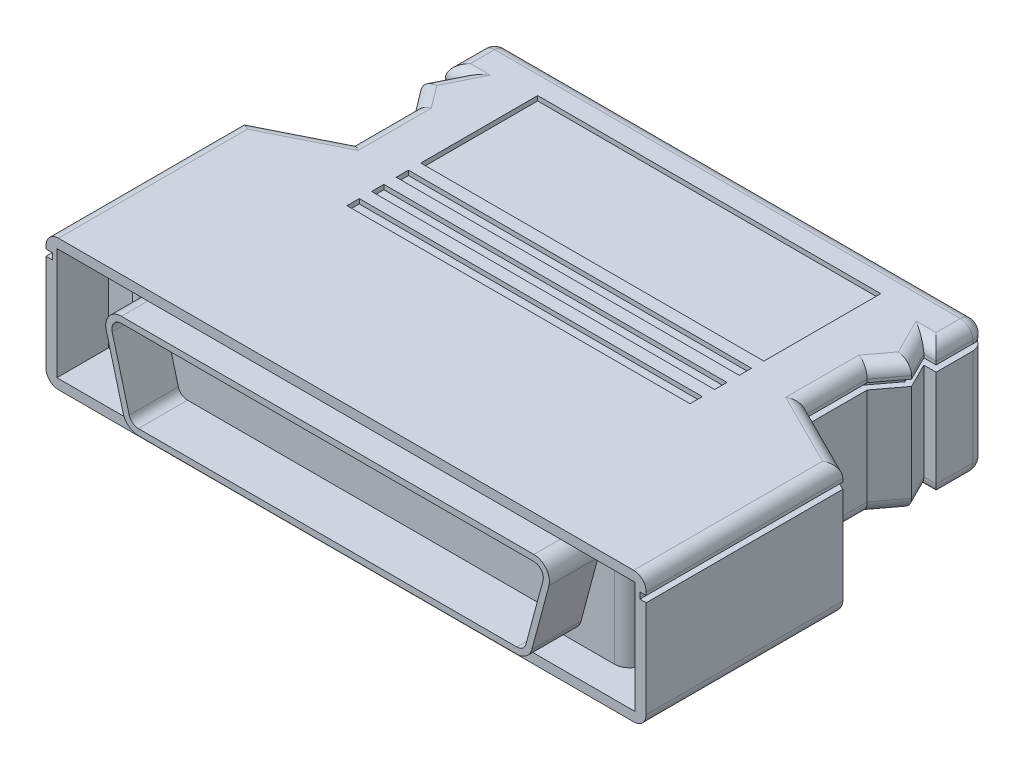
ISO-10303-21;
HEADER;
FILE_DESCRIPTION(('STEP AP214'),'2;1');
FILE_NAME('part.step','',(''),(''),'','','');
FILE_SCHEMA(('AUTOMOTIVE_DESIGN { 1 0 10303 214 1 1 1 1 }'));
ENDSEC;
DATA;
#1=APPLICATION_CONTEXT('core data for automotive mechanical design processes');
#2=APPLICATION_PROTOCOL_DEFINITION('international standard','automotive_design',2000,#1);
#3=PRODUCT_CONTEXT('',#1,'mechanical');
#4=PRODUCT('Part','Part','',(#3));
#5=PRODUCT_RELATED_PRODUCT_CATEGORY('part','',(#4));
#6=PRODUCT_DEFINITION_FORMATION('','',#4);
#7=PRODUCT_DEFINITION_CONTEXT('part definition',#1,'design');
#8=PRODUCT_DEFINITION('design','',#6,#7);
#9=PRODUCT_DEFINITION_SHAPE('','',#8);
#10=(LENGTH_UNIT() NAMED_UNIT(*) SI_UNIT(.MILLI.,.METRE.));
#11=(NAMED_UNIT(*) PLANE_ANGLE_UNIT() SI_UNIT($,.RADIAN.));
#12=(NAMED_UNIT(*) SI_UNIT($,.STERADIAN.) SOLID_ANGLE_UNIT());
#13=UNCERTAINTY_MEASURE_WITH_UNIT(LENGTH_MEASURE(1.E-05),#10,'distance_accuracy_value','');
#14=(GEOMETRIC_REPRESENTATION_CONTEXT(3) GLOBAL_UNCERTAINTY_ASSIGNED_CONTEXT((#13)) GLOBAL_UNIT_ASSIGNED_CONTEXT((#10,
#11,#12)) REPRESENTATION_CONTEXT('',''));
#15=CARTESIAN_POINT('',(0.,0.,0.));
#16=DIRECTION('',(0.,0.,1.));
#17=DIRECTION('',(1.,0.,0.));
#18=AXIS2_PLACEMENT_3D('',#15,#16,#17);
#19=CARTESIAN_POINT('',(-20.574,4.5466,-2.4892));
#20=DIRECTION('',(0.,0.,-1.));
#21=DIRECTION('',(-1.,0.,0.));
#22=AXIS2_PLACEMENT_3D('',#19,#20,#21);
#23=PLANE('',#22);
#24=DIRECTION('',(-1.,0.,0.));
#25=VECTOR('',#24,1.);
#26=CARTESIAN_POINT('',(-20.574,4.5466,-2.4892));
#27=LINE('',#26,#25);
#28=CARTESIAN_POINT('',(19.304,4.5466,-2.4892));
#29=VERTEX_POINT('',#28);
#30=CARTESIAN_POINT('',(-19.304,4.5466,-2.4892));
#31=VERTEX_POINT('',#30);
#32=EDGE_CURVE('E1050',#29,#31,#27,.T.);
#33=ORIENTED_EDGE('',*,*,#32,.T.);
#34=DIRECTION('',(0.,-1.,0.));
#35=VECTOR('',#34,1.);
#36=CARTESIAN_POINT('',(-19.304,4.5466,-2.4892));
#37=LINE('',#36,#35);
#38=CARTESIAN_POINT('',(-19.304,-4.5466,-2.4892));
#39=VERTEX_POINT('',#38);
#40=EDGE_CURVE('E1615',#31,#39,#37,.T.);
#41=ORIENTED_EDGE('',*,*,#40,.T.);
#42=DIRECTION('',(1.,0.,0.));
#43=VECTOR('',#42,1.);
#44=CARTESIAN_POINT('',(-20.574,-4.5466,-2.4892));
#45=LINE('',#44,#43);
#46=CARTESIAN_POINT('',(19.304,-4.5466,-2.4892));
#47=VERTEX_POINT('',#46);
#48=EDGE_CURVE('E1047',#39,#47,#45,.T.);
#49=ORIENTED_EDGE('',*,*,#48,.T.);
#50=DIRECTION('',(0.,1.,0.));
#51=VECTOR('',#50,1.);
#52=CARTESIAN_POINT('',(19.304,4.5466,-2.4892));
#53=LINE('',#52,#51);
#54=EDGE_CURVE('E1612',#47,#29,#53,.T.);
#55=ORIENTED_EDGE('',*,*,#54,.T.);
#56=EDGE_LOOP('',(#33,#41,#49,#55));
#57=FACE_BOUND('',#56,.T.);
#58=CARTESIAN_POINT('',(-16.7599313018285,2.62671672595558,-2.4892));
#59=DIRECTION('',(0.,0.,1.));
#60=DIRECTION('',(-1.,0.,0.));
#61=AXIS2_PLACEMENT_3D('',#58,#59,#60);
#62=CIRCLE('',#61,1.27);
#63=CARTESIAN_POINT('',(-16.7600101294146,3.89671672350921,-2.4892));
#64=VERTEX_POINT('',#63);
#65=CARTESIAN_POINT('',(-17.9866571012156,2.29801653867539,-2.4892));
#66=VERTEX_POINT('',#65);
#67=EDGE_CURVE('E981',#64,#66,#62,.T.);
#68=ORIENTED_EDGE('',*,*,#67,.F.);
#69=DIRECTION('',(-0.999999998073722,-6.20689653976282E-05,0.));
#70=VECTOR('',#69,1.);
#71=CARTESIAN_POINT('',(-16.7600101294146,3.89671672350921,-2.4892));
#72=LINE('',#71,#70);
#73=CARTESIAN_POINT('',(16.7597974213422,3.89879726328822,-2.4892));
#74=VERTEX_POINT('',#73);
#75=EDGE_CURVE('E986',#74,#64,#72,.T.);
#76=ORIENTED_EDGE('',*,*,#75,.F.);
#77=CARTESIAN_POINT('',(16.7598762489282,2.62879726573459,-2.4892));
#78=DIRECTION('',(0.,0.,1.));
#79=DIRECTION('',(-1.,0.,0.));
#80=AXIS2_PLACEMENT_3D('',#77,#78,#79);
#81=CIRCLE('',#80,1.27);
#82=CARTESIAN_POINT('',(17.9866020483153,2.30009707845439,-2.4892));
#83=VERTEX_POINT('',#82);
#84=EDGE_CURVE('E1018',#83,#74,#81,.T.);
#85=ORIENTED_EDGE('',*,*,#84,.F.);
#86=DIRECTION('',(0.258819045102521,0.965925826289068,0.));
#87=VECTOR('',#86,1.);
#88=CARTESIAN_POINT('',(17.9866020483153,2.30009707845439,-2.4892));
#89=LINE('',#88,#87);
#90=CARTESIAN_POINT('',(16.6018827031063,-2.86774587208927,-2.4892));
#91=VERTEX_POINT('',#90);
#92=EDGE_CURVE('E1015',#91,#83,#89,.T.);
#93=ORIENTED_EDGE('',*,*,#92,.F.);
#94=CARTESIAN_POINT('',(15.3751569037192,-2.53904568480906,-2.4892));
#95=DIRECTION('',(0.,0.,1.));
#96=DIRECTION('',(-1.,0.,0.));
#97=AXIS2_PLACEMENT_3D('',#94,#95,#96);
#98=CIRCLE('',#97,1.27);
#99=CARTESIAN_POINT('',(15.3752357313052,-3.80904568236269,-2.4892));
#100=VERTEX_POINT('',#99);
#101=EDGE_CURVE('E1012',#100,#91,#98,.T.);
#102=ORIENTED_EDGE('',*,*,#101,.F.);
#103=DIRECTION('',(0.999999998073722,6.2068965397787E-05,0.));
#104=VECTOR('',#103,1.);
#105=CARTESIAN_POINT('',(15.3752357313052,-3.80904568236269,-2.4892));
#106=LINE('',#105,#104);
#107=CARTESIAN_POINT('',(-15.3751791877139,-3.81095432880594,-2.4892));
#108=VERTEX_POINT('',#107);
#109=EDGE_CURVE('E1009',#108,#100,#106,.T.);
#110=ORIENTED_EDGE('',*,*,#109,.F.);
#111=CARTESIAN_POINT('',(-15.3752580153,-2.54095433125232,-2.4892));
#112=DIRECTION('',(0.,0.,1.));
#113=DIRECTION('',(1.,0.,0.));
#114=AXIS2_PLACEMENT_3D('',#111,#112,#113);
#115=CIRCLE('',#114,1.27);
#116=CARTESIAN_POINT('',(-16.6019838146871,-2.86965451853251,-2.4892));
#117=VERTEX_POINT('',#116);
#118=EDGE_CURVE('E1006',#117,#108,#115,.T.);
#119=ORIENTED_EDGE('',*,*,#118,.F.);
#120=DIRECTION('',(0.258819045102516,-0.96592582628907,0.));
#121=VECTOR('',#120,1.);
#122=CARTESIAN_POINT('',(-16.6019838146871,-2.86965451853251,-2.4892));
#123=LINE('',#122,#121);
#124=EDGE_CURVE('E1003',#66,#117,#123,.T.);
#125=ORIENTED_EDGE('',*,*,#124,.F.);
#126=EDGE_LOOP('',(#68,#76,#85,#93,#102,#110,#119,#125));
#127=FACE_BOUND('',#126,.T.);
#128=ADVANCED_FACE('F98',(#57,#127),#23,.F.);
#129=CARTESIAN_POINT('',(-23.495,4.5466,-4.191));
#130=DIRECTION('',(0.,1.,0.));
#131=DIRECTION('',(0.,0.,1.));
#132=AXIS2_PLACEMENT_3D('',#129,#130,#131);
#133=PLANE('',#132);
#134=DIRECTION('',(0.,0.,-1.));
#135=VECTOR('',#134,1.);
#136=CARTESIAN_POINT('',(-20.574,4.5466,-2.4892));
#137=LINE('',#136,#135);
#138=CARTESIAN_POINT('',(-20.574,4.5466,-3.7592));
#139=VERTEX_POINT('',#138);
#140=CARTESIAN_POINT('',(-20.574,4.5466,-4.191));
#141=VERTEX_POINT('',#140);
#142=EDGE_CURVE('E1054',#139,#141,#137,.T.);
#143=ORIENTED_EDGE('',*,*,#142,.F.);
#144=CARTESIAN_POINT('',(-19.304,4.5466,-3.7592));
#145=DIRECTION('',(0.,1.,0.));
#146=DIRECTION('',(0.,0.,1.));
#147=AXIS2_PLACEMENT_3D('',#144,#145,#146);
#148=CIRCLE('',#147,1.27);
#149=EDGE_CURVE('E1624',#139,#31,#148,.T.);
#150=ORIENTED_EDGE('',*,*,#149,.T.);
#151=ORIENTED_EDGE('',*,*,#32,.F.);
#152=CARTESIAN_POINT('',(19.304,4.5466,-3.7592));
#153=DIRECTION('',(0.,1.,0.));
#154=DIRECTION('',(0.,0.,1.));
#155=AXIS2_PLACEMENT_3D('',#152,#153,#154);
#156=CIRCLE('',#155,1.27);
#157=CARTESIAN_POINT('',(20.574,4.5466,-3.7592));
#158=VERTEX_POINT('',#157);
#159=EDGE_CURVE('E1626',#29,#158,#156,.T.);
#160=ORIENTED_EDGE('',*,*,#159,.T.);
#161=DIRECTION('',(0.,0.,-1.));
#162=VECTOR('',#161,1.);
#163=CARTESIAN_POINT('',(20.574,4.5466,-2.4892));
#164=LINE('',#163,#162);
#165=CARTESIAN_POINT('',(20.574,4.5466,-4.191));
#166=VERTEX_POINT('',#165);
#167=EDGE_CURVE('E1060',#158,#166,#164,.T.);
#168=ORIENTED_EDGE('',*,*,#167,.T.);
#169=DIRECTION('',(-1.,0.,0.));
#170=VECTOR('',#169,1.);
#171=CARTESIAN_POINT('',(-23.495,4.5466,-4.191));
#172=LINE('',#171,#170);
#173=CARTESIAN_POINT('',(23.495,4.5466,-4.191));
#174=VERTEX_POINT('',#173);
#175=EDGE_CURVE('E1079',#174,#166,#172,.T.);
#176=ORIENTED_EDGE('',*,*,#175,.F.);
#177=DIRECTION('',(0.,0.,1.));
#178=VECTOR('',#177,1.);
#179=CARTESIAN_POINT('',(23.495,4.5466,-4.191));
#180=LINE('',#179,#178);
#181=CARTESIAN_POINT('',(23.495,4.5466,0.));
#182=VERTEX_POINT('',#181);
#183=EDGE_CURVE('E1095',#174,#182,#180,.T.);
#184=ORIENTED_EDGE('',*,*,#183,.T.);
#185=DIRECTION('',(-1.,0.,0.));
#186=VECTOR('',#185,1.);
#187=CARTESIAN_POINT('',(-23.495,4.5466,0.));
#188=LINE('',#187,#186);
#189=CARTESIAN_POINT('',(-23.495,4.5466,0.));
#190=VERTEX_POINT('',#189);
#191=EDGE_CURVE('E1071',#182,#190,#188,.T.);
#192=ORIENTED_EDGE('',*,*,#191,.T.);
#193=DIRECTION('',(0.,0.,1.));
#194=VECTOR('',#193,1.);
#195=CARTESIAN_POINT('',(-23.495,4.5466,-4.191));
#196=LINE('',#195,#194);
#197=CARTESIAN_POINT('',(-23.495,4.5466,-4.191));
#198=VERTEX_POINT('',#197);
#199=EDGE_CURVE('E1092',#198,#190,#196,.T.);
#200=ORIENTED_EDGE('',*,*,#199,.F.);
#201=EDGE_CURVE('E1078',#141,#198,#172,.T.);
#202=ORIENTED_EDGE('',*,*,#201,.F.);
#203=EDGE_LOOP('',(#143,#150,#151,#160,#168,#176,#184,#192,#200,#202));
#204=FACE_BOUND('',#203,.T.);
#205=ADVANCED_FACE('F2044',(#204),#133,.F.);
#206=CARTESIAN_POINT('',(-23.495,-4.5466,-4.191));
#207=DIRECTION('',(0.,-1.,0.));
#208=DIRECTION('',(0.,0.,-1.));
#209=AXIS2_PLACEMENT_3D('',#206,#207,#208);
#210=PLANE('',#209);
#211=ORIENTED_EDGE('',*,*,#48,.F.);
#212=CARTESIAN_POINT('',(-19.304,-4.5466,-3.7592));
#213=DIRECTION('',(0.,-1.,0.));
#214=DIRECTION('',(0.,0.,-1.));
#215=AXIS2_PLACEMENT_3D('',#212,#213,#214);
#216=CIRCLE('',#215,1.27);
#217=CARTESIAN_POINT('',(-20.574,-4.5466,-3.7592));
#218=VERTEX_POINT('',#217);
#219=EDGE_CURVE('E1622',#39,#218,#216,.T.);
#220=ORIENTED_EDGE('',*,*,#219,.T.);
#221=DIRECTION('',(0.,0.,-1.));
#222=VECTOR('',#221,1.);
#223=CARTESIAN_POINT('',(-20.574,-4.5466,-2.4892));
#224=LINE('',#223,#222);
#225=CARTESIAN_POINT('',(-20.574,-4.5466,-4.191));
#226=VERTEX_POINT('',#225);
#227=EDGE_CURVE('E1064',#218,#226,#224,.T.);
#228=ORIENTED_EDGE('',*,*,#227,.T.);
#229=DIRECTION('',(1.,0.,0.));
#230=VECTOR('',#229,1.);
#231=CARTESIAN_POINT('',(-23.495,-4.5466,-4.191));
#232=LINE('',#231,#230);
#233=CARTESIAN_POINT('',(-23.495,-4.5466,-4.191));
#234=VERTEX_POINT('',#233);
#235=EDGE_CURVE('E1072',#234,#226,#232,.T.);
#236=ORIENTED_EDGE('',*,*,#235,.F.);
#237=DIRECTION('',(0.,0.,1.));
#238=VECTOR('',#237,1.);
#239=CARTESIAN_POINT('',(-23.495,-4.5466,-4.191));
#240=LINE('',#239,#238);
#241=CARTESIAN_POINT('',(-23.495,-4.5466,0.));
#242=VERTEX_POINT('',#241);
#243=EDGE_CURVE('E1082',#234,#242,#240,.T.);
#244=ORIENTED_EDGE('',*,*,#243,.T.);
#245=DIRECTION('',(1.,0.,0.));
#246=VECTOR('',#245,1.);
#247=CARTESIAN_POINT('',(-23.495,-4.5466,0.));
#248=LINE('',#247,#246);
#249=CARTESIAN_POINT('',(23.495,-4.5466,0.));
#250=VERTEX_POINT('',#249);
#251=EDGE_CURVE('E1084',#242,#250,#248,.T.);
#252=ORIENTED_EDGE('',*,*,#251,.T.);
#253=DIRECTION('',(0.,0.,1.));
#254=VECTOR('',#253,1.);
#255=CARTESIAN_POINT('',(23.495,-4.5466,-4.191));
#256=LINE('',#255,#254);
#257=CARTESIAN_POINT('',(23.495,-4.5466,-4.191));
#258=VERTEX_POINT('',#257);
#259=EDGE_CURVE('E1097',#258,#250,#256,.T.);
#260=ORIENTED_EDGE('',*,*,#259,.F.);
#261=CARTESIAN_POINT('',(20.574,-4.5466,-4.191));
#262=VERTEX_POINT('',#261);
#263=EDGE_CURVE('E1070',#262,#258,#232,.T.);
#264=ORIENTED_EDGE('',*,*,#263,.F.);
#265=DIRECTION('',(0.,0.,-1.));
#266=VECTOR('',#265,1.);
#267=CARTESIAN_POINT('',(20.574,-4.5466,-2.4892));
#268=LINE('',#267,#266);
#269=CARTESIAN_POINT('',(20.574,-4.5466,-3.7592));
#270=VERTEX_POINT('',#269);
#271=EDGE_CURVE('E1062',#270,#262,#268,.T.);
#272=ORIENTED_EDGE('',*,*,#271,.F.);
#273=CARTESIAN_POINT('',(19.304,-4.5466,-3.7592));
#274=DIRECTION('',(0.,-1.,0.));
#275=DIRECTION('',(0.,0.,-1.));
#276=AXIS2_PLACEMENT_3D('',#273,#274,#275);
#277=CIRCLE('',#276,1.27);
#278=EDGE_CURVE('E1628',#270,#47,#277,.T.);
#279=ORIENTED_EDGE('',*,*,#278,.T.);
#280=EDGE_LOOP('',(#211,#220,#228,#236,#244,#252,#260,#264,#272,#279));
#281=FACE_BOUND('',#280,.T.);
#282=ADVANCED_FACE('F2051',(#281),#210,.F.);
#283=CARTESIAN_POINT('',(-23.495,4.5466,-4.191));
#284=DIRECTION('',(0.,0.,-1.));
#285=DIRECTION('',(-1.,0.,0.));
#286=AXIS2_PLACEMENT_3D('',#283,#284,#285);
#287=PLANE('',#286);
#288=DIRECTION('',(0.,-1.,0.));
#289=VECTOR('',#288,1.);
#290=CARTESIAN_POINT('',(-20.574,-4.5466,-4.191));
#291=LINE('',#290,#289);
#292=EDGE_CURVE('E1046',#141,#226,#291,.T.);
#293=ORIENTED_EDGE('',*,*,#292,.F.);
#294=ORIENTED_EDGE('',*,*,#201,.T.);
#295=DIRECTION('',(0.,-1.,0.));
#296=VECTOR('',#295,1.);
#297=CARTESIAN_POINT('',(-23.495,-4.5466,-4.191));
#298=LINE('',#297,#296);
#299=EDGE_CURVE('E1067',#198,#234,#298,.T.);
#300=ORIENTED_EDGE('',*,*,#299,.T.);
#301=ORIENTED_EDGE('',*,*,#235,.T.);
#302=EDGE_LOOP('',(#293,#294,#300,#301));
#303=FACE_BOUND('',#302,.T.);
#304=ADVANCED_FACE('F3595',(#303),#287,.F.);
#305=DIRECTION('',(0.,1.,0.));
#306=VECTOR('',#305,1.);
#307=CARTESIAN_POINT('',(20.574,-4.5466,-4.191));
#308=LINE('',#307,#306);
#309=EDGE_CURVE('E1051',#262,#166,#308,.T.);
#310=ORIENTED_EDGE('',*,*,#309,.F.);
#311=ORIENTED_EDGE('',*,*,#263,.T.);
#312=DIRECTION('',(0.,1.,0.));
#313=VECTOR('',#312,1.);
#314=CARTESIAN_POINT('',(23.495,-4.5466,-4.191));
#315=LINE('',#314,#313);
#316=EDGE_CURVE('E1075',#258,#174,#315,.T.);
#317=ORIENTED_EDGE('',*,*,#316,.T.);
#318=ORIENTED_EDGE('',*,*,#175,.T.);
#319=EDGE_LOOP('',(#310,#311,#317,#318));
#320=FACE_BOUND('',#319,.T.);
#321=ADVANCED_FACE('F2255',(#320),#287,.F.);
#322=CARTESIAN_POINT('',(-24.384,-5.334,0.));
#323=DIRECTION('',(0.,-1.,0.));
#324=DIRECTION('',(0.,0.,-1.));
#325=AXIS2_PLACEMENT_3D('',#322,#323,#324);
#326=PLANE('',#325);
#327=DIRECTION('',(-1.,0.,0.));
#328=VECTOR('',#327,1.);
#329=CARTESIAN_POINT('',(-13.939012,-5.334,-17.009872));
#330=LINE('',#329,#328);
#331=CARTESIAN_POINT('',(13.939012,-5.334,-17.009872));
#332=VERTEX_POINT('',#331);
#333=CARTESIAN_POINT('',(-13.939012,-5.334,-17.009872));
#334=VERTEX_POINT('',#333);
#335=EDGE_CURVE('E1145',#332,#334,#330,.T.);
#336=ORIENTED_EDGE('',*,*,#335,.T.);
#337=DIRECTION('',(0.,0.,1.));
#338=VECTOR('',#337,1.);
#339=CARTESIAN_POINT('',(-13.939012,-5.334,-17.009872));
#340=LINE('',#339,#338);
#341=CARTESIAN_POINT('',(-13.939012,-5.334,-16.00976224));
#342=VERTEX_POINT('',#341);
#343=EDGE_CURVE('E1125',#334,#342,#340,.T.);
#344=ORIENTED_EDGE('',*,*,#343,.T.);
#345=DIRECTION('',(1.,0.,0.));
#346=VECTOR('',#345,1.);
#347=CARTESIAN_POINT('',(-13.939012,-5.334,-16.00976224));
#348=LINE('',#347,#346);
#349=CARTESIAN_POINT('',(13.939012,-5.334,-16.00976224));
#350=VERTEX_POINT('',#349);
#351=EDGE_CURVE('E1136',#342,#350,#348,.T.);
#352=ORIENTED_EDGE('',*,*,#351,.T.);
#353=DIRECTION('',(0.,0.,-1.));
#354=VECTOR('',#353,1.);
#355=CARTESIAN_POINT('',(13.939012,-5.334,-17.009872));
#356=LINE('',#355,#354);
#357=EDGE_CURVE('E1148',#350,#332,#356,.T.);
#358=ORIENTED_EDGE('',*,*,#357,.T.);
#359=EDGE_LOOP('',(#336,#344,#352,#358));
#360=FACE_BOUND('',#359,.T.);
#361=DIRECTION('',(-1.,0.,0.));
#362=VECTOR('',#361,1.);
#363=CARTESIAN_POINT('',(-13.939012,-5.334,-29.505656));
#364=LINE('',#363,#362);
#365=CARTESIAN_POINT('',(13.939012,-5.334,-29.505656));
#366=VERTEX_POINT('',#365);
#367=CARTESIAN_POINT('',(-13.939012,-5.334,-29.505656));
#368=VERTEX_POINT('',#367);
#369=EDGE_CURVE('E1207',#366,#368,#364,.T.);
#370=ORIENTED_EDGE('',*,*,#369,.T.);
#371=DIRECTION('',(0.,0.,1.));
#372=VECTOR('',#371,1.);
#373=CARTESIAN_POINT('',(-13.939012,-5.334,-29.505656));
#374=LINE('',#373,#372);
#375=CARTESIAN_POINT('',(-13.939012,-5.334,-20.008596));
#376=VERTEX_POINT('',#375);
#377=EDGE_CURVE('E1187',#368,#376,#374,.T.);
#378=ORIENTED_EDGE('',*,*,#377,.T.);
#379=DIRECTION('',(1.,0.,0.));
#380=VECTOR('',#379,1.);
#381=CARTESIAN_POINT('',(-13.939012,-5.334,-20.008596));
#382=LINE('',#381,#380);
#383=CARTESIAN_POINT('',(13.939012,-5.334,-20.008596));
#384=VERTEX_POINT('',#383);
#385=EDGE_CURVE('E1198',#376,#384,#382,.T.);
#386=ORIENTED_EDGE('',*,*,#385,.T.);
#387=DIRECTION('',(0.,0.,-1.));
#388=VECTOR('',#387,1.);
#389=CARTESIAN_POINT('',(13.939012,-5.334,-29.505656));
#390=LINE('',#389,#388);
#391=EDGE_CURVE('E1210',#384,#366,#390,.T.);
#392=ORIENTED_EDGE('',*,*,#391,.T.);
#393=EDGE_LOOP('',(#370,#378,#386,#392));
#394=FACE_BOUND('',#393,.T.);
#395=DIRECTION('',(-0.894275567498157,0.,-0.44751671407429));
#396=VECTOR('',#395,1.);
#397=CARTESIAN_POINT('',(23.9293230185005,-5.334,-15.0680160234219));
#398=LINE('',#397,#396);
#399=CARTESIAN_POINT('',(17.3736,-5.334,-18.3486553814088));
#400=VERTEX_POINT('',#399);
#401=CARTESIAN_POINT('',(23.368,-5.334,-15.3489153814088));
#402=VERTEX_POINT('',#401);
#403=EDGE_CURVE('E1659',#400,#402,#398,.F.);
#404=ORIENTED_EDGE('',*,*,#403,.T.);
#405=DIRECTION('',(0.,0.,-1.));
#406=VECTOR('',#405,1.);
#407=CARTESIAN_POINT('',(23.368,-5.334,0.));
#408=LINE('',#407,#406);
#409=CARTESIAN_POINT('',(23.368,-5.334,0.));
#410=VERTEX_POINT('',#409);
#411=EDGE_CURVE('E1661',#402,#410,#408,.F.);
#412=ORIENTED_EDGE('',*,*,#411,.T.);
#413=DIRECTION('',(1.,0.,0.));
#414=VECTOR('',#413,1.);
#415=CARTESIAN_POINT('',(-24.384,-5.334,0.));
#416=LINE('',#415,#414);
#417=CARTESIAN_POINT('',(-23.368,-5.334,0.));
#418=VERTEX_POINT('',#417);
#419=EDGE_CURVE('E1564',#418,#410,#416,.T.);
#420=ORIENTED_EDGE('',*,*,#419,.F.);
#421=DIRECTION('',(0.,0.,1.));
#422=VECTOR('',#421,1.);
#423=CARTESIAN_POINT('',(-23.368,-5.334,-15.9766));
#424=LINE('',#423,#422);
#425=CARTESIAN_POINT('',(-23.368,-5.334,-15.3489153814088));
#426=VERTEX_POINT('',#425);
#427=EDGE_CURVE('E1633',#418,#426,#424,.F.);
#428=ORIENTED_EDGE('',*,*,#427,.T.);
#429=DIRECTION('',(-0.894275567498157,0.,0.447516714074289));
#430=VECTOR('',#429,1.);
#431=CARTESIAN_POINT('',(-17.9349230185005,-5.334,-18.0677560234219));
#432=LINE('',#431,#430);
#433=CARTESIAN_POINT('',(-17.3736,-5.334,-18.3486553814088));
#434=VERTEX_POINT('',#433);
#435=EDGE_CURVE('E1635',#426,#434,#432,.F.);
#436=ORIENTED_EDGE('',*,*,#435,.T.);
#437=DIRECTION('',(0.,0.,1.));
#438=VECTOR('',#437,1.);
#439=CARTESIAN_POINT('',(-17.3736,-5.334,-23.95474));
#440=LINE('',#439,#438);
#441=CARTESIAN_POINT('',(-17.3736,-5.334,-24.2948557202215));
#442=VERTEX_POINT('',#441);
#443=EDGE_CURVE('E1637',#434,#442,#440,.F.);
#444=ORIENTED_EDGE('',*,*,#443,.T.);
#445=DIRECTION('',(0.602050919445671,0.,0.798457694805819));
#446=VECTOR('',#445,1.);
#447=CARTESIAN_POINT('',(-19.1277669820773,-5.334,-26.6212837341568));
#448=LINE('',#447,#446);
#449=CARTESIAN_POINT('',(-18.7486401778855,-5.334,-26.1184745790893));
#450=VERTEX_POINT('',#449);
#451=EDGE_CURVE('E1639',#442,#450,#448,.F.);
#452=ORIENTED_EDGE('',*,*,#451,.T.);
#453=DIRECTION('',(-0.447213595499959,0.,0.894427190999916));
#454=VECTOR('',#453,1.);
#455=CARTESIAN_POINT('',(-18.0320419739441,-5.334,-27.551670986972));
#456=LINE('',#455,#454);
#457=CARTESIAN_POINT('',(-17.2968574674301,-5.334,-29.02204));
#458=VERTEX_POINT('',#457);
#459=EDGE_CURVE('E1641',#450,#458,#456,.F.);
#460=ORIENTED_EDGE('',*,*,#459,.T.);
#461=DIRECTION('',(1.,0.,0.));
#462=VECTOR('',#461,1.);
#463=CARTESIAN_POINT('',(-19.939,-5.334,-29.02204));
#464=LINE('',#463,#462);
#465=CARTESIAN_POINT('',(-18.923,-5.334,-29.02204));
#466=VERTEX_POINT('',#465);
#467=EDGE_CURVE('E1643',#458,#466,#464,.F.);
#468=ORIENTED_EDGE('',*,*,#467,.T.);
#469=DIRECTION('',(0.,0.,1.));
#470=VECTOR('',#469,1.);
#471=CARTESIAN_POINT('',(-18.923,-5.334,-32.004));
#472=LINE('',#471,#470);
#473=CARTESIAN_POINT('',(-18.923,-5.334,-30.988));
#474=VERTEX_POINT('',#473);
#475=EDGE_CURVE('E1645',#466,#474,#472,.F.);
#476=ORIENTED_EDGE('',*,*,#475,.T.);
#477=DIRECTION('',(-1.,0.,0.));
#478=VECTOR('',#477,1.);
#479=CARTESIAN_POINT('',(19.939,-5.334,-30.988));
#480=LINE('',#479,#478);
#481=CARTESIAN_POINT('',(18.923,-5.334,-30.988));
#482=VERTEX_POINT('',#481);
#483=EDGE_CURVE('E1647',#474,#482,#480,.F.);
#484=ORIENTED_EDGE('',*,*,#483,.T.);
#485=DIRECTION('',(0.,0.,-1.));
#486=VECTOR('',#485,1.);
#487=CARTESIAN_POINT('',(18.923,-5.334,-28.00604));
#488=LINE('',#487,#486);
#489=CARTESIAN_POINT('',(18.923,-5.334,-29.02204));
#490=VERTEX_POINT('',#489);
#491=EDGE_CURVE('E1649',#482,#490,#488,.F.);
#492=ORIENTED_EDGE('',*,*,#491,.T.);
#493=DIRECTION('',(1.,0.,0.));
#494=VECTOR('',#493,1.);
#495=CARTESIAN_POINT('',(18.94078,-5.334,-29.02204));
#496=LINE('',#495,#494);
#497=CARTESIAN_POINT('',(17.2968574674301,-5.334,-29.02204));
#498=VERTEX_POINT('',#497);
#499=EDGE_CURVE('E1651',#490,#498,#496,.F.);
#500=ORIENTED_EDGE('',*,*,#499,.T.);
#501=DIRECTION('',(-0.447213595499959,0.,-0.894427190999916));
#502=VECTOR('',#501,1.);
#503=CARTESIAN_POINT('',(19.0302619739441,-5.334,-25.555230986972));
#504=LINE('',#503,#502);
#505=CARTESIAN_POINT('',(18.7486401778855,-5.334,-26.1184745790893));
#506=VERTEX_POINT('',#505);
#507=EDGE_CURVE('E1653',#498,#506,#504,.F.);
#508=ORIENTED_EDGE('',*,*,#507,.T.);
#509=DIRECTION('',(0.602050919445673,0.,-0.798457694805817));
#510=VECTOR('',#509,1.);
#511=CARTESIAN_POINT('',(17.5783669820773,-5.334,-24.5664237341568));
#512=LINE('',#511,#510);
#513=CARTESIAN_POINT('',(17.3736,-5.334,-24.2948557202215));
#514=VERTEX_POINT('',#513);
#515=EDGE_CURVE('E1655',#506,#514,#512,.F.);
#516=ORIENTED_EDGE('',*,*,#515,.T.);
#517=DIRECTION('',(0.,0.,-1.));
#518=VECTOR('',#517,1.);
#519=CARTESIAN_POINT('',(17.3736,-5.334,-18.97634));
#520=LINE('',#519,#518);
#521=EDGE_CURVE('E1657',#514,#400,#520,.F.);
#522=ORIENTED_EDGE('',*,*,#521,.T.);
#523=EDGE_LOOP('',(#404,#412,#420,#428,#436,#444,#452,#460,#468,#476,#484,#492,#500,#508,#516,#522));
#524=FACE_BOUND('',#523,.T.);
#525=DIRECTION('',(-1.,0.,0.));
#526=VECTOR('',#525,1.);
#527=CARTESIAN_POINT('',(-13.939012,-5.334,-19.008852));
#528=LINE('',#527,#526);
#529=CARTESIAN_POINT('',(13.939012,-5.334,-19.008852));
#530=VERTEX_POINT('',#529);
#531=CARTESIAN_POINT('',(-13.939012,-5.334,-19.008852));
#532=VERTEX_POINT('',#531);
#533=EDGE_CURVE('E1176',#530,#532,#528,.T.);
#534=ORIENTED_EDGE('',*,*,#533,.T.);
#535=DIRECTION('',(0.,0.,1.));
#536=VECTOR('',#535,1.);
#537=CARTESIAN_POINT('',(-13.939012,-5.334,-19.008852));
#538=LINE('',#537,#536);
#539=CARTESIAN_POINT('',(-13.939012,-5.334,-18.009616));
#540=VERTEX_POINT('',#539);
#541=EDGE_CURVE('E1156',#532,#540,#538,.T.);
#542=ORIENTED_EDGE('',*,*,#541,.T.);
#543=DIRECTION('',(1.,0.,0.));
#544=VECTOR('',#543,1.);
#545=CARTESIAN_POINT('',(-13.939012,-5.334,-18.009616));
#546=LINE('',#545,#544);
#547=CARTESIAN_POINT('',(13.939012,-5.334,-18.009616));
#548=VERTEX_POINT('',#547);
#549=EDGE_CURVE('E1167',#540,#548,#546,.T.);
#550=ORIENTED_EDGE('',*,*,#549,.T.);
#551=DIRECTION('',(0.,0.,-1.));
#552=VECTOR('',#551,1.);
#553=CARTESIAN_POINT('',(13.939012,-5.334,-19.008852));
#554=LINE('',#553,#552);
#555=EDGE_CURVE('E1179',#548,#530,#554,.T.);
#556=ORIENTED_EDGE('',*,*,#555,.T.);
#557=EDGE_LOOP('',(#534,#542,#550,#556));
#558=FACE_BOUND('',#557,.T.);
#559=DIRECTION('',(-1.,0.,0.));
#560=VECTOR('',#559,1.);
#561=CARTESIAN_POINT('',(-13.939012,-5.334,-15.01001824));
#562=LINE('',#561,#560);
#563=CARTESIAN_POINT('',(13.939012,-5.334,-15.01001824));
#564=VERTEX_POINT('',#563);
#565=CARTESIAN_POINT('',(-13.939012,-5.334,-15.01001824));
#566=VERTEX_POINT('',#565);
#567=EDGE_CURVE('E1114',#564,#566,#562,.T.);
#568=ORIENTED_EDGE('',*,*,#567,.T.);
#569=DIRECTION('',(0.,0.,1.));
#570=VECTOR('',#569,1.);
#571=CARTESIAN_POINT('',(-13.939012,-5.334,-15.01001824));
#572=LINE('',#571,#570);
#573=CARTESIAN_POINT('',(-13.939012,-5.334,-14.01078224));
#574=VERTEX_POINT('',#573);
#575=EDGE_CURVE('E1094',#566,#574,#572,.T.);
#576=ORIENTED_EDGE('',*,*,#575,.T.);
#577=DIRECTION('',(1.,0.,0.));
#578=VECTOR('',#577,1.);
#579=CARTESIAN_POINT('',(-13.939012,-5.334,-14.01078224));
#580=LINE('',#579,#578);
#581=CARTESIAN_POINT('',(13.939012,-5.334,-14.01078224));
#582=VERTEX_POINT('',#581);
#583=EDGE_CURVE('E1105',#574,#582,#580,.T.);
#584=ORIENTED_EDGE('',*,*,#583,.T.);
#585=DIRECTION('',(0.,0.,-1.));
#586=VECTOR('',#585,1.);
#587=CARTESIAN_POINT('',(13.939012,-5.334,-15.01001824));
#588=LINE('',#587,#586);
#589=EDGE_CURVE('E1117',#582,#564,#588,.T.);
#590=ORIENTED_EDGE('',*,*,#589,.T.);
#591=EDGE_LOOP('',(#568,#576,#584,#590));
#592=FACE_BOUND('',#591,.T.);
#593=ADVANCED_FACE('F2250',(#360,#394,#524,#558,#592),#326,.T.);
#594=CARTESIAN_POINT('',(-24.384,5.334,0.));
#595=DIRECTION('',(0.,0.,-1.));
#596=DIRECTION('',(-1.,0.,0.));
#597=AXIS2_PLACEMENT_3D('',#594,#595,#596);
#598=PLANE('',#597);
#599=ORIENTED_EDGE('',*,*,#251,.F.);
#600=DIRECTION('',(0.,-1.,0.));
#601=VECTOR('',#600,1.);
#602=CARTESIAN_POINT('',(-23.495,-4.5466,0.));
#603=LINE('',#602,#601);
#604=EDGE_CURVE('E1066',#190,#242,#603,.T.);
#605=ORIENTED_EDGE('',*,*,#604,.F.);
#606=ORIENTED_EDGE('',*,*,#191,.F.);
#607=DIRECTION('',(0.,1.,0.));
#608=VECTOR('',#607,1.);
#609=CARTESIAN_POINT('',(23.495,-4.5466,0.));
#610=LINE('',#609,#608);
#611=EDGE_CURVE('E1087',#250,#182,#610,.T.);
#612=ORIENTED_EDGE('',*,*,#611,.F.);
#613=EDGE_LOOP('',(#599,#605,#606,#612));
#614=FACE_BOUND('',#613,.T.);
#615=ORIENTED_EDGE('',*,*,#419,.T.);
#616=CARTESIAN_POINT('',(23.368,-4.318,0.));
#617=DIRECTION('',(0.,0.,-1.));
#618=DIRECTION('',(-1.,0.,0.));
#619=AXIS2_PLACEMENT_3D('',#616,#617,#618);
#620=CIRCLE('',#619,1.016);
#621=CARTESIAN_POINT('',(24.384,-4.318,0.));
#622=VERTEX_POINT('',#621);
#623=EDGE_CURVE('E1669',#410,#622,#620,.F.);
#624=ORIENTED_EDGE('',*,*,#623,.T.);
#625=DIRECTION('',(0.,-1.,0.));
#626=VECTOR('',#625,1.);
#627=CARTESIAN_POINT('',(24.384,5.334,0.));
#628=LINE('',#627,#626);
#629=CARTESIAN_POINT('',(24.384,3.556,0.));
#630=VERTEX_POINT('',#629);
#631=EDGE_CURVE('E1606',#630,#622,#628,.T.);
#632=ORIENTED_EDGE('',*,*,#631,.F.);
#633=DIRECTION('',(-1.,0.,0.));
#634=VECTOR('',#633,1.);
#635=CARTESIAN_POINT('',(23.876,3.556,0.));
#636=LINE('',#635,#634);
#637=CARTESIAN_POINT('',(23.876,3.556,0.));
#638=VERTEX_POINT('',#637);
#639=EDGE_CURVE('E1346',#630,#638,#636,.T.);
#640=ORIENTED_EDGE('',*,*,#639,.T.);
#641=DIRECTION('',(0.,1.,0.));
#642=VECTOR('',#641,1.);
#643=CARTESIAN_POINT('',(23.876,4.064,0.));
#644=LINE('',#643,#642);
#645=CARTESIAN_POINT('',(23.876,4.064,0.));
#646=VERTEX_POINT('',#645);
#647=EDGE_CURVE('E1388',#638,#646,#644,.T.);
#648=ORIENTED_EDGE('',*,*,#647,.T.);
#649=DIRECTION('',(1.,0.,0.));
#650=VECTOR('',#649,1.);
#651=CARTESIAN_POINT('',(24.384,4.064,0.));
#652=LINE('',#651,#650);
#653=CARTESIAN_POINT('',(24.384,4.064,0.));
#654=VERTEX_POINT('',#653);
#655=EDGE_CURVE('E1385',#646,#654,#652,.T.);
#656=ORIENTED_EDGE('',*,*,#655,.T.);
#657=CARTESIAN_POINT('',(24.384,4.318,0.));
#658=VERTEX_POINT('',#657);
#659=EDGE_CURVE('E1607',#658,#654,#628,.T.);
#660=ORIENTED_EDGE('',*,*,#659,.F.);
#661=CARTESIAN_POINT('',(23.368,4.318,0.));
#662=DIRECTION('',(0.,0.,-1.));
#663=DIRECTION('',(-1.,0.,0.));
#664=AXIS2_PLACEMENT_3D('',#661,#662,#663);
#665=CIRCLE('',#664,1.016);
#666=CARTESIAN_POINT('',(23.368,5.334,0.));
#667=VERTEX_POINT('',#666);
#668=EDGE_CURVE('E1665',#658,#667,#665,.F.);
#669=ORIENTED_EDGE('',*,*,#668,.T.);
#670=DIRECTION('',(1.,0.,0.));
#671=VECTOR('',#670,1.);
#672=CARTESIAN_POINT('',(-24.384,5.334,0.));
#673=LINE('',#672,#671);
#674=CARTESIAN_POINT('',(-23.368,5.334,0.));
#675=VERTEX_POINT('',#674);
#676=EDGE_CURVE('E1565',#675,#667,#673,.T.);
#677=ORIENTED_EDGE('',*,*,#676,.F.);
#678=CARTESIAN_POINT('',(-23.368,4.318,0.));
#679=DIRECTION('',(0.,0.,-1.));
#680=DIRECTION('',(-1.,0.,0.));
#681=AXIS2_PLACEMENT_3D('',#678,#679,#680);
#682=CIRCLE('',#681,1.016);
#683=CARTESIAN_POINT('',(-24.384,4.318,0.));
#684=VERTEX_POINT('',#683);
#685=EDGE_CURVE('E1663',#675,#684,#682,.F.);
#686=ORIENTED_EDGE('',*,*,#685,.T.);
#687=DIRECTION('',(0.,-1.,0.));
#688=VECTOR('',#687,1.);
#689=CARTESIAN_POINT('',(-24.384,5.334,0.));
#690=LINE('',#689,#688);
#691=CARTESIAN_POINT('',(-24.384,4.064,0.));
#692=VERTEX_POINT('',#691);
#693=EDGE_CURVE('E1610',#684,#692,#690,.T.);
#694=ORIENTED_EDGE('',*,*,#693,.T.);
#695=DIRECTION('',(-1.,0.,0.));
#696=VECTOR('',#695,1.);
#697=CARTESIAN_POINT('',(-24.384,4.064,0.));
#698=LINE('',#697,#696);
#699=CARTESIAN_POINT('',(-23.876,4.064,0.));
#700=VERTEX_POINT('',#699);
#701=EDGE_CURVE('E1487',#700,#692,#698,.T.);
#702=ORIENTED_EDGE('',*,*,#701,.F.);
#703=DIRECTION('',(0.,1.,0.));
#704=VECTOR('',#703,1.);
#705=CARTESIAN_POINT('',(-23.876,4.064,0.));
#706=LINE('',#705,#704);
#707=CARTESIAN_POINT('',(-23.876,3.556,0.));
#708=VERTEX_POINT('',#707);
#709=EDGE_CURVE('E1484',#708,#700,#706,.T.);
#710=ORIENTED_EDGE('',*,*,#709,.F.);
#711=DIRECTION('',(1.,0.,0.));
#712=VECTOR('',#711,1.);
#713=CARTESIAN_POINT('',(-23.876,3.556,0.));
#714=LINE('',#713,#712);
#715=CARTESIAN_POINT('',(-24.384,3.556,0.));
#716=VERTEX_POINT('',#715);
#717=EDGE_CURVE('E1456',#716,#708,#714,.T.);
#718=ORIENTED_EDGE('',*,*,#717,.F.);
#719=CARTESIAN_POINT('',(-24.384,-4.318,0.));
#720=VERTEX_POINT('',#719);
#721=EDGE_CURVE('E1609',#716,#720,#690,.T.);
#722=ORIENTED_EDGE('',*,*,#721,.T.);
#723=CARTESIAN_POINT('',(-23.368,-4.318,0.));
#724=DIRECTION('',(0.,0.,-1.));
#725=DIRECTION('',(-1.,0.,0.));
#726=AXIS2_PLACEMENT_3D('',#723,#724,#725);
#727=CIRCLE('',#726,1.016);
#728=EDGE_CURVE('E1667',#720,#418,#727,.F.);
#729=ORIENTED_EDGE('',*,*,#728,.T.);
#730=EDGE_LOOP('',(#615,#624,#632,#640,#648,#656,#660,#669,#677,#686,#694,#702,#710,#718,#722,#729));
#731=FACE_BOUND('',#730,.T.);
#732=ADVANCED_FACE('F1901',(#614,#731),#598,.F.);
#733=CARTESIAN_POINT('',(24.384,5.334,0.));
#734=DIRECTION('',(-1.,0.,0.));
#735=DIRECTION('',(0.,0.,1.));
#736=AXIS2_PLACEMENT_3D('',#733,#734,#735);
#737=PLANE('',#736);
#738=DIRECTION('',(0.,-1.,0.));
#739=VECTOR('',#738,1.);
#740=CARTESIAN_POINT('',(24.384,5.334,-15.9766));
#741=LINE('',#740,#739);
#742=CARTESIAN_POINT('',(24.384,4.318,-15.9766));
#743=VERTEX_POINT('',#742);
#744=CARTESIAN_POINT('',(24.384,4.064,-15.9766));
#745=VERTEX_POINT('',#744);
#746=EDGE_CURVE('E1604',#743,#745,#741,.T.);
#747=ORIENTED_EDGE('',*,*,#746,.F.);
#748=DIRECTION('',(0.,0.,-1.));
#749=VECTOR('',#748,1.);
#750=CARTESIAN_POINT('',(24.384,4.318,0.));
#751=LINE('',#750,#749);
#752=EDGE_CURVE('E1761',#743,#658,#751,.F.);
#753=ORIENTED_EDGE('',*,*,#752,.T.);
#754=ORIENTED_EDGE('',*,*,#659,.T.);
#755=DIRECTION('',(0.,0.,1.));
#756=VECTOR('',#755,1.);
#757=CARTESIAN_POINT('',(24.384,4.064,-16.5380993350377));
#758=LINE('',#757,#756);
#759=EDGE_CURVE('E1395',#745,#654,#758,.T.);
#760=ORIENTED_EDGE('',*,*,#759,.F.);
#761=EDGE_LOOP('',(#747,#753,#754,#760));
#762=FACE_BOUND('',#761,.T.);
#763=ADVANCED_FACE('F2267',(#762),#737,.F.);
#764=ORIENTED_EDGE('',*,*,#631,.T.);
#765=DIRECTION('',(0.,0.,-1.));
#766=VECTOR('',#765,1.);
#767=CARTESIAN_POINT('',(24.384,-4.318,-15.9766));
#768=LINE('',#767,#766);
#769=CARTESIAN_POINT('',(24.384,-4.318,-15.9766));
#770=VERTEX_POINT('',#769);
#771=EDGE_CURVE('E1630',#622,#770,#768,.T.);
#772=ORIENTED_EDGE('',*,*,#771,.T.);
#773=CARTESIAN_POINT('',(24.384,3.556,-15.9766));
#774=VERTEX_POINT('',#773);
#775=EDGE_CURVE('E1603',#774,#770,#741,.T.);
#776=ORIENTED_EDGE('',*,*,#775,.F.);
#777=DIRECTION('',(0.,0.,1.));
#778=VECTOR('',#777,1.);
#779=CARTESIAN_POINT('',(24.384,3.556,-16.5380993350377));
#780=LINE('',#779,#778);
#781=EDGE_CURVE('E1391',#774,#630,#780,.T.);
#782=ORIENTED_EDGE('',*,*,#781,.T.);
#783=EDGE_LOOP('',(#764,#772,#776,#782));
#784=FACE_BOUND('',#783,.T.);
#785=ADVANCED_FACE('F2278',(#784),#737,.F.);
#786=CARTESIAN_POINT('',(24.384,5.334,-15.9766));
#787=DIRECTION('',(-0.44751671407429,0.,0.894275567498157));
#788=DIRECTION('',(0.894275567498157,0.,0.44751671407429));
#789=AXIS2_PLACEMENT_3D('',#786,#787,#788);
#790=PLANE('',#789);
#791=DIRECTION('',(0.,-1.,0.));
#792=VECTOR('',#791,1.);
#793=CARTESIAN_POINT('',(18.3896,5.334,-18.97634));
#794=LINE('',#793,#792);
#795=CARTESIAN_POINT('',(18.3896,4.318,-18.97634));
#796=VERTEX_POINT('',#795);
#797=CARTESIAN_POINT('',(18.3896,4.064,-18.97634));
#798=VERTEX_POINT('',#797);
#799=EDGE_CURVE('E1601',#796,#798,#794,.T.);
#800=ORIENTED_EDGE('',*,*,#799,.F.);
#801=DIRECTION('',(-0.894275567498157,0.,-0.44751671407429));
#802=VECTOR('',#801,1.);
#803=CARTESIAN_POINT('',(24.384,4.318,-15.9766));
#804=LINE('',#803,#802);
#805=EDGE_CURVE('E1763',#796,#743,#804,.F.);
#806=ORIENTED_EDGE('',*,*,#805,.T.);
#807=ORIENTED_EDGE('',*,*,#746,.T.);
#808=DIRECTION('',(-0.894275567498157,0.,-0.447516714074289));
#809=VECTOR('',#808,1.);
#810=CARTESIAN_POINT('',(24.384,4.064,-15.9766));
#811=LINE('',#810,#809);
#812=EDGE_CURVE('E1404',#745,#798,#811,.T.);
#813=ORIENTED_EDGE('',*,*,#812,.T.);
#814=EDGE_LOOP('',(#800,#806,#807,#813));
#815=FACE_BOUND('',#814,.T.);
#816=ADVANCED_FACE('F2288',(#815),#790,.F.);
#817=ORIENTED_EDGE('',*,*,#775,.T.);
#818=DIRECTION('',(-0.894275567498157,0.,-0.44751671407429));
#819=VECTOR('',#818,1.);
#820=CARTESIAN_POINT('',(18.3896,-4.318,-18.97634));
#821=LINE('',#820,#819);
#822=CARTESIAN_POINT('',(18.3896,-4.318,-18.97634));
#823=VERTEX_POINT('',#822);
#824=EDGE_CURVE('E1671',#770,#823,#821,.T.);
#825=ORIENTED_EDGE('',*,*,#824,.T.);
#826=CARTESIAN_POINT('',(18.3896,3.556,-18.97634));
#827=VERTEX_POINT('',#826);
#828=EDGE_CURVE('E1600',#827,#823,#794,.T.);
#829=ORIENTED_EDGE('',*,*,#828,.F.);
#830=DIRECTION('',(-0.894275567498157,0.,-0.447516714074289));
#831=VECTOR('',#830,1.);
#832=CARTESIAN_POINT('',(24.384,3.556,-15.9766));
#833=LINE('',#832,#831);
#834=EDGE_CURVE('E1402',#774,#827,#833,.T.);
#835=ORIENTED_EDGE('',*,*,#834,.F.);
#836=EDGE_LOOP('',(#817,#825,#829,#835));
#837=FACE_BOUND('',#836,.T.);
#838=ADVANCED_FACE('F2297',(#837),#790,.F.);
#839=CARTESIAN_POINT('',(18.3896,5.334,-18.97634));
#840=DIRECTION('',(-1.,0.,0.));
#841=DIRECTION('',(0.,0.,1.));
#842=AXIS2_PLACEMENT_3D('',#839,#840,#841);
#843=PLANE('',#842);
#844=DIRECTION('',(0.,-1.,0.));
#845=VECTOR('',#844,1.);
#846=CARTESIAN_POINT('',(18.3896,5.334,-23.95474));
#847=LINE('',#846,#845);
#848=CARTESIAN_POINT('',(18.3896,4.318,-23.95474));
#849=VERTEX_POINT('',#848);
#850=CARTESIAN_POINT('',(18.3896,4.064,-23.95474));
#851=VERTEX_POINT('',#850);
#852=EDGE_CURVE('E1598',#849,#851,#847,.T.);
#853=ORIENTED_EDGE('',*,*,#852,.F.);
#854=DIRECTION('',(0.,0.,-1.));
#855=VECTOR('',#854,1.);
#856=CARTESIAN_POINT('',(18.3896,4.318,-18.97634));
#857=LINE('',#856,#855);
#858=EDGE_CURVE('E1765',#849,#796,#857,.F.);
#859=ORIENTED_EDGE('',*,*,#858,.T.);
#860=ORIENTED_EDGE('',*,*,#799,.T.);
#861=DIRECTION('',(0.,0.,-1.));
#862=VECTOR('',#861,1.);
#863=CARTESIAN_POINT('',(18.3896,4.064,-18.97634));
#864=LINE('',#863,#862);
#865=EDGE_CURVE('E1372',#798,#851,#864,.T.);
#866=ORIENTED_EDGE('',*,*,#865,.T.);
#867=EDGE_LOOP('',(#853,#859,#860,#866));
#868=FACE_BOUND('',#867,.T.);
#869=ADVANCED_FACE('F2307',(#868),#843,.F.);
#870=ORIENTED_EDGE('',*,*,#828,.T.);
#871=DIRECTION('',(0.,0.,-1.));
#872=VECTOR('',#871,1.);
#873=CARTESIAN_POINT('',(18.3896,-4.318,-23.95474));
#874=LINE('',#873,#872);
#875=CARTESIAN_POINT('',(18.3896,-4.318,-23.95474));
#876=VERTEX_POINT('',#875);
#877=EDGE_CURVE('E1673',#823,#876,#874,.T.);
#878=ORIENTED_EDGE('',*,*,#877,.T.);
#879=CARTESIAN_POINT('',(18.3896,3.556,-23.95474));
#880=VERTEX_POINT('',#879);
#881=EDGE_CURVE('E1597',#880,#876,#847,.T.);
#882=ORIENTED_EDGE('',*,*,#881,.F.);
#883=DIRECTION('',(0.,0.,-1.));
#884=VECTOR('',#883,1.);
#885=CARTESIAN_POINT('',(18.3896,3.556,-18.97634));
#886=LINE('',#885,#884);
#887=EDGE_CURVE('E1414',#827,#880,#886,.T.);
#888=ORIENTED_EDGE('',*,*,#887,.F.);
#889=EDGE_LOOP('',(#870,#878,#882,#888));
#890=FACE_BOUND('',#889,.T.);
#891=ADVANCED_FACE('F2316',(#890),#843,.F.);
#892=CARTESIAN_POINT('',(18.3896,5.334,-23.95474));
#893=DIRECTION('',(-0.798457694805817,0.,-0.602050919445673));
#894=DIRECTION('',(-0.602050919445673,0.,0.798457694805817));
#895=AXIS2_PLACEMENT_3D('',#892,#893,#894);
#896=PLANE('',#895);
#897=DIRECTION('',(0.,-1.,0.));
#898=VECTOR('',#897,1.);
#899=CARTESIAN_POINT('',(19.939,5.334,-26.0096));
#900=LINE('',#899,#898);
#901=CARTESIAN_POINT('',(19.939,4.318,-26.0096));
#902=VERTEX_POINT('',#901);
#903=CARTESIAN_POINT('',(19.939,4.064,-26.0096));
#904=VERTEX_POINT('',#903);
#905=EDGE_CURVE('E1595',#902,#904,#900,.T.);
#906=ORIENTED_EDGE('',*,*,#905,.F.);
#907=DIRECTION('',(0.602050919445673,0.,-0.798457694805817));
#908=VECTOR('',#907,1.);
#909=CARTESIAN_POINT('',(18.3896,4.318,-23.95474));
#910=LINE('',#909,#908);
#911=EDGE_CURVE('E1767',#902,#849,#910,.F.);
#912=ORIENTED_EDGE('',*,*,#911,.T.);
#913=ORIENTED_EDGE('',*,*,#852,.T.);
#914=DIRECTION('',(0.602050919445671,0.,-0.798457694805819));
#915=VECTOR('',#914,1.);
#916=CARTESIAN_POINT('',(18.3896,4.064,-23.95474));
#917=LINE('',#916,#915);
#918=EDGE_CURVE('E1367',#851,#904,#917,.T.);
#919=ORIENTED_EDGE('',*,*,#918,.T.);
#920=EDGE_LOOP('',(#906,#912,#913,#919));
#921=FACE_BOUND('',#920,.T.);
#922=ADVANCED_FACE('F2326',(#921),#896,.F.);
#923=ORIENTED_EDGE('',*,*,#881,.T.);
#924=DIRECTION('',(0.602050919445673,0.,-0.798457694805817));
#925=VECTOR('',#924,1.);
#926=CARTESIAN_POINT('',(19.939,-4.318,-26.0096));
#927=LINE('',#926,#925);
#928=CARTESIAN_POINT('',(19.939,-4.318,-26.0096));
#929=VERTEX_POINT('',#928);
#930=EDGE_CURVE('E1675',#876,#929,#927,.T.);
#931=ORIENTED_EDGE('',*,*,#930,.T.);
#932=CARTESIAN_POINT('',(19.939,3.556,-26.0096));
#933=VERTEX_POINT('',#932);
#934=EDGE_CURVE('E1594',#933,#929,#900,.T.);
#935=ORIENTED_EDGE('',*,*,#934,.F.);
#936=DIRECTION('',(0.602050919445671,0.,-0.798457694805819));
#937=VECTOR('',#936,1.);
#938=CARTESIAN_POINT('',(18.3896,3.556,-23.95474));
#939=LINE('',#938,#937);
#940=EDGE_CURVE('E1423',#880,#933,#939,.T.);
#941=ORIENTED_EDGE('',*,*,#940,.F.);
#942=EDGE_LOOP('',(#923,#931,#935,#941));
#943=FACE_BOUND('',#942,.T.);
#944=ADVANCED_FACE('F2335',(#943),#896,.F.);
#945=CARTESIAN_POINT('',(19.939,5.334,-26.0096));
#946=DIRECTION('',(-0.894427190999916,0.,0.447213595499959));
#947=DIRECTION('',(0.447213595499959,0.,0.894427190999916));
#948=AXIS2_PLACEMENT_3D('',#945,#946,#947);
#949=PLANE('',#948);
#950=DIRECTION('',(0.,-1.,0.));
#951=VECTOR('',#950,1.);
#952=CARTESIAN_POINT('',(18.94078,5.334,-28.00604));
#953=LINE('',#952,#951);
#954=CARTESIAN_POINT('',(18.94078,4.318,-28.00604));
#955=VERTEX_POINT('',#954);
#956=CARTESIAN_POINT('',(18.94078,4.064,-28.00604));
#957=VERTEX_POINT('',#956);
#958=EDGE_CURVE('E1592',#955,#957,#953,.T.);
#959=ORIENTED_EDGE('',*,*,#958,.F.);
#960=DIRECTION('',(-0.447213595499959,0.,-0.894427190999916));
#961=VECTOR('',#960,1.);
#962=CARTESIAN_POINT('',(19.939,4.318,-26.0096));
#963=LINE('',#962,#961);
#964=EDGE_CURVE('E1769',#955,#902,#963,.F.);
#965=ORIENTED_EDGE('',*,*,#964,.T.);
#966=ORIENTED_EDGE('',*,*,#905,.T.);
#967=DIRECTION('',(-0.447213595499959,0.,-0.894427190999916));
#968=VECTOR('',#967,1.);
#969=CARTESIAN_POINT('',(19.939,4.064,-26.0096));
#970=LINE('',#969,#968);
#971=EDGE_CURVE('E1366',#904,#957,#970,.T.);
#972=ORIENTED_EDGE('',*,*,#971,.T.);
#973=EDGE_LOOP('',(#959,#965,#966,#972));
#974=FACE_BOUND('',#973,.T.);
#975=ADVANCED_FACE('F2345',(#974),#949,.F.);
#976=ORIENTED_EDGE('',*,*,#934,.T.);
#977=DIRECTION('',(-0.447213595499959,0.,-0.894427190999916));
#978=VECTOR('',#977,1.);
#979=CARTESIAN_POINT('',(18.94078,-4.318,-28.00604));
#980=LINE('',#979,#978);
#981=CARTESIAN_POINT('',(18.94078,-4.318,-28.00604));
#982=VERTEX_POINT('',#981);
#983=EDGE_CURVE('E1677',#929,#982,#980,.T.);
#984=ORIENTED_EDGE('',*,*,#983,.T.);
#985=CARTESIAN_POINT('',(18.94078,3.556,-28.00604));
#986=VERTEX_POINT('',#985);
#987=EDGE_CURVE('E1591',#986,#982,#953,.T.);
#988=ORIENTED_EDGE('',*,*,#987,.F.);
#989=DIRECTION('',(-0.447213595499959,0.,-0.894427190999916));
#990=VECTOR('',#989,1.);
#991=CARTESIAN_POINT('',(19.939,3.556,-26.0096));
#992=LINE('',#991,#990);
#993=EDGE_CURVE('E1362',#933,#986,#992,.T.);
#994=ORIENTED_EDGE('',*,*,#993,.F.);
#995=EDGE_LOOP('',(#976,#984,#988,#994));
#996=FACE_BOUND('',#995,.T.);
#997=ADVANCED_FACE('F2354',(#996),#949,.F.);
#998=CARTESIAN_POINT('',(19.939,5.334,-28.00604));
#999=DIRECTION('',(0.,0.,-1.));
#1000=DIRECTION('',(-1.,0.,0.));
#1001=AXIS2_PLACEMENT_3D('',#998,#999,#1000);
#1002=PLANE('',#1001);
#1003=DIRECTION('',(0.,-1.,0.));
#1004=VECTOR('',#1003,1.);
#1005=CARTESIAN_POINT('',(19.939,5.334,-28.00604));
#1006=LINE('',#1005,#1004);
#1007=CARTESIAN_POINT('',(19.939,4.318,-28.00604));
#1008=VERTEX_POINT('',#1007);
#1009=CARTESIAN_POINT('',(19.939,4.064,-28.00604));
#1010=VERTEX_POINT('',#1009);
#1011=EDGE_CURVE('E1589',#1008,#1010,#1006,.T.);
#1012=ORIENTED_EDGE('',*,*,#1011,.F.);
#1013=DIRECTION('',(1.,0.,0.));
#1014=VECTOR('',#1013,1.);
#1015=CARTESIAN_POINT('',(19.939,4.318,-28.00604));
#1016=LINE('',#1015,#1014);
#1017=EDGE_CURVE('E1771',#1008,#955,#1016,.F.);
#1018=ORIENTED_EDGE('',*,*,#1017,.T.);
#1019=ORIENTED_EDGE('',*,*,#958,.T.);
#1020=DIRECTION('',(1.,0.,0.));
#1021=VECTOR('',#1020,1.);
#1022=CARTESIAN_POINT('',(18.94078,4.064,-28.00604));
#1023=LINE('',#1022,#1021);
#1024=EDGE_CURVE('E1361',#957,#1010,#1023,.T.);
#1025=ORIENTED_EDGE('',*,*,#1024,.T.);
#1026=EDGE_LOOP('',(#1012,#1018,#1019,#1025));
#1027=FACE_BOUND('',#1026,.T.);
#1028=ADVANCED_FACE('F2364',(#1027),#1002,.F.);
#1029=ORIENTED_EDGE('',*,*,#987,.T.);
#1030=DIRECTION('',(1.,0.,0.));
#1031=VECTOR('',#1030,1.);
#1032=CARTESIAN_POINT('',(19.939,-4.318,-28.00604));
#1033=LINE('',#1032,#1031);
#1034=CARTESIAN_POINT('',(19.939,-4.318,-28.00604));
#1035=VERTEX_POINT('',#1034);
#1036=EDGE_CURVE('E1679',#982,#1035,#1033,.T.);
#1037=ORIENTED_EDGE('',*,*,#1036,.T.);
#1038=CARTESIAN_POINT('',(19.939,3.556,-28.00604));
#1039=VERTEX_POINT('',#1038);
#1040=EDGE_CURVE('E1588',#1039,#1035,#1006,.T.);
#1041=ORIENTED_EDGE('',*,*,#1040,.F.);
#1042=DIRECTION('',(1.,0.,0.));
#1043=VECTOR('',#1042,1.);
#1044=CARTESIAN_POINT('',(18.94078,3.556,-28.00604));
#1045=LINE('',#1044,#1043);
#1046=EDGE_CURVE('E1357',#986,#1039,#1045,.T.);
#1047=ORIENTED_EDGE('',*,*,#1046,.F.);
#1048=EDGE_LOOP('',(#1029,#1037,#1041,#1047));
#1049=FACE_BOUND('',#1048,.T.);
#1050=ADVANCED_FACE('F2373',(#1049),#1002,.F.);
#1051=CARTESIAN_POINT('',(19.939,5.334,-32.004));
#1052=DIRECTION('',(-1.,0.,0.));
#1053=DIRECTION('',(0.,0.,1.));
#1054=AXIS2_PLACEMENT_3D('',#1051,#1052,#1053);
#1055=PLANE('',#1054);
#1056=DIRECTION('',(0.,0.,-1.));
#1057=VECTOR('',#1056,1.);
#1058=CARTESIAN_POINT('',(19.939,4.064,-28.00604));
#1059=LINE('',#1058,#1057);
#1060=CARTESIAN_POINT('',(19.939,4.064,-30.988));
#1061=VERTEX_POINT('',#1060);
#1062=EDGE_CURVE('E1447',#1010,#1061,#1059,.T.);
#1063=ORIENTED_EDGE('',*,*,#1062,.T.);
#1064=DIRECTION('',(0.,-1.,0.));
#1065=VECTOR('',#1064,1.);
#1066=CARTESIAN_POINT('',(19.939,5.334,-30.988));
#1067=LINE('',#1066,#1065);
#1068=CARTESIAN_POINT('',(19.939,4.318,-30.988));
#1069=VERTEX_POINT('',#1068);
#1070=EDGE_CURVE('E1700',#1061,#1069,#1067,.F.);
#1071=ORIENTED_EDGE('',*,*,#1070,.T.);
#1072=DIRECTION('',(0.,0.,-1.));
#1073=VECTOR('',#1072,1.);
#1074=CARTESIAN_POINT('',(19.939,4.318,-32.004));
#1075=LINE('',#1074,#1073);
#1076=EDGE_CURVE('E1698',#1069,#1008,#1075,.F.);
#1077=ORIENTED_EDGE('',*,*,#1076,.T.);
#1078=ORIENTED_EDGE('',*,*,#1011,.T.);
#1079=EDGE_LOOP('',(#1063,#1071,#1077,#1078));
#1080=FACE_BOUND('',#1079,.T.);
#1081=ADVANCED_FACE('F2383',(#1080),#1055,.F.);
#1082=ORIENTED_EDGE('',*,*,#1040,.T.);
#1083=DIRECTION('',(0.,0.,-1.));
#1084=VECTOR('',#1083,1.);
#1085=CARTESIAN_POINT('',(19.939,-4.318,-32.004));
#1086=LINE('',#1085,#1084);
#1087=CARTESIAN_POINT('',(19.939,-4.318,-30.988));
#1088=VERTEX_POINT('',#1087);
#1089=EDGE_CURVE('E1683',#1035,#1088,#1086,.T.);
#1090=ORIENTED_EDGE('',*,*,#1089,.T.);
#1091=DIRECTION('',(0.,-1.,0.));
#1092=VECTOR('',#1091,1.);
#1093=CARTESIAN_POINT('',(19.939,5.334,-30.988));
#1094=LINE('',#1093,#1092);
#1095=CARTESIAN_POINT('',(19.939,3.556,-30.988));
#1096=VERTEX_POINT('',#1095);
#1097=EDGE_CURVE('E1681',#1088,#1096,#1094,.F.);
#1098=ORIENTED_EDGE('',*,*,#1097,.T.);
#1099=DIRECTION('',(0.,0.,-1.));
#1100=VECTOR('',#1099,1.);
#1101=CARTESIAN_POINT('',(19.939,3.556,-28.00604));
#1102=LINE('',#1101,#1100);
#1103=EDGE_CURVE('E1356',#1039,#1096,#1102,.T.);
#1104=ORIENTED_EDGE('',*,*,#1103,.F.);
#1105=EDGE_LOOP('',(#1082,#1090,#1098,#1104));
#1106=FACE_BOUND('',#1105,.T.);
#1107=ADVANCED_FACE('F2392',(#1106),#1055,.F.);
#1108=CARTESIAN_POINT('',(-19.939,5.334,-32.004));
#1109=DIRECTION('',(0.,0.,1.));
#1110=DIRECTION('',(1.,0.,0.));
#1111=AXIS2_PLACEMENT_3D('',#1108,#1109,#1110);
#1112=PLANE('',#1111);
#1113=DIRECTION('',(-1.,0.,0.));
#1114=VECTOR('',#1113,1.);
#1115=CARTESIAN_POINT('',(17.839182,-1.016,-32.004));
#1116=LINE('',#1115,#1114);
#1117=CARTESIAN_POINT('',(17.839182,-1.016,-32.004));
#1118=VERTEX_POINT('',#1117);
#1119=CARTESIAN_POINT('',(-17.83842,-1.016,-32.004));
#1120=VERTEX_POINT('',#1119);
#1121=EDGE_CURVE('E913',#1118,#1120,#1116,.T.);
#1122=ORIENTED_EDGE('',*,*,#1121,.F.);
#1123=DIRECTION('',(0.,-1.,0.));
#1124=VECTOR('',#1123,1.);
#1125=CARTESIAN_POINT('',(17.839182,2.032,-32.004));
#1126=LINE('',#1125,#1124);
#1127=CARTESIAN_POINT('',(17.839182,2.032,-32.004));
#1128=VERTEX_POINT('',#1127);
#1129=EDGE_CURVE('E115',#1128,#1118,#1126,.T.);
#1130=ORIENTED_EDGE('',*,*,#1129,.F.);
#1131=DIRECTION('',(1.,0.,0.));
#1132=VECTOR('',#1131,1.);
#1133=CARTESIAN_POINT('',(17.839182,2.032,-32.004));
#1134=LINE('',#1133,#1132);
#1135=CARTESIAN_POINT('',(-17.83842,2.032,-32.004));
#1136=VERTEX_POINT('',#1135);
#1137=EDGE_CURVE('E904',#1136,#1128,#1134,.T.);
#1138=ORIENTED_EDGE('',*,*,#1137,.F.);
#1139=DIRECTION('',(0.,1.,0.));
#1140=VECTOR('',#1139,1.);
#1141=CARTESIAN_POINT('',(-17.83842,2.032,-32.004));
#1142=LINE('',#1141,#1140);
#1143=EDGE_CURVE('E907',#1120,#1136,#1142,.T.);
#1144=ORIENTED_EDGE('',*,*,#1143,.F.);
#1145=EDGE_LOOP('',(#1122,#1130,#1138,#1144));
#1146=FACE_BOUND('',#1145,.T.);
#1147=DIRECTION('',(0.,-1.,0.));
#1148=VECTOR('',#1147,1.);
#1149=CARTESIAN_POINT('',(18.923,5.334,-32.004));
#1150=LINE('',#1149,#1148);
#1151=CARTESIAN_POINT('',(18.923,4.318,-32.004));
#1152=VERTEX_POINT('',#1151);
#1153=CARTESIAN_POINT('',(18.923,-4.318,-32.004));
#1154=VERTEX_POINT('',#1153);
#1155=EDGE_CURVE('E1689',#1152,#1154,#1150,.T.);
#1156=ORIENTED_EDGE('',*,*,#1155,.T.);
#1157=DIRECTION('',(-1.,0.,0.));
#1158=VECTOR('',#1157,1.);
#1159=CARTESIAN_POINT('',(-19.939,-4.318,-32.004));
#1160=LINE('',#1159,#1158);
#1161=CARTESIAN_POINT('',(-18.923,-4.318,-32.004));
#1162=VERTEX_POINT('',#1161);
#1163=EDGE_CURVE('E1691',#1154,#1162,#1160,.T.);
#1164=ORIENTED_EDGE('',*,*,#1163,.T.);
#1165=DIRECTION('',(0.,-1.,0.));
#1166=VECTOR('',#1165,1.);
#1167=CARTESIAN_POINT('',(-18.923,5.334,-32.004));
#1168=LINE('',#1167,#1166);
#1169=CARTESIAN_POINT('',(-18.923,4.318,-32.004));
#1170=VERTEX_POINT('',#1169);
#1171=EDGE_CURVE('E1687',#1162,#1170,#1168,.F.);
#1172=ORIENTED_EDGE('',*,*,#1171,.T.);
#1173=DIRECTION('',(-1.,0.,0.));
#1174=VECTOR('',#1173,1.);
#1175=CARTESIAN_POINT('',(-19.939,4.318,-32.004));
#1176=LINE('',#1175,#1174);
#1177=EDGE_CURVE('E1685',#1170,#1152,#1176,.F.);
#1178=ORIENTED_EDGE('',*,*,#1177,.T.);
#1179=EDGE_LOOP('',(#1156,#1164,#1172,#1178));
#1180=FACE_BOUND('',#1179,.T.);
#1181=ADVANCED_FACE('F2402',(#1146,#1180),#1112,.F.);
#1182=CARTESIAN_POINT('',(-24.384,5.334,0.));
#1183=DIRECTION('',(1.,0.,0.));
#1184=DIRECTION('',(0.,0.,-1.));
#1185=AXIS2_PLACEMENT_3D('',#1182,#1183,#1184);
#1186=PLANE('',#1185);
#1187=DIRECTION('',(0.,-1.,0.));
#1188=VECTOR('',#1187,1.);
#1189=CARTESIAN_POINT('',(-24.384,5.334,-15.9766));
#1190=LINE('',#1189,#1188);
#1191=CARTESIAN_POINT('',(-24.384,3.556,-15.9766));
#1192=VERTEX_POINT('',#1191);
#1193=CARTESIAN_POINT('',(-24.384,-4.318,-15.9766));
#1194=VERTEX_POINT('',#1193);
#1195=EDGE_CURVE('E1568',#1192,#1194,#1190,.T.);
#1196=ORIENTED_EDGE('',*,*,#1195,.T.);
#1197=DIRECTION('',(0.,0.,1.));
#1198=VECTOR('',#1197,1.);
#1199=CARTESIAN_POINT('',(-24.384,-4.318,0.));
#1200=LINE('',#1199,#1198);
#1201=EDGE_CURVE('E1729',#1194,#720,#1200,.T.);
#1202=ORIENTED_EDGE('',*,*,#1201,.T.);
#1203=ORIENTED_EDGE('',*,*,#721,.F.);
#1204=DIRECTION('',(0.,0.,1.));
#1205=VECTOR('',#1204,1.);
#1206=CARTESIAN_POINT('',(-24.384,3.556,-16.5380993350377));
#1207=LINE('',#1206,#1205);
#1208=EDGE_CURVE('E1481',#1192,#716,#1207,.T.);
#1209=ORIENTED_EDGE('',*,*,#1208,.F.);
#1210=EDGE_LOOP('',(#1196,#1202,#1203,#1209));
#1211=FACE_BOUND('',#1210,.T.);
#1212=ADVANCED_FACE('F2409',(#1211),#1186,.F.);
#1213=CARTESIAN_POINT('',(-19.939,5.334,-32.004));
#1214=DIRECTION('',(1.,0.,0.));
#1215=DIRECTION('',(0.,0.,-1.));
#1216=AXIS2_PLACEMENT_3D('',#1213,#1214,#1215);
#1217=PLANE('',#1216);
#1218=DIRECTION('',(0.,0.,-1.));
#1219=VECTOR('',#1218,1.);
#1220=CARTESIAN_POINT('',(-19.939,3.556,-28.00604));
#1221=LINE('',#1220,#1219);
#1222=CARTESIAN_POINT('',(-19.939,3.556,-28.00604));
#1223=VERTEX_POINT('',#1222);
#1224=CARTESIAN_POINT('',(-19.939,3.556,-30.988));
#1225=VERTEX_POINT('',#1224);
#1226=EDGE_CURVE('E1555',#1223,#1225,#1221,.T.);
#1227=ORIENTED_EDGE('',*,*,#1226,.T.);
#1228=DIRECTION('',(0.,-1.,0.));
#1229=VECTOR('',#1228,1.);
#1230=CARTESIAN_POINT('',(-19.939,5.334,-30.988));
#1231=LINE('',#1230,#1229);
#1232=CARTESIAN_POINT('',(-19.939,-4.318,-30.988));
#1233=VERTEX_POINT('',#1232);
#1234=EDGE_CURVE('E1715',#1225,#1233,#1231,.T.);
#1235=ORIENTED_EDGE('',*,*,#1234,.T.);
#1236=DIRECTION('',(0.,0.,1.));
#1237=VECTOR('',#1236,1.);
#1238=CARTESIAN_POINT('',(-19.939,-4.318,-28.00604));
#1239=LINE('',#1238,#1237);
#1240=CARTESIAN_POINT('',(-19.939,-4.318,-28.00604));
#1241=VERTEX_POINT('',#1240);
#1242=EDGE_CURVE('E1713',#1233,#1241,#1239,.T.);
#1243=ORIENTED_EDGE('',*,*,#1242,.T.);
#1244=DIRECTION('',(0.,-1.,0.));
#1245=VECTOR('',#1244,1.);
#1246=CARTESIAN_POINT('',(-19.939,5.334,-28.00604));
#1247=LINE('',#1246,#1245);
#1248=EDGE_CURVE('E1585',#1223,#1241,#1247,.T.);
#1249=ORIENTED_EDGE('',*,*,#1248,.F.);
#1250=EDGE_LOOP('',(#1227,#1235,#1243,#1249));
#1251=FACE_BOUND('',#1250,.T.);
#1252=ADVANCED_FACE('F2414',(#1251),#1217,.F.);
#1253=CARTESIAN_POINT('',(-19.939,5.334,-28.00604));
#1254=DIRECTION('',(0.,0.,-1.));
#1255=DIRECTION('',(-1.,0.,0.));
#1256=AXIS2_PLACEMENT_3D('',#1253,#1254,#1255);
#1257=PLANE('',#1256);
#1258=ORIENTED_EDGE('',*,*,#1248,.T.);
#1259=DIRECTION('',(1.,0.,0.));
#1260=VECTOR('',#1259,1.);
#1261=CARTESIAN_POINT('',(-18.94078,-4.318,-28.00604));
#1262=LINE('',#1261,#1260);
#1263=CARTESIAN_POINT('',(-18.94078,-4.318,-28.00604));
#1264=VERTEX_POINT('',#1263);
#1265=EDGE_CURVE('E1719',#1241,#1264,#1262,.T.);
#1266=ORIENTED_EDGE('',*,*,#1265,.T.);
#1267=DIRECTION('',(0.,-1.,0.));
#1268=VECTOR('',#1267,1.);
#1269=CARTESIAN_POINT('',(-18.94078,5.334,-28.00604));
#1270=LINE('',#1269,#1268);
#1271=CARTESIAN_POINT('',(-18.94078,3.556,-28.00604));
#1272=VERTEX_POINT('',#1271);
#1273=EDGE_CURVE('E1582',#1272,#1264,#1270,.T.);
#1274=ORIENTED_EDGE('',*,*,#1273,.F.);
#1275=DIRECTION('',(-1.,0.,0.));
#1276=VECTOR('',#1275,1.);
#1277=CARTESIAN_POINT('',(-18.94078,3.556,-28.00604));
#1278=LINE('',#1277,#1276);
#1279=EDGE_CURVE('E1540',#1272,#1223,#1278,.T.);
#1280=ORIENTED_EDGE('',*,*,#1279,.T.);
#1281=EDGE_LOOP('',(#1258,#1266,#1274,#1280));
#1282=FACE_BOUND('',#1281,.T.);
#1283=ADVANCED_FACE('F2425',(#1282),#1257,.F.);
#1284=CARTESIAN_POINT('',(-19.939,5.334,-26.0096));
#1285=DIRECTION('',(0.894427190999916,0.,0.447213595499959));
#1286=DIRECTION('',(0.447213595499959,0.,-0.894427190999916));
#1287=AXIS2_PLACEMENT_3D('',#1284,#1285,#1286);
#1288=PLANE('',#1287);
#1289=ORIENTED_EDGE('',*,*,#1273,.T.);
#1290=DIRECTION('',(-0.447213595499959,0.,0.894427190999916));
#1291=VECTOR('',#1290,1.);
#1292=CARTESIAN_POINT('',(-19.939,-4.318,-26.0096));
#1293=LINE('',#1292,#1291);
#1294=CARTESIAN_POINT('',(-19.939,-4.318,-26.0096));
#1295=VERTEX_POINT('',#1294);
#1296=EDGE_CURVE('E1721',#1264,#1295,#1293,.T.);
#1297=ORIENTED_EDGE('',*,*,#1296,.T.);
#1298=DIRECTION('',(0.,-1.,0.));
#1299=VECTOR('',#1298,1.);
#1300=CARTESIAN_POINT('',(-19.939,5.334,-26.0096));
#1301=LINE('',#1300,#1299);
#1302=CARTESIAN_POINT('',(-19.939,3.556,-26.0096));
#1303=VERTEX_POINT('',#1302);
#1304=EDGE_CURVE('E1579',#1303,#1295,#1301,.T.);
#1305=ORIENTED_EDGE('',*,*,#1304,.F.);
#1306=DIRECTION('',(0.447213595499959,0.,-0.894427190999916));
#1307=VECTOR('',#1306,1.);
#1308=CARTESIAN_POINT('',(-19.939,3.556,-26.0096));
#1309=LINE('',#1308,#1307);
#1310=EDGE_CURVE('E1465',#1303,#1272,#1309,.T.);
#1311=ORIENTED_EDGE('',*,*,#1310,.T.);
#1312=EDGE_LOOP('',(#1289,#1297,#1305,#1311));
#1313=FACE_BOUND('',#1312,.T.);
#1314=ADVANCED_FACE('F2435',(#1313),#1288,.F.);
#1315=CARTESIAN_POINT('',(-18.3896,5.334,-23.95474));
#1316=DIRECTION('',(0.798457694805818,0.,-0.602050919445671));
#1317=DIRECTION('',(-0.602050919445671,0.,-0.798457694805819));
#1318=AXIS2_PLACEMENT_3D('',#1315,#1316,#1317);
#1319=PLANE('',#1318);
#1320=ORIENTED_EDGE('',*,*,#1304,.T.);
#1321=DIRECTION('',(0.602050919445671,0.,0.798457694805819));
#1322=VECTOR('',#1321,1.);
#1323=CARTESIAN_POINT('',(-18.3896,-4.318,-23.95474));
#1324=LINE('',#1323,#1322);
#1325=CARTESIAN_POINT('',(-18.3896,-4.318,-23.95474));
#1326=VERTEX_POINT('',#1325);
#1327=EDGE_CURVE('E1723',#1295,#1326,#1324,.T.);
#1328=ORIENTED_EDGE('',*,*,#1327,.T.);
#1329=DIRECTION('',(0.,-1.,0.));
#1330=VECTOR('',#1329,1.);
#1331=CARTESIAN_POINT('',(-18.3896,5.334,-23.95474));
#1332=LINE('',#1331,#1330);
#1333=CARTESIAN_POINT('',(-18.3896,3.556,-23.95474));
#1334=VERTEX_POINT('',#1333);
#1335=EDGE_CURVE('E1576',#1334,#1326,#1332,.T.);
#1336=ORIENTED_EDGE('',*,*,#1335,.F.);
#1337=DIRECTION('',(-0.602050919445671,0.,-0.798457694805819));
#1338=VECTOR('',#1337,1.);
#1339=CARTESIAN_POINT('',(-18.3896,3.556,-23.95474));
#1340=LINE('',#1339,#1338);
#1341=EDGE_CURVE('E1470',#1334,#1303,#1340,.T.);
#1342=ORIENTED_EDGE('',*,*,#1341,.T.);
#1343=EDGE_LOOP('',(#1320,#1328,#1336,#1342));
#1344=FACE_BOUND('',#1343,.T.);
#1345=ADVANCED_FACE('F2445',(#1344),#1319,.F.);
#1346=CARTESIAN_POINT('',(-18.3896,5.334,-18.97634));
#1347=DIRECTION('',(1.,0.,0.));
#1348=DIRECTION('',(0.,0.,-1.));
#1349=AXIS2_PLACEMENT_3D('',#1346,#1347,#1348);
#1350=PLANE('',#1349);
#1351=ORIENTED_EDGE('',*,*,#1335,.T.);
#1352=DIRECTION('',(0.,0.,1.));
#1353=VECTOR('',#1352,1.);
#1354=CARTESIAN_POINT('',(-18.3896,-4.318,-18.97634));
#1355=LINE('',#1354,#1353);
#1356=CARTESIAN_POINT('',(-18.3896,-4.318,-18.97634));
#1357=VERTEX_POINT('',#1356);
#1358=EDGE_CURVE('E1725',#1326,#1357,#1355,.T.);
#1359=ORIENTED_EDGE('',*,*,#1358,.T.);
#1360=DIRECTION('',(0.,-1.,0.));
#1361=VECTOR('',#1360,1.);
#1362=CARTESIAN_POINT('',(-18.3896,5.334,-18.97634));
#1363=LINE('',#1362,#1361);
#1364=CARTESIAN_POINT('',(-18.3896,3.556,-18.97634));
#1365=VERTEX_POINT('',#1364);
#1366=EDGE_CURVE('E1573',#1365,#1357,#1363,.T.);
#1367=ORIENTED_EDGE('',*,*,#1366,.F.);
#1368=DIRECTION('',(0.,0.,-1.));
#1369=VECTOR('',#1368,1.);
#1370=CARTESIAN_POINT('',(-18.3896,3.556,-18.97634));
#1371=LINE('',#1370,#1369);
#1372=EDGE_CURVE('E1471',#1365,#1334,#1371,.T.);
#1373=ORIENTED_EDGE('',*,*,#1372,.T.);
#1374=EDGE_LOOP('',(#1351,#1359,#1367,#1373));
#1375=FACE_BOUND('',#1374,.T.);
#1376=ADVANCED_FACE('F2039',(#1375),#1350,.F.);
#1377=CARTESIAN_POINT('',(-24.384,5.334,-15.9766));
#1378=DIRECTION('',(0.447516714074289,0.,0.894275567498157));
#1379=DIRECTION('',(0.894275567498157,0.,-0.447516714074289));
#1380=AXIS2_PLACEMENT_3D('',#1377,#1378,#1379);
#1381=PLANE('',#1380);
#1382=ORIENTED_EDGE('',*,*,#1366,.T.);
#1383=DIRECTION('',(-0.894275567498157,0.,0.447516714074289));
#1384=VECTOR('',#1383,1.);
#1385=CARTESIAN_POINT('',(-24.384,-4.318,-15.9766));
#1386=LINE('',#1385,#1384);
#1387=EDGE_CURVE('E1727',#1357,#1194,#1386,.T.);
#1388=ORIENTED_EDGE('',*,*,#1387,.T.);
#1389=ORIENTED_EDGE('',*,*,#1195,.F.);
#1390=DIRECTION('',(0.894275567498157,0.,-0.447516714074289));
#1391=VECTOR('',#1390,1.);
#1392=CARTESIAN_POINT('',(-24.384,3.556,-15.9766));
#1393=LINE('',#1392,#1391);
#1394=EDGE_CURVE('E1476',#1192,#1365,#1393,.T.);
#1395=ORIENTED_EDGE('',*,*,#1394,.T.);
#1396=EDGE_LOOP('',(#1382,#1388,#1389,#1395));
#1397=FACE_BOUND('',#1396,.T.);
#1398=ADVANCED_FACE('F2031',(#1397),#1381,.F.);
#1399=ORIENTED_EDGE('',*,*,#693,.F.);
#1400=DIRECTION('',(0.,0.,1.));
#1401=VECTOR('',#1400,1.);
#1402=CARTESIAN_POINT('',(-24.384,4.318,0.));
#1403=LINE('',#1402,#1401);
#1404=CARTESIAN_POINT('',(-24.384,4.318,-15.9766));
#1405=VERTEX_POINT('',#1404);
#1406=EDGE_CURVE('E13',#684,#1405,#1403,.F.);
#1407=ORIENTED_EDGE('',*,*,#1406,.T.);
#1408=CARTESIAN_POINT('',(-24.384,4.064,-15.9766));
#1409=VERTEX_POINT('',#1408);
#1410=EDGE_CURVE('E1571',#1405,#1409,#1190,.T.);
#1411=ORIENTED_EDGE('',*,*,#1410,.T.);
#1412=DIRECTION('',(0.,0.,1.));
#1413=VECTOR('',#1412,1.);
#1414=CARTESIAN_POINT('',(-24.384,4.064,-16.5380993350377));
#1415=LINE('',#1414,#1413);
#1416=EDGE_CURVE('E1492',#1409,#692,#1415,.T.);
#1417=ORIENTED_EDGE('',*,*,#1416,.T.);
#1418=EDGE_LOOP('',(#1399,#1407,#1411,#1417));
#1419=FACE_BOUND('',#1418,.T.);
#1420=ADVANCED_FACE('F2026',(#1419),#1186,.F.);
#1421=DIRECTION('',(0.,0.,1.));
#1422=VECTOR('',#1421,1.);
#1423=CARTESIAN_POINT('',(-19.939,4.318,-32.004));
#1424=LINE('',#1423,#1422);
#1425=CARTESIAN_POINT('',(-19.939,4.318,-28.00604));
#1426=VERTEX_POINT('',#1425);
#1427=CARTESIAN_POINT('',(-19.939,4.318,-30.988));
#1428=VERTEX_POINT('',#1427);
#1429=EDGE_CURVE('E1704',#1426,#1428,#1424,.F.);
#1430=ORIENTED_EDGE('',*,*,#1429,.T.);
#1431=DIRECTION('',(0.,-1.,0.));
#1432=VECTOR('',#1431,1.);
#1433=CARTESIAN_POINT('',(-19.939,5.334,-30.988));
#1434=LINE('',#1433,#1432);
#1435=CARTESIAN_POINT('',(-19.939,4.064,-30.988));
#1436=VERTEX_POINT('',#1435);
#1437=EDGE_CURVE('E1706',#1428,#1436,#1434,.T.);
#1438=ORIENTED_EDGE('',*,*,#1437,.T.);
#1439=DIRECTION('',(0.,0.,-1.));
#1440=VECTOR('',#1439,1.);
#1441=CARTESIAN_POINT('',(-19.939,4.064,-28.00604));
#1442=LINE('',#1441,#1440);
#1443=CARTESIAN_POINT('',(-19.939,4.064,-28.00604));
#1444=VERTEX_POINT('',#1443);
#1445=EDGE_CURVE('E1552',#1444,#1436,#1442,.T.);
#1446=ORIENTED_EDGE('',*,*,#1445,.F.);
#1447=EDGE_CURVE('E1586',#1426,#1444,#1247,.T.);
#1448=ORIENTED_EDGE('',*,*,#1447,.F.);
#1449=EDGE_LOOP('',(#1430,#1438,#1446,#1448));
#1450=FACE_BOUND('',#1449,.T.);
#1451=ADVANCED_FACE('F1993',(#1450),#1217,.F.);
#1452=CARTESIAN_POINT('',(-18.94078,4.318,-28.00604));
#1453=VERTEX_POINT('',#1452);
#1454=CARTESIAN_POINT('',(-18.94078,4.064,-28.00604));
#1455=VERTEX_POINT('',#1454);
#1456=EDGE_CURVE('E1583',#1453,#1455,#1270,.T.);
#1457=ORIENTED_EDGE('',*,*,#1456,.F.);
#1458=DIRECTION('',(1.,0.,0.));
#1459=VECTOR('',#1458,1.);
#1460=CARTESIAN_POINT('',(-19.939,4.318,-28.00604));
#1461=LINE('',#1460,#1459);
#1462=EDGE_CURVE('E1773',#1453,#1426,#1461,.F.);
#1463=ORIENTED_EDGE('',*,*,#1462,.T.);
#1464=ORIENTED_EDGE('',*,*,#1447,.T.);
#1465=DIRECTION('',(-1.,0.,0.));
#1466=VECTOR('',#1465,1.);
#1467=CARTESIAN_POINT('',(-18.94078,4.064,-28.00604));
#1468=LINE('',#1467,#1466);
#1469=EDGE_CURVE('E1460',#1455,#1444,#1468,.T.);
#1470=ORIENTED_EDGE('',*,*,#1469,.F.);
#1471=EDGE_LOOP('',(#1457,#1463,#1464,#1470));
#1472=FACE_BOUND('',#1471,.T.);
#1473=ADVANCED_FACE('F1988',(#1472),#1257,.F.);
#1474=CARTESIAN_POINT('',(-19.939,4.318,-26.0096));
#1475=VERTEX_POINT('',#1474);
#1476=CARTESIAN_POINT('',(-19.939,4.064,-26.0096));
#1477=VERTEX_POINT('',#1476);
#1478=EDGE_CURVE('E1580',#1475,#1477,#1301,.T.);
#1479=ORIENTED_EDGE('',*,*,#1478,.F.);
#1480=DIRECTION('',(-0.447213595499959,0.,0.894427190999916));
#1481=VECTOR('',#1480,1.);
#1482=CARTESIAN_POINT('',(-19.939,4.318,-26.0096));
#1483=LINE('',#1482,#1481);
#1484=EDGE_CURVE('E1775',#1475,#1453,#1483,.F.);
#1485=ORIENTED_EDGE('',*,*,#1484,.T.);
#1486=ORIENTED_EDGE('',*,*,#1456,.T.);
#1487=DIRECTION('',(0.447213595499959,0.,-0.894427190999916));
#1488=VECTOR('',#1487,1.);
#1489=CARTESIAN_POINT('',(-19.939,4.064,-26.0096));
#1490=LINE('',#1489,#1488);
#1491=EDGE_CURVE('E1461',#1477,#1455,#1490,.T.);
#1492=ORIENTED_EDGE('',*,*,#1491,.F.);
#1493=EDGE_LOOP('',(#1479,#1485,#1486,#1492));
#1494=FACE_BOUND('',#1493,.T.);
#1495=ADVANCED_FACE('F1985',(#1494),#1288,.F.);
#1496=CARTESIAN_POINT('',(-18.3896,4.318,-23.95474));
#1497=VERTEX_POINT('',#1496);
#1498=CARTESIAN_POINT('',(-18.3896,4.064,-23.95474));
#1499=VERTEX_POINT('',#1498);
#1500=EDGE_CURVE('E1577',#1497,#1499,#1332,.T.);
#1501=ORIENTED_EDGE('',*,*,#1500,.F.);
#1502=DIRECTION('',(0.602050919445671,0.,0.798457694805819));
#1503=VECTOR('',#1502,1.);
#1504=CARTESIAN_POINT('',(-18.3896,4.318,-23.95474));
#1505=LINE('',#1504,#1503);
#1506=EDGE_CURVE('E1777',#1497,#1475,#1505,.F.);
#1507=ORIENTED_EDGE('',*,*,#1506,.T.);
#1508=ORIENTED_EDGE('',*,*,#1478,.T.);
#1509=DIRECTION('',(-0.602050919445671,0.,-0.798457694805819));
#1510=VECTOR('',#1509,1.);
#1511=CARTESIAN_POINT('',(-18.3896,4.064,-23.95474));
#1512=LINE('',#1511,#1510);
#1513=EDGE_CURVE('E1466',#1499,#1477,#1512,.T.);
#1514=ORIENTED_EDGE('',*,*,#1513,.F.);
#1515=EDGE_LOOP('',(#1501,#1507,#1508,#1514));
#1516=FACE_BOUND('',#1515,.T.);
#1517=ADVANCED_FACE('F1978',(#1516),#1319,.F.);
#1518=CARTESIAN_POINT('',(-18.3896,4.318,-18.97634));
#1519=VERTEX_POINT('',#1518);
#1520=CARTESIAN_POINT('',(-18.3896,4.064,-18.97634));
#1521=VERTEX_POINT('',#1520);
#1522=EDGE_CURVE('E1574',#1519,#1521,#1363,.T.);
#1523=ORIENTED_EDGE('',*,*,#1522,.F.);
#1524=DIRECTION('',(0.,0.,1.));
#1525=VECTOR('',#1524,1.);
#1526=CARTESIAN_POINT('',(-18.3896,4.318,-18.97634));
#1527=LINE('',#1526,#1525);
#1528=EDGE_CURVE('E1779',#1519,#1497,#1527,.F.);
#1529=ORIENTED_EDGE('',*,*,#1528,.T.);
#1530=ORIENTED_EDGE('',*,*,#1500,.T.);
#1531=DIRECTION('',(0.,0.,-1.));
#1532=VECTOR('',#1531,1.);
#1533=CARTESIAN_POINT('',(-18.3896,4.064,-18.97634));
#1534=LINE('',#1533,#1532);
#1535=EDGE_CURVE('E1513',#1521,#1499,#1534,.T.);
#1536=ORIENTED_EDGE('',*,*,#1535,.F.);
#1537=EDGE_LOOP('',(#1523,#1529,#1530,#1536));
#1538=FACE_BOUND('',#1537,.T.);
#1539=ADVANCED_FACE('F1974',(#1538),#1350,.F.);
#1540=ORIENTED_EDGE('',*,*,#1410,.F.);
#1541=DIRECTION('',(-0.894275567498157,0.,0.447516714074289));
#1542=VECTOR('',#1541,1.);
#1543=CARTESIAN_POINT('',(-24.384,4.318,-15.9766));
#1544=LINE('',#1543,#1542);
#1545=EDGE_CURVE('E107',#1405,#1519,#1544,.F.);
#1546=ORIENTED_EDGE('',*,*,#1545,.T.);
#1547=ORIENTED_EDGE('',*,*,#1522,.T.);
#1548=DIRECTION('',(0.894275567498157,0.,-0.447516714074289));
#1549=VECTOR('',#1548,1.);
#1550=CARTESIAN_POINT('',(-24.384,4.064,-15.9766));
#1551=LINE('',#1550,#1549);
#1552=EDGE_CURVE('E1503',#1409,#1521,#1551,.T.);
#1553=ORIENTED_EDGE('',*,*,#1552,.F.);
#1554=EDGE_LOOP('',(#1540,#1546,#1547,#1553));
#1555=FACE_BOUND('',#1554,.T.);
#1556=ADVANCED_FACE('F2028',(#1555),#1381,.F.);
#1557=CARTESIAN_POINT('',(-24.384,5.334,0.));
#1558=DIRECTION('',(0.,-1.,0.));
#1559=DIRECTION('',(0.,0.,-1.));
#1560=AXIS2_PLACEMENT_3D('',#1557,#1558,#1559);
#1561=PLANE('',#1560);
#1562=DIRECTION('',(1.,0.,0.));
#1563=VECTOR('',#1562,1.);
#1564=CARTESIAN_POINT('',(-13.939012,5.334,-14.01078224));
#1565=LINE('',#1564,#1563);
#1566=CARTESIAN_POINT('',(-13.939012,5.334,-14.01078224));
#1567=VERTEX_POINT('',#1566);
#1568=CARTESIAN_POINT('',(13.939012,5.334,-14.01078224));
#1569=VERTEX_POINT('',#1568);
#1570=EDGE_CURVE('E1240',#1567,#1569,#1565,.T.);
#1571=ORIENTED_EDGE('',*,*,#1570,.F.);
#1572=DIRECTION('',(0.,0.,1.));
#1573=VECTOR('',#1572,1.);
#1574=CARTESIAN_POINT('',(-13.939012,5.334,-15.01001824));
#1575=LINE('',#1574,#1573);
#1576=CARTESIAN_POINT('',(-13.939012,5.334,-15.01001824));
#1577=VERTEX_POINT('',#1576);
#1578=EDGE_CURVE('E1218',#1577,#1567,#1575,.T.);
#1579=ORIENTED_EDGE('',*,*,#1578,.F.);
#1580=DIRECTION('',(-1.,0.,0.));
#1581=VECTOR('',#1580,1.);
#1582=CARTESIAN_POINT('',(-13.939012,5.334,-15.01001824));
#1583=LINE('',#1582,#1581);
#1584=CARTESIAN_POINT('',(13.939012,5.334,-15.01001824));
#1585=VERTEX_POINT('',#1584);
#1586=EDGE_CURVE('E1229',#1585,#1577,#1583,.T.);
#1587=ORIENTED_EDGE('',*,*,#1586,.F.);
#1588=DIRECTION('',(0.,0.,-1.));
#1589=VECTOR('',#1588,1.);
#1590=CARTESIAN_POINT('',(13.939012,5.334,-15.01001824));
#1591=LINE('',#1590,#1589);
#1592=EDGE_CURVE('E1243',#1569,#1585,#1591,.T.);
#1593=ORIENTED_EDGE('',*,*,#1592,.F.);
#1594=EDGE_LOOP('',(#1571,#1579,#1587,#1593));
#1595=FACE_BOUND('',#1594,.T.);
#1596=DIRECTION('',(1.,0.,0.));
#1597=VECTOR('',#1596,1.);
#1598=CARTESIAN_POINT('',(-13.939012,5.334,-16.00976224));
#1599=LINE('',#1598,#1597);
#1600=CARTESIAN_POINT('',(-13.939012,5.334,-16.00976224));
#1601=VERTEX_POINT('',#1600);
#1602=CARTESIAN_POINT('',(13.939012,5.334,-16.00976224));
#1603=VERTEX_POINT('',#1602);
#1604=EDGE_CURVE('E1272',#1601,#1603,#1599,.T.);
#1605=ORIENTED_EDGE('',*,*,#1604,.F.);
#1606=DIRECTION('',(0.,0.,1.));
#1607=VECTOR('',#1606,1.);
#1608=CARTESIAN_POINT('',(-13.939012,5.334,-17.009872));
#1609=LINE('',#1608,#1607);
#1610=CARTESIAN_POINT('',(-13.939012,5.334,-17.009872));
#1611=VERTEX_POINT('',#1610);
#1612=EDGE_CURVE('E1250',#1611,#1601,#1609,.T.);
#1613=ORIENTED_EDGE('',*,*,#1612,.F.);
#1614=DIRECTION('',(-1.,0.,0.));
#1615=VECTOR('',#1614,1.);
#1616=CARTESIAN_POINT('',(-13.939012,5.334,-17.009872));
#1617=LINE('',#1616,#1615);
#1618=CARTESIAN_POINT('',(13.939012,5.334,-17.009872));
#1619=VERTEX_POINT('',#1618);
#1620=EDGE_CURVE('E1261',#1619,#1611,#1617,.T.);
#1621=ORIENTED_EDGE('',*,*,#1620,.F.);
#1622=DIRECTION('',(0.,0.,-1.));
#1623=VECTOR('',#1622,1.);
#1624=CARTESIAN_POINT('',(13.939012,5.334,-17.009872));
#1625=LINE('',#1624,#1623);
#1626=EDGE_CURVE('E1275',#1603,#1619,#1625,.T.);
#1627=ORIENTED_EDGE('',*,*,#1626,.F.);
#1628=EDGE_LOOP('',(#1605,#1613,#1621,#1627));
#1629=FACE_BOUND('',#1628,.T.);
#1630=DIRECTION('',(1.,0.,0.));
#1631=VECTOR('',#1630,1.);
#1632=CARTESIAN_POINT('',(-13.939012,5.334,-18.009616));
#1633=LINE('',#1632,#1631);
#1634=CARTESIAN_POINT('',(-13.939012,5.334,-18.009616));
#1635=VERTEX_POINT('',#1634);
#1636=CARTESIAN_POINT('',(13.939012,5.334,-18.009616));
#1637=VERTEX_POINT('',#1636);
#1638=EDGE_CURVE('E1304',#1635,#1637,#1633,.T.);
#1639=ORIENTED_EDGE('',*,*,#1638,.F.);
#1640=DIRECTION('',(0.,0.,1.));
#1641=VECTOR('',#1640,1.);
#1642=CARTESIAN_POINT('',(-13.939012,5.334,-19.008852));
#1643=LINE('',#1642,#1641);
#1644=CARTESIAN_POINT('',(-13.939012,5.334,-19.008852));
#1645=VERTEX_POINT('',#1644);
#1646=EDGE_CURVE('E1282',#1645,#1635,#1643,.T.);
#1647=ORIENTED_EDGE('',*,*,#1646,.F.);
#1648=DIRECTION('',(-1.,0.,0.));
#1649=VECTOR('',#1648,1.);
#1650=CARTESIAN_POINT('',(-13.939012,5.334,-19.008852));
#1651=LINE('',#1650,#1649);
#1652=CARTESIAN_POINT('',(13.939012,5.334,-19.008852));
#1653=VERTEX_POINT('',#1652);
#1654=EDGE_CURVE('E1293',#1653,#1645,#1651,.T.);
#1655=ORIENTED_EDGE('',*,*,#1654,.F.);
#1656=DIRECTION('',(0.,0.,-1.));
#1657=VECTOR('',#1656,1.);
#1658=CARTESIAN_POINT('',(13.939012,5.334,-19.008852));
#1659=LINE('',#1658,#1657);
#1660=EDGE_CURVE('E1307',#1637,#1653,#1659,.T.);
#1661=ORIENTED_EDGE('',*,*,#1660,.F.);
#1662=EDGE_LOOP('',(#1639,#1647,#1655,#1661));
#1663=FACE_BOUND('',#1662,.T.);
#1664=DIRECTION('',(1.,0.,0.));
#1665=VECTOR('',#1664,1.);
#1666=CARTESIAN_POINT('',(-13.939012,5.334,-20.008596));
#1667=LINE('',#1666,#1665);
#1668=CARTESIAN_POINT('',(-13.939012,5.334,-20.008596));
#1669=VERTEX_POINT('',#1668);
#1670=CARTESIAN_POINT('',(13.939012,5.334,-20.008596));
#1671=VERTEX_POINT('',#1670);
#1672=EDGE_CURVE('E1336',#1669,#1671,#1667,.T.);
#1673=ORIENTED_EDGE('',*,*,#1672,.F.);
#1674=DIRECTION('',(0.,0.,1.));
#1675=VECTOR('',#1674,1.);
#1676=CARTESIAN_POINT('',(-13.939012,5.334,-29.505656));
#1677=LINE('',#1676,#1675);
#1678=CARTESIAN_POINT('',(-13.939012,5.334,-29.505656));
#1679=VERTEX_POINT('',#1678);
#1680=EDGE_CURVE('E1314',#1679,#1669,#1677,.T.);
#1681=ORIENTED_EDGE('',*,*,#1680,.F.);
#1682=DIRECTION('',(-1.,0.,0.));
#1683=VECTOR('',#1682,1.);
#1684=CARTESIAN_POINT('',(-13.939012,5.334,-29.505656));
#1685=LINE('',#1684,#1683);
#1686=CARTESIAN_POINT('',(13.939012,5.334,-29.505656));
#1687=VERTEX_POINT('',#1686);
#1688=EDGE_CURVE('E1325',#1687,#1679,#1685,.T.);
#1689=ORIENTED_EDGE('',*,*,#1688,.F.);
#1690=DIRECTION('',(0.,0.,-1.));
#1691=VECTOR('',#1690,1.);
#1692=CARTESIAN_POINT('',(13.939012,5.334,-29.505656));
#1693=LINE('',#1692,#1691);
#1694=EDGE_CURVE('E1339',#1671,#1687,#1693,.T.);
#1695=ORIENTED_EDGE('',*,*,#1694,.F.);
#1696=EDGE_LOOP('',(#1673,#1681,#1689,#1695));
#1697=FACE_BOUND('',#1696,.T.);
#1698=ORIENTED_EDGE('',*,*,#676,.T.);
#1699=DIRECTION('',(0.,0.,-1.));
#1700=VECTOR('',#1699,1.);
#1701=CARTESIAN_POINT('',(23.368,5.334,0.));
#1702=LINE('',#1701,#1700);
#1703=CARTESIAN_POINT('',(23.368,5.334,-15.3489153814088));
#1704=VERTEX_POINT('',#1703);
#1705=EDGE_CURVE('E1759',#667,#1704,#1702,.T.);
#1706=ORIENTED_EDGE('',*,*,#1705,.T.);
#1707=DIRECTION('',(-0.894275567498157,0.,-0.44751671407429));
#1708=VECTOR('',#1707,1.);
#1709=CARTESIAN_POINT('',(-8.67796318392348,5.334,-31.3854757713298));
#1710=LINE('',#1709,#1708);
#1711=CARTESIAN_POINT('',(17.3736,5.334,-18.3486553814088));
#1712=VERTEX_POINT('',#1711);
#1713=EDGE_CURVE('E1757',#1704,#1712,#1710,.T.);
#1714=ORIENTED_EDGE('',*,*,#1713,.T.);
#1715=DIRECTION('',(0.,0.,-1.));
#1716=VECTOR('',#1715,1.);
#1717=CARTESIAN_POINT('',(17.3736,5.334,0.));
#1718=LINE('',#1717,#1716);
#1719=CARTESIAN_POINT('',(17.3736,5.334,-24.2948557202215));
#1720=VERTEX_POINT('',#1719);
#1721=EDGE_CURVE('E1755',#1712,#1720,#1718,.T.);
#1722=ORIENTED_EDGE('',*,*,#1721,.T.);
#1723=DIRECTION('',(0.602050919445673,0.,-0.798457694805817));
#1724=VECTOR('',#1723,1.);
#1725=CARTESIAN_POINT('',(-9.44091469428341,5.334,11.2673449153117));
#1726=LINE('',#1725,#1724);
#1727=CARTESIAN_POINT('',(18.7486401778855,5.334,-26.1184745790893));
#1728=VERTEX_POINT('',#1727);
#1729=EDGE_CURVE('E1753',#1720,#1728,#1726,.T.);
#1730=ORIENTED_EDGE('',*,*,#1729,.T.);
#1731=DIRECTION('',(-0.447213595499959,0.,-0.894427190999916));
#1732=VECTOR('',#1731,1.);
#1733=CARTESIAN_POINT('',(20.5695019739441,5.334,-22.4767509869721));
#1734=LINE('',#1733,#1732);
#1735=CARTESIAN_POINT('',(17.2968574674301,5.334,-29.02204));
#1736=VERTEX_POINT('',#1735);
#1737=EDGE_CURVE('E1751',#1728,#1736,#1734,.T.);
#1738=ORIENTED_EDGE('',*,*,#1737,.T.);
#1739=DIRECTION('',(1.,0.,0.));
#1740=VECTOR('',#1739,1.);
#1741=CARTESIAN_POINT('',(-24.384,5.334,-29.02204));
#1742=LINE('',#1741,#1740);
#1743=CARTESIAN_POINT('',(18.923,5.334,-29.02204));
#1744=VERTEX_POINT('',#1743);
#1745=EDGE_CURVE('E1749',#1736,#1744,#1742,.T.);
#1746=ORIENTED_EDGE('',*,*,#1745,.T.);
#1747=DIRECTION('',(0.,0.,-1.));
#1748=VECTOR('',#1747,1.);
#1749=CARTESIAN_POINT('',(18.923,5.334,0.));
#1750=LINE('',#1749,#1748);
#1751=CARTESIAN_POINT('',(18.923,5.334,-30.988));
#1752=VERTEX_POINT('',#1751);
#1753=EDGE_CURVE('E1747',#1744,#1752,#1750,.T.);
#1754=ORIENTED_EDGE('',*,*,#1753,.T.);
#1755=DIRECTION('',(-1.,0.,0.));
#1756=VECTOR('',#1755,1.);
#1757=CARTESIAN_POINT('',(-24.384,5.334,-30.988));
#1758=LINE('',#1757,#1756);
#1759=CARTESIAN_POINT('',(-18.923,5.334,-30.988));
#1760=VERTEX_POINT('',#1759);
#1761=EDGE_CURVE('E1745',#1752,#1760,#1758,.T.);
#1762=ORIENTED_EDGE('',*,*,#1761,.T.);
#1763=DIRECTION('',(0.,0.,1.));
#1764=VECTOR('',#1763,1.);
#1765=CARTESIAN_POINT('',(-18.923,5.334,0.));
#1766=LINE('',#1765,#1764);
#1767=CARTESIAN_POINT('',(-18.923,5.334,-29.02204));
#1768=VERTEX_POINT('',#1767);
#1769=EDGE_CURVE('E1743',#1760,#1768,#1766,.T.);
#1770=ORIENTED_EDGE('',*,*,#1769,.T.);
#1771=DIRECTION('',(1.,0.,0.));
#1772=VECTOR('',#1771,1.);
#1773=CARTESIAN_POINT('',(-24.384,5.334,-29.02204));
#1774=LINE('',#1773,#1772);
#1775=CARTESIAN_POINT('',(-17.2968574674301,5.334,-29.02204));
#1776=VERTEX_POINT('',#1775);
#1777=EDGE_CURVE('E1741',#1768,#1776,#1774,.T.);
#1778=ORIENTED_EDGE('',*,*,#1777,.T.);
#1779=DIRECTION('',(-0.447213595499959,0.,0.894427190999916));
#1780=VECTOR('',#1779,1.);
#1781=CARTESIAN_POINT('',(-30.3231019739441,5.334,-2.96955098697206));
#1782=LINE('',#1781,#1780);
#1783=CARTESIAN_POINT('',(-18.7486401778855,5.334,-26.1184745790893));
#1784=VERTEX_POINT('',#1783);
#1785=EDGE_CURVE('E1739',#1776,#1784,#1782,.T.);
#1786=ORIENTED_EDGE('',*,*,#1785,.T.);
#1787=DIRECTION('',(0.602050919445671,0.,0.798457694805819));
#1788=VECTOR('',#1787,1.);
#1789=CARTESIAN_POINT('',(-8.23579352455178,5.334,-12.176027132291));
#1790=LINE('',#1789,#1788);
#1791=CARTESIAN_POINT('',(-17.3736,5.334,-24.2948557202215));
#1792=VERTEX_POINT('',#1791);
#1793=EDGE_CURVE('E1737',#1784,#1792,#1790,.T.);
#1794=ORIENTED_EDGE('',*,*,#1793,.T.);
#1795=DIRECTION('',(0.,0.,1.));
#1796=VECTOR('',#1795,1.);
#1797=CARTESIAN_POINT('',(-17.3736,5.334,0.));
#1798=LINE('',#1797,#1796);
#1799=CARTESIAN_POINT('',(-17.3736,5.334,-18.3486553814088));
#1800=VERTEX_POINT('',#1799);
#1801=EDGE_CURVE('E1735',#1792,#1800,#1798,.T.);
#1802=ORIENTED_EDGE('',*,*,#1801,.T.);
#1803=DIRECTION('',(-0.894275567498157,0.,0.447516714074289));
#1804=VECTOR('',#1803,1.);
#1805=CARTESIAN_POINT('',(-30.3232104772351,5.334,-11.8683630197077));
#1806=LINE('',#1805,#1804);
#1807=CARTESIAN_POINT('',(-23.368,5.334,-15.3489153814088));
#1808=VERTEX_POINT('',#1807);
#1809=EDGE_CURVE('E1733',#1800,#1808,#1806,.T.);
#1810=ORIENTED_EDGE('',*,*,#1809,.T.);
#1811=DIRECTION('',(0.,0.,1.));
#1812=VECTOR('',#1811,1.);
#1813=CARTESIAN_POINT('',(-23.368,5.334,0.));
#1814=LINE('',#1813,#1812);
#1815=EDGE_CURVE('E1731',#1808,#675,#1814,.T.);
#1816=ORIENTED_EDGE('',*,*,#1815,.T.);
#1817=EDGE_LOOP('',(#1698,#1706,#1714,#1722,#1730,#1738,#1746,#1754,#1762,#1770,#1778,#1786,
#1794,#1802,#1810,#1816));
#1818=FACE_BOUND('',#1817,.T.);
#1819=ADVANCED_FACE('F1898',(#1595,#1629,#1663,#1697,#1818),#1561,.F.);
#1820=CARTESIAN_POINT('',(-19.431,4.064,-28.51404));
#1821=DIRECTION('',(1.,0.,0.));
#1822=DIRECTION('',(0.,0.,-1.));
#1823=AXIS2_PLACEMENT_3D('',#1820,#1821,#1822);
#1824=PLANE('',#1823);
#1825=DIRECTION('',(0.,0.,-1.));
#1826=VECTOR('',#1825,1.);
#1827=CARTESIAN_POINT('',(-19.431,4.064,-28.51404));
#1828=LINE('',#1827,#1826);
#1829=CARTESIAN_POINT('',(-19.431,4.064,-28.51404));
#1830=VERTEX_POINT('',#1829);
#1831=CARTESIAN_POINT('',(-19.431,4.064,-31.867881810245));
#1832=VERTEX_POINT('',#1831);
#1833=EDGE_CURVE('E1561',#1830,#1832,#1828,.T.);
#1834=ORIENTED_EDGE('',*,*,#1833,.T.);
#1835=DIRECTION('',(0.,-1.,0.));
#1836=VECTOR('',#1835,1.);
#1837=CARTESIAN_POINT('',(-19.431,4.064,-31.867881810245));
#1838=LINE('',#1837,#1836);
#1839=CARTESIAN_POINT('',(-19.431,3.556,-31.867881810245));
#1840=VERTEX_POINT('',#1839);
#1841=EDGE_CURVE('E1711',#1832,#1840,#1838,.T.);
#1842=ORIENTED_EDGE('',*,*,#1841,.T.);
#1843=DIRECTION('',(0.,0.,-1.));
#1844=VECTOR('',#1843,1.);
#1845=CARTESIAN_POINT('',(-19.431,3.556,-28.51404));
#1846=LINE('',#1845,#1844);
#1847=CARTESIAN_POINT('',(-19.431,3.556,-28.51404));
#1848=VERTEX_POINT('',#1847);
#1849=EDGE_CURVE('E1558',#1848,#1840,#1846,.T.);
#1850=ORIENTED_EDGE('',*,*,#1849,.F.);
#1851=DIRECTION('',(0.,-1.,0.));
#1852=VECTOR('',#1851,1.);
#1853=CARTESIAN_POINT('',(-19.431,4.064,-28.51404));
#1854=LINE('',#1853,#1852);
#1855=EDGE_CURVE('E1549',#1830,#1848,#1854,.T.);
#1856=ORIENTED_EDGE('',*,*,#1855,.F.);
#1857=EDGE_LOOP('',(#1834,#1842,#1850,#1856));
#1858=FACE_BOUND('',#1857,.T.);
#1859=ADVANCED_FACE('F1999',(#1858),#1824,.F.);
#1860=CARTESIAN_POINT('',(-18.1188187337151,4.064,-28.51404));
#1861=DIRECTION('',(0.,0.,1.));
#1862=DIRECTION('',(1.,0.,0.));
#1863=AXIS2_PLACEMENT_3D('',#1860,#1861,#1862);
#1864=PLANE('',#1863);
#1865=ORIENTED_EDGE('',*,*,#1855,.T.);
#1866=DIRECTION('',(-1.,0.,0.));
#1867=VECTOR('',#1866,1.);
#1868=CARTESIAN_POINT('',(-18.1188187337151,3.556,-28.51404));
#1869=LINE('',#1868,#1867);
#1870=CARTESIAN_POINT('',(-18.1188187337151,3.556,-28.51404));
#1871=VERTEX_POINT('',#1870);
#1872=EDGE_CURVE('E1543',#1871,#1848,#1869,.T.);
#1873=ORIENTED_EDGE('',*,*,#1872,.F.);
#1874=DIRECTION('',(0.,1.,0.));
#1875=VECTOR('',#1874,1.);
#1876=CARTESIAN_POINT('',(-18.1188187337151,4.064,-28.51404));
#1877=LINE('',#1876,#1875);
#1878=CARTESIAN_POINT('',(-18.118818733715,4.064,-28.51404));
#1879=VERTEX_POINT('',#1878);
#1880=EDGE_CURVE('E1457',#1871,#1879,#1877,.T.);
#1881=ORIENTED_EDGE('',*,*,#1880,.T.);
#1882=DIRECTION('',(-1.,0.,0.));
#1883=VECTOR('',#1882,1.);
#1884=CARTESIAN_POINT('',(-18.118818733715,4.064,-28.51404));
#1885=LINE('',#1884,#1883);
#1886=EDGE_CURVE('E1546',#1879,#1830,#1885,.T.);
#1887=ORIENTED_EDGE('',*,*,#1886,.T.);
#1888=EDGE_LOOP('',(#1865,#1873,#1881,#1887));
#1889=FACE_BOUND('',#1888,.T.);
#1890=ADVANCED_FACE('F2001',(#1889),#1864,.T.);
#1891=CARTESIAN_POINT('',(-19.3438200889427,4.064,-26.0640372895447));
#1892=DIRECTION('',(0.894427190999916,0.,0.447213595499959));
#1893=DIRECTION('',(0.447213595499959,0.,-0.894427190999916));
#1894=AXIS2_PLACEMENT_3D('',#1891,#1892,#1893);
#1895=PLANE('',#1894);
#1896=DIRECTION('',(0.447213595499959,0.,-0.894427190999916));
#1897=VECTOR('',#1896,1.);
#1898=CARTESIAN_POINT('',(-19.3438200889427,3.556,-26.0640372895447));
#1899=LINE('',#1898,#1897);
#1900=CARTESIAN_POINT('',(-19.3438200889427,3.556,-26.0640372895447));
#1901=VERTEX_POINT('',#1900);
#1902=EDGE_CURVE('E1530',#1901,#1871,#1899,.T.);
#1903=ORIENTED_EDGE('',*,*,#1902,.F.);
#1904=DIRECTION('',(0.,-1.,0.));
#1905=VECTOR('',#1904,1.);
#1906=CARTESIAN_POINT('',(-19.3438200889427,4.064,-26.0640372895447));
#1907=LINE('',#1906,#1905);
#1908=CARTESIAN_POINT('',(-19.3438200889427,4.064,-26.0640372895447));
#1909=VERTEX_POINT('',#1908);
#1910=EDGE_CURVE('E1462',#1909,#1901,#1907,.T.);
#1911=ORIENTED_EDGE('',*,*,#1910,.F.);
#1912=DIRECTION('',(0.447213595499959,0.,-0.894427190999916));
#1913=VECTOR('',#1912,1.);
#1914=CARTESIAN_POINT('',(-19.3438200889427,4.064,-26.0640372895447));
#1915=LINE('',#1914,#1913);
#1916=EDGE_CURVE('E1533',#1909,#1879,#1915,.T.);
#1917=ORIENTED_EDGE('',*,*,#1916,.T.);
#1918=ORIENTED_EDGE('',*,*,#1880,.F.);
#1919=EDGE_LOOP('',(#1903,#1911,#1917,#1918));
#1920=FACE_BOUND('',#1919,.T.);
#1921=ADVANCED_FACE('F2007',(#1920),#1895,.F.);
#1922=CARTESIAN_POINT('',(-17.8816,4.064,-24.1247978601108));
#1923=DIRECTION('',(-0.798457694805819,0.,0.602050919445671));
#1924=DIRECTION('',(0.602050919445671,0.,0.798457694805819));
#1925=AXIS2_PLACEMENT_3D('',#1922,#1923,#1924);
#1926=PLANE('',#1925);
#1927=ORIENTED_EDGE('',*,*,#1910,.T.);
#1928=DIRECTION('',(-0.602050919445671,0.,-0.798457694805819));
#1929=VECTOR('',#1928,1.);
#1930=CARTESIAN_POINT('',(-17.8816,3.556,-24.1247978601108));
#1931=LINE('',#1930,#1929);
#1932=CARTESIAN_POINT('',(-17.8816,3.556,-24.1247978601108));
#1933=VERTEX_POINT('',#1932);
#1934=EDGE_CURVE('E1520',#1933,#1901,#1931,.T.);
#1935=ORIENTED_EDGE('',*,*,#1934,.F.);
#1936=DIRECTION('',(0.,1.,0.));
#1937=VECTOR('',#1936,1.);
#1938=CARTESIAN_POINT('',(-17.8816,4.064,-24.1247978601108));
#1939=LINE('',#1938,#1937);
#1940=CARTESIAN_POINT('',(-17.8816,4.064,-24.1247978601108));
#1941=VERTEX_POINT('',#1940);
#1942=EDGE_CURVE('E1467',#1933,#1941,#1939,.T.);
#1943=ORIENTED_EDGE('',*,*,#1942,.T.);
#1944=DIRECTION('',(-0.602050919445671,0.,-0.798457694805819));
#1945=VECTOR('',#1944,1.);
#1946=CARTESIAN_POINT('',(-17.8816,4.064,-24.1247978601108));
#1947=LINE('',#1946,#1945);
#1948=EDGE_CURVE('E1523',#1941,#1909,#1947,.T.);
#1949=ORIENTED_EDGE('',*,*,#1948,.T.);
#1950=EDGE_LOOP('',(#1927,#1935,#1943,#1949));
#1951=FACE_BOUND('',#1950,.T.);
#1952=ADVANCED_FACE('F2009',(#1951),#1926,.T.);
#1953=CARTESIAN_POINT('',(-17.8816,4.064,-18.6624976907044));
#1954=DIRECTION('',(1.,0.,0.));
#1955=DIRECTION('',(0.,0.,-1.));
#1956=AXIS2_PLACEMENT_3D('',#1953,#1954,#1955);
#1957=PLANE('',#1956);
#1958=DIRECTION('',(0.,0.,-1.));
#1959=VECTOR('',#1958,1.);
#1960=CARTESIAN_POINT('',(-17.8816,3.556,-18.6624976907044));
#1961=LINE('',#1960,#1959);
#1962=CARTESIAN_POINT('',(-17.8816,3.556,-18.6624976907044));
#1963=VERTEX_POINT('',#1962);
#1964=EDGE_CURVE('E1475',#1963,#1933,#1961,.T.);
#1965=ORIENTED_EDGE('',*,*,#1964,.F.);
#1966=DIRECTION('',(0.,-1.,0.));
#1967=VECTOR('',#1966,1.);
#1968=CARTESIAN_POINT('',(-17.8816,4.064,-18.6624976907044));
#1969=LINE('',#1968,#1967);
#1970=CARTESIAN_POINT('',(-17.8816,4.064,-18.6624976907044));
#1971=VERTEX_POINT('',#1970);
#1972=EDGE_CURVE('E1472',#1971,#1963,#1969,.T.);
#1973=ORIENTED_EDGE('',*,*,#1972,.F.);
#1974=DIRECTION('',(0.,0.,-1.));
#1975=VECTOR('',#1974,1.);
#1976=CARTESIAN_POINT('',(-17.8816,4.064,-18.6624976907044));
#1977=LINE('',#1976,#1975);
#1978=EDGE_CURVE('E1510',#1971,#1941,#1977,.T.);
#1979=ORIENTED_EDGE('',*,*,#1978,.T.);
#1980=ORIENTED_EDGE('',*,*,#1942,.F.);
#1981=EDGE_LOOP('',(#1965,#1973,#1979,#1980));
#1982=FACE_BOUND('',#1981,.T.);
#1983=ADVANCED_FACE('F2013',(#1982),#1957,.F.);
#1984=CARTESIAN_POINT('',(-23.876,4.064,-15.6627576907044));
#1985=DIRECTION('',(-0.447516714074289,0.,-0.894275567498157));
#1986=DIRECTION('',(-0.894275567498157,0.,0.447516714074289));
#1987=AXIS2_PLACEMENT_3D('',#1984,#1985,#1986);
#1988=PLANE('',#1987);
#1989=ORIENTED_EDGE('',*,*,#1972,.T.);
#1990=DIRECTION('',(0.894275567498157,0.,-0.447516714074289));
#1991=VECTOR('',#1990,1.);
#1992=CARTESIAN_POINT('',(-23.876,3.556,-15.6627576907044));
#1993=LINE('',#1992,#1991);
#1994=CARTESIAN_POINT('',(-23.876,3.556,-15.6627576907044));
#1995=VERTEX_POINT('',#1994);
#1996=EDGE_CURVE('E1480',#1995,#1963,#1993,.T.);
#1997=ORIENTED_EDGE('',*,*,#1996,.F.);
#1998=DIRECTION('',(0.,1.,0.));
#1999=VECTOR('',#1998,1.);
#2000=CARTESIAN_POINT('',(-23.876,4.064,-15.6627576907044));
#2001=LINE('',#2000,#1999);
#2002=CARTESIAN_POINT('',(-23.876,4.064,-15.6627576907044));
#2003=VERTEX_POINT('',#2002);
#2004=EDGE_CURVE('E1477',#1995,#2003,#2001,.T.);
#2005=ORIENTED_EDGE('',*,*,#2004,.T.);
#2006=DIRECTION('',(0.894275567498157,0.,-0.447516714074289));
#2007=VECTOR('',#2006,1.);
#2008=CARTESIAN_POINT('',(-23.876,4.064,-15.6627576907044));
#2009=LINE('',#2008,#2007);
#2010=EDGE_CURVE('E1500',#2003,#1971,#2009,.T.);
#2011=ORIENTED_EDGE('',*,*,#2010,.T.);
#2012=EDGE_LOOP('',(#1989,#1997,#2005,#2011));
#2013=FACE_BOUND('',#2012,.T.);
#2014=ADVANCED_FACE('F2015',(#2013),#1988,.T.);
#2015=CARTESIAN_POINT('',(-23.876,3.556,-16.5380993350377));
#2016=DIRECTION('',(0.,-1.,0.));
#2017=DIRECTION('',(0.,0.,-1.));
#2018=AXIS2_PLACEMENT_3D('',#2015,#2016,#2017);
#2019=PLANE('',#2018);
#2020=ORIENTED_EDGE('',*,*,#1849,.T.);
#2021=CARTESIAN_POINT('',(-18.923,3.556,-30.988));
#2022=DIRECTION('',(0.,-1.,0.));
#2023=DIRECTION('',(0.,0.,-1.));
#2024=AXIS2_PLACEMENT_3D('',#2021,#2022,#2023);
#2025=CIRCLE('',#2024,1.016);
#2026=EDGE_CURVE('E1717',#1840,#1225,#2025,.F.);
#2027=ORIENTED_EDGE('',*,*,#2026,.T.);
#2028=ORIENTED_EDGE('',*,*,#1226,.F.);
#2029=ORIENTED_EDGE('',*,*,#1279,.F.);
#2030=ORIENTED_EDGE('',*,*,#1310,.F.);
#2031=ORIENTED_EDGE('',*,*,#1341,.F.);
#2032=ORIENTED_EDGE('',*,*,#1372,.F.);
#2033=ORIENTED_EDGE('',*,*,#1394,.F.);
#2034=ORIENTED_EDGE('',*,*,#1208,.T.);
#2035=ORIENTED_EDGE('',*,*,#717,.T.);
#2036=DIRECTION('',(0.,0.,1.));
#2037=VECTOR('',#2036,1.);
#2038=CARTESIAN_POINT('',(-23.876,3.556,-16.5380993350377));
#2039=LINE('',#2038,#2037);
#2040=EDGE_CURVE('E1490',#1995,#708,#2039,.T.);
#2041=ORIENTED_EDGE('',*,*,#2040,.F.);
#2042=ORIENTED_EDGE('',*,*,#1996,.T.);
#2043=ORIENTED_EDGE('',*,*,#1964,.T.);
#2044=ORIENTED_EDGE('',*,*,#1934,.T.);
#2045=ORIENTED_EDGE('',*,*,#1902,.T.);
#2046=ORIENTED_EDGE('',*,*,#1872,.T.);
#2047=EDGE_LOOP('',(#2020,#2027,#2028,#2029,#2030,#2031,#2032,#2033,#2034,#2035,#2041,#2042,
#2043,#2044,#2045,#2046));
#2048=FACE_BOUND('',#2047,.T.);
#2049=ADVANCED_FACE('F2004',(#2048),#2019,.F.);
#2050=CARTESIAN_POINT('',(-24.384,4.064,-16.5380993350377));
#2051=DIRECTION('',(0.,1.,0.));
#2052=DIRECTION('',(0.,0.,1.));
#2053=AXIS2_PLACEMENT_3D('',#2050,#2051,#2052);
#2054=PLANE('',#2053);
#2055=ORIENTED_EDGE('',*,*,#1445,.T.);
#2056=CARTESIAN_POINT('',(-18.923,4.064,-30.988));
#2057=DIRECTION('',(0.,1.,0.));
#2058=DIRECTION('',(0.,0.,1.));
#2059=AXIS2_PLACEMENT_3D('',#2056,#2057,#2058);
#2060=CIRCLE('',#2059,1.016);
#2061=EDGE_CURVE('E1708',#1436,#1832,#2060,.F.);
#2062=ORIENTED_EDGE('',*,*,#2061,.T.);
#2063=ORIENTED_EDGE('',*,*,#1833,.F.);
#2064=ORIENTED_EDGE('',*,*,#1886,.F.);
#2065=ORIENTED_EDGE('',*,*,#1916,.F.);
#2066=ORIENTED_EDGE('',*,*,#1948,.F.);
#2067=ORIENTED_EDGE('',*,*,#1978,.F.);
#2068=ORIENTED_EDGE('',*,*,#2010,.F.);
#2069=DIRECTION('',(0.,0.,1.));
#2070=VECTOR('',#2069,1.);
#2071=CARTESIAN_POINT('',(-23.876,4.064,-16.5380993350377));
#2072=LINE('',#2071,#2070);
#2073=EDGE_CURVE('E1495',#2003,#700,#2072,.T.);
#2074=ORIENTED_EDGE('',*,*,#2073,.T.);
#2075=ORIENTED_EDGE('',*,*,#701,.T.);
#2076=ORIENTED_EDGE('',*,*,#1416,.F.);
#2077=ORIENTED_EDGE('',*,*,#1552,.T.);
#2078=ORIENTED_EDGE('',*,*,#1535,.T.);
#2079=ORIENTED_EDGE('',*,*,#1513,.T.);
#2080=ORIENTED_EDGE('',*,*,#1491,.T.);
#2081=ORIENTED_EDGE('',*,*,#1469,.T.);
#2082=EDGE_LOOP('',(#2055,#2062,#2063,#2064,#2065,#2066,#2067,#2068,#2074,#2075,#2076,#2077,
#2078,#2079,#2080,#2081));
#2083=FACE_BOUND('',#2082,.T.);
#2084=ADVANCED_FACE('F1982',(#2083),#2054,.F.);
#2085=CARTESIAN_POINT('',(-23.876,4.064,-16.5380993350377));
#2086=DIRECTION('',(1.,0.,0.));
#2087=DIRECTION('',(0.,0.,-1.));
#2088=AXIS2_PLACEMENT_3D('',#2085,#2086,#2087);
#2089=PLANE('',#2088);
#2090=ORIENTED_EDGE('',*,*,#2040,.T.);
#2091=ORIENTED_EDGE('',*,*,#709,.T.);
#2092=ORIENTED_EDGE('',*,*,#2073,.F.);
#2093=ORIENTED_EDGE('',*,*,#2004,.F.);
#2094=EDGE_LOOP('',(#2090,#2091,#2092,#2093));
#2095=FACE_BOUND('',#2094,.T.);
#2096=ADVANCED_FACE('F2019',(#2095),#2089,.F.);
#2097=CARTESIAN_POINT('',(19.431,4.064,-28.51404));
#2098=DIRECTION('',(1.,0.,0.));
#2099=DIRECTION('',(0.,0.,-1.));
#2100=AXIS2_PLACEMENT_3D('',#2097,#2098,#2099);
#2101=PLANE('',#2100);
#2102=DIRECTION('',(0.,-1.,0.));
#2103=VECTOR('',#2102,1.);
#2104=CARTESIAN_POINT('',(19.431,3.556,-31.867881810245));
#2105=LINE('',#2104,#2103);
#2106=CARTESIAN_POINT('',(19.431,3.556,-31.867881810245));
#2107=VERTEX_POINT('',#2106);
#2108=CARTESIAN_POINT('',(19.431,4.064,-31.867881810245));
#2109=VERTEX_POINT('',#2108);
#2110=EDGE_CURVE('E1694',#2107,#2109,#2105,.F.);
#2111=ORIENTED_EDGE('',*,*,#2110,.T.);
#2112=DIRECTION('',(0.,0.,-1.));
#2113=VECTOR('',#2112,1.);
#2114=CARTESIAN_POINT('',(19.431,4.064,-28.51404));
#2115=LINE('',#2114,#2113);
#2116=CARTESIAN_POINT('',(19.431,4.064,-28.51404));
#2117=VERTEX_POINT('',#2116);
#2118=EDGE_CURVE('E1450',#2117,#2109,#2115,.T.);
#2119=ORIENTED_EDGE('',*,*,#2118,.F.);
#2120=DIRECTION('',(0.,-1.,0.));
#2121=VECTOR('',#2120,1.);
#2122=CARTESIAN_POINT('',(19.431,4.064,-28.51404));
#2123=LINE('',#2122,#2121);
#2124=CARTESIAN_POINT('',(19.431,3.556,-28.51404));
#2125=VERTEX_POINT('',#2124);
#2126=EDGE_CURVE('E1353',#2117,#2125,#2123,.T.);
#2127=ORIENTED_EDGE('',*,*,#2126,.T.);
#2128=DIRECTION('',(0.,0.,-1.));
#2129=VECTOR('',#2128,1.);
#2130=CARTESIAN_POINT('',(19.431,3.556,-28.51404));
#2131=LINE('',#2130,#2129);
#2132=EDGE_CURVE('E1453',#2125,#2107,#2131,.T.);
#2133=ORIENTED_EDGE('',*,*,#2132,.T.);
#2134=EDGE_LOOP('',(#2111,#2119,#2127,#2133));
#2135=FACE_BOUND('',#2134,.T.);
#2136=ADVANCED_FACE('F2556',(#2135),#2101,.T.);
#2137=CARTESIAN_POINT('',(18.118818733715,4.064,-28.51404));
#2138=DIRECTION('',(0.,0.,-1.));
#2139=DIRECTION('',(-1.,0.,0.));
#2140=AXIS2_PLACEMENT_3D('',#2137,#2138,#2139);
#2141=PLANE('',#2140);
#2142=DIRECTION('',(1.,0.,0.));
#2143=VECTOR('',#2142,1.);
#2144=CARTESIAN_POINT('',(18.118818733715,4.064,-28.51404));
#2145=LINE('',#2144,#2143);
#2146=CARTESIAN_POINT('',(18.118818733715,4.064,-28.51404));
#2147=VERTEX_POINT('',#2146);
#2148=EDGE_CURVE('E1438',#2147,#2117,#2145,.T.);
#2149=ORIENTED_EDGE('',*,*,#2148,.F.);
#2150=DIRECTION('',(0.,1.,0.));
#2151=VECTOR('',#2150,1.);
#2152=CARTESIAN_POINT('',(18.118818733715,4.064,-28.51404));
#2153=LINE('',#2152,#2151);
#2154=CARTESIAN_POINT('',(18.118818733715,3.556,-28.51404));
#2155=VERTEX_POINT('',#2154);
#2156=EDGE_CURVE('E1358',#2155,#2147,#2153,.T.);
#2157=ORIENTED_EDGE('',*,*,#2156,.F.);
#2158=DIRECTION('',(1.,0.,0.));
#2159=VECTOR('',#2158,1.);
#2160=CARTESIAN_POINT('',(18.118818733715,3.556,-28.51404));
#2161=LINE('',#2160,#2159);
#2162=EDGE_CURVE('E1441',#2155,#2125,#2161,.T.);
#2163=ORIENTED_EDGE('',*,*,#2162,.T.);
#2164=ORIENTED_EDGE('',*,*,#2126,.F.);
#2165=EDGE_LOOP('',(#2149,#2157,#2163,#2164));
#2166=FACE_BOUND('',#2165,.T.);
#2167=ADVANCED_FACE('F2560',(#2166),#2141,.F.);
#2168=CARTESIAN_POINT('',(19.3438200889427,4.064,-26.0640372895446));
#2169=DIRECTION('',(0.894427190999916,0.,-0.447213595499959));
#2170=DIRECTION('',(-0.447213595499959,0.,-0.894427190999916));
#2171=AXIS2_PLACEMENT_3D('',#2168,#2169,#2170);
#2172=PLANE('',#2171);
#2173=ORIENTED_EDGE('',*,*,#2156,.T.);
#2174=DIRECTION('',(-0.447213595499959,0.,-0.894427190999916));
#2175=VECTOR('',#2174,1.);
#2176=CARTESIAN_POINT('',(19.3438200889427,4.064,-26.0640372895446));
#2177=LINE('',#2176,#2175);
#2178=CARTESIAN_POINT('',(19.3438200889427,4.064,-26.0640372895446));
#2179=VERTEX_POINT('',#2178);
#2180=EDGE_CURVE('E1429',#2179,#2147,#2177,.T.);
#2181=ORIENTED_EDGE('',*,*,#2180,.F.);
#2182=DIRECTION('',(0.,-1.,0.));
#2183=VECTOR('',#2182,1.);
#2184=CARTESIAN_POINT('',(19.3438200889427,4.064,-26.0640372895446));
#2185=LINE('',#2184,#2183);
#2186=CARTESIAN_POINT('',(19.3438200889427,3.556,-26.0640372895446));
#2187=VERTEX_POINT('',#2186);
#2188=EDGE_CURVE('E1363',#2179,#2187,#2185,.T.);
#2189=ORIENTED_EDGE('',*,*,#2188,.T.);
#2190=DIRECTION('',(-0.447213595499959,0.,-0.894427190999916));
#2191=VECTOR('',#2190,1.);
#2192=CARTESIAN_POINT('',(19.3438200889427,3.556,-26.0640372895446));
#2193=LINE('',#2192,#2191);
#2194=EDGE_CURVE('E1432',#2187,#2155,#2193,.T.);
#2195=ORIENTED_EDGE('',*,*,#2194,.T.);
#2196=EDGE_LOOP('',(#2173,#2181,#2189,#2195));
#2197=FACE_BOUND('',#2196,.T.);
#2198=ADVANCED_FACE('F3066',(#2197),#2172,.T.);
#2199=CARTESIAN_POINT('',(17.8816,4.064,-24.1247978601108));
#2200=DIRECTION('',(-0.798457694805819,0.,-0.602050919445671));
#2201=DIRECTION('',(-0.602050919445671,0.,0.798457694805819));
#2202=AXIS2_PLACEMENT_3D('',#2199,#2200,#2201);
#2203=PLANE('',#2202);
#2204=DIRECTION('',(0.602050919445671,0.,-0.798457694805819));
#2205=VECTOR('',#2204,1.);
#2206=CARTESIAN_POINT('',(17.8816,4.064,-24.1247978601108));
#2207=LINE('',#2206,#2205);
#2208=CARTESIAN_POINT('',(17.8816,4.064,-24.1247978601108));
#2209=VERTEX_POINT('',#2208);
#2210=EDGE_CURVE('E1371',#2209,#2179,#2207,.T.);
#2211=ORIENTED_EDGE('',*,*,#2210,.F.);
#2212=DIRECTION('',(0.,1.,0.));
#2213=VECTOR('',#2212,1.);
#2214=CARTESIAN_POINT('',(17.8816,4.064,-24.1247978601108));
#2215=LINE('',#2214,#2213);
#2216=CARTESIAN_POINT('',(17.8816,3.556,-24.1247978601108));
#2217=VERTEX_POINT('',#2216);
#2218=EDGE_CURVE('E1368',#2217,#2209,#2215,.T.);
#2219=ORIENTED_EDGE('',*,*,#2218,.F.);
#2220=DIRECTION('',(0.602050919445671,0.,-0.798457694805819));
#2221=VECTOR('',#2220,1.);
#2222=CARTESIAN_POINT('',(17.8816,3.556,-24.1247978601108));
#2223=LINE('',#2222,#2221);
#2224=EDGE_CURVE('E1420',#2217,#2187,#2223,.T.);
#2225=ORIENTED_EDGE('',*,*,#2224,.T.);
#2226=ORIENTED_EDGE('',*,*,#2188,.F.);
#2227=EDGE_LOOP('',(#2211,#2219,#2225,#2226));
#2228=FACE_BOUND('',#2227,.T.);
#2229=ADVANCED_FACE('F3070',(#2228),#2203,.F.);
#2230=CARTESIAN_POINT('',(17.8816,4.064,-18.6624976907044));
#2231=DIRECTION('',(1.,0.,0.));
#2232=DIRECTION('',(0.,0.,-1.));
#2233=AXIS2_PLACEMENT_3D('',#2230,#2231,#2232);
#2234=PLANE('',#2233);
#2235=ORIENTED_EDGE('',*,*,#2218,.T.);
#2236=DIRECTION('',(0.,0.,-1.));
#2237=VECTOR('',#2236,1.);
#2238=CARTESIAN_POINT('',(17.8816,4.064,-18.6624976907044));
#2239=LINE('',#2238,#2237);
#2240=CARTESIAN_POINT('',(17.8816,4.064,-18.6624976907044));
#2241=VERTEX_POINT('',#2240);
#2242=EDGE_CURVE('E1376',#2241,#2209,#2239,.T.);
#2243=ORIENTED_EDGE('',*,*,#2242,.F.);
#2244=DIRECTION('',(0.,-1.,0.));
#2245=VECTOR('',#2244,1.);
#2246=CARTESIAN_POINT('',(17.8816,4.064,-18.6624976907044));
#2247=LINE('',#2246,#2245);
#2248=CARTESIAN_POINT('',(17.8816,3.556,-18.6624976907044));
#2249=VERTEX_POINT('',#2248);
#2250=EDGE_CURVE('E1373',#2241,#2249,#2247,.T.);
#2251=ORIENTED_EDGE('',*,*,#2250,.T.);
#2252=DIRECTION('',(0.,0.,-1.));
#2253=VECTOR('',#2252,1.);
#2254=CARTESIAN_POINT('',(17.8816,3.556,-18.6624976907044));
#2255=LINE('',#2254,#2253);
#2256=EDGE_CURVE('E1411',#2249,#2217,#2255,.T.);
#2257=ORIENTED_EDGE('',*,*,#2256,.T.);
#2258=EDGE_LOOP('',(#2235,#2243,#2251,#2257));
#2259=FACE_BOUND('',#2258,.T.);
#2260=ADVANCED_FACE('F3072',(#2259),#2234,.T.);
#2261=CARTESIAN_POINT('',(23.876,4.064,-15.6627576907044));
#2262=DIRECTION('',(-0.447516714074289,0.,0.894275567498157));
#2263=DIRECTION('',(0.894275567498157,0.,0.447516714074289));
#2264=AXIS2_PLACEMENT_3D('',#2261,#2262,#2263);
#2265=PLANE('',#2264);
#2266=DIRECTION('',(-0.894275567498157,0.,-0.447516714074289));
#2267=VECTOR('',#2266,1.);
#2268=CARTESIAN_POINT('',(23.876,4.064,-15.6627576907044));
#2269=LINE('',#2268,#2267);
#2270=CARTESIAN_POINT('',(23.876,4.064,-15.6627576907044));
#2271=VERTEX_POINT('',#2270);
#2272=EDGE_CURVE('E1377',#2271,#2241,#2269,.T.);
#2273=ORIENTED_EDGE('',*,*,#2272,.F.);
#2274=DIRECTION('',(0.,1.,0.));
#2275=VECTOR('',#2274,1.);
#2276=CARTESIAN_POINT('',(23.876,4.064,-15.6627576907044));
#2277=LINE('',#2276,#2275);
#2278=CARTESIAN_POINT('',(23.876,3.556,-15.6627576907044));
#2279=VERTEX_POINT('',#2278);
#2280=EDGE_CURVE('E1378',#2279,#2271,#2277,.T.);
#2281=ORIENTED_EDGE('',*,*,#2280,.F.);
#2282=DIRECTION('',(-0.894275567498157,0.,-0.447516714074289));
#2283=VECTOR('',#2282,1.);
#2284=CARTESIAN_POINT('',(23.876,3.556,-15.6627576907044));
#2285=LINE('',#2284,#2283);
#2286=EDGE_CURVE('E1381',#2279,#2249,#2285,.T.);
#2287=ORIENTED_EDGE('',*,*,#2286,.T.);
#2288=ORIENTED_EDGE('',*,*,#2250,.F.);
#2289=EDGE_LOOP('',(#2273,#2281,#2287,#2288));
#2290=FACE_BOUND('',#2289,.T.);
#2291=ADVANCED_FACE('F3076',(#2290),#2265,.F.);
#2292=CARTESIAN_POINT('',(23.876,4.064,-16.5380993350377));
#2293=DIRECTION('',(1.,0.,0.));
#2294=DIRECTION('',(0.,0.,-1.));
#2295=AXIS2_PLACEMENT_3D('',#2292,#2293,#2294);
#2296=PLANE('',#2295);
#2297=ORIENTED_EDGE('',*,*,#2280,.T.);
#2298=DIRECTION('',(0.,0.,1.));
#2299=VECTOR('',#2298,1.);
#2300=CARTESIAN_POINT('',(23.876,4.064,-16.5380993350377));
#2301=LINE('',#2300,#2299);
#2302=EDGE_CURVE('E1393',#2271,#646,#2301,.T.);
#2303=ORIENTED_EDGE('',*,*,#2302,.T.);
#2304=ORIENTED_EDGE('',*,*,#647,.F.);
#2305=DIRECTION('',(0.,0.,1.));
#2306=VECTOR('',#2305,1.);
#2307=CARTESIAN_POINT('',(23.876,3.556,-16.5380993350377));
#2308=LINE('',#2307,#2306);
#2309=EDGE_CURVE('E1382',#2279,#638,#2308,.T.);
#2310=ORIENTED_EDGE('',*,*,#2309,.F.);
#2311=EDGE_LOOP('',(#2297,#2303,#2304,#2310));
#2312=FACE_BOUND('',#2311,.T.);
#2313=ADVANCED_FACE('F2574',(#2312),#2296,.T.);
#2314=CARTESIAN_POINT('',(24.384,4.064,-16.5380993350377));
#2315=DIRECTION('',(0.,-1.,0.));
#2316=DIRECTION('',(0.,0.,-1.));
#2317=AXIS2_PLACEMENT_3D('',#2314,#2315,#2316);
#2318=PLANE('',#2317);
#2319=ORIENTED_EDGE('',*,*,#2118,.T.);
#2320=CARTESIAN_POINT('',(18.923,4.064,-30.988));
#2321=DIRECTION('',(0.,-1.,0.));
#2322=DIRECTION('',(0.,0.,-1.));
#2323=AXIS2_PLACEMENT_3D('',#2320,#2321,#2322);
#2324=CIRCLE('',#2323,1.016);
#2325=EDGE_CURVE('E1696',#2109,#1061,#2324,.T.);
#2326=ORIENTED_EDGE('',*,*,#2325,.T.);
#2327=ORIENTED_EDGE('',*,*,#1062,.F.);
#2328=ORIENTED_EDGE('',*,*,#1024,.F.);
#2329=ORIENTED_EDGE('',*,*,#971,.F.);
#2330=ORIENTED_EDGE('',*,*,#918,.F.);
#2331=ORIENTED_EDGE('',*,*,#865,.F.);
#2332=ORIENTED_EDGE('',*,*,#812,.F.);
#2333=ORIENTED_EDGE('',*,*,#759,.T.);
#2334=ORIENTED_EDGE('',*,*,#655,.F.);
#2335=ORIENTED_EDGE('',*,*,#2302,.F.);
#2336=ORIENTED_EDGE('',*,*,#2272,.T.);
#2337=ORIENTED_EDGE('',*,*,#2242,.T.);
#2338=ORIENTED_EDGE('',*,*,#2210,.T.);
#2339=ORIENTED_EDGE('',*,*,#2180,.T.);
#2340=ORIENTED_EDGE('',*,*,#2148,.T.);
#2341=EDGE_LOOP('',(#2319,#2326,#2327,#2328,#2329,#2330,#2331,#2332,#2333,#2334,#2335,#2336,
#2337,#2338,#2339,#2340));
#2342=FACE_BOUND('',#2341,.T.);
#2343=ADVANCED_FACE('F2568',(#2342),#2318,.T.);
#2344=CARTESIAN_POINT('',(23.876,3.556,-16.5380993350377));
#2345=DIRECTION('',(0.,1.,0.));
#2346=DIRECTION('',(0.,0.,1.));
#2347=AXIS2_PLACEMENT_3D('',#2344,#2345,#2346);
#2348=PLANE('',#2347);
#2349=ORIENTED_EDGE('',*,*,#1103,.T.);
#2350=CARTESIAN_POINT('',(18.923,3.556,-30.988));
#2351=DIRECTION('',(0.,1.,0.));
#2352=DIRECTION('',(0.,0.,1.));
#2353=AXIS2_PLACEMENT_3D('',#2350,#2351,#2352);
#2354=CIRCLE('',#2353,1.016);
#2355=EDGE_CURVE('E1702',#1096,#2107,#2354,.T.);
#2356=ORIENTED_EDGE('',*,*,#2355,.T.);
#2357=ORIENTED_EDGE('',*,*,#2132,.F.);
#2358=ORIENTED_EDGE('',*,*,#2162,.F.);
#2359=ORIENTED_EDGE('',*,*,#2194,.F.);
#2360=ORIENTED_EDGE('',*,*,#2224,.F.);
#2361=ORIENTED_EDGE('',*,*,#2256,.F.);
#2362=ORIENTED_EDGE('',*,*,#2286,.F.);
#2363=ORIENTED_EDGE('',*,*,#2309,.T.);
#2364=ORIENTED_EDGE('',*,*,#639,.F.);
#2365=ORIENTED_EDGE('',*,*,#781,.F.);
#2366=ORIENTED_EDGE('',*,*,#834,.T.);
#2367=ORIENTED_EDGE('',*,*,#887,.T.);
#2368=ORIENTED_EDGE('',*,*,#940,.T.);
#2369=ORIENTED_EDGE('',*,*,#993,.T.);
#2370=ORIENTED_EDGE('',*,*,#1046,.T.);
#2371=EDGE_LOOP('',(#2349,#2356,#2357,#2358,#2359,#2360,#2361,#2362,#2363,#2364,#2365,#2366,
#2367,#2368,#2369,#2370));
#2372=FACE_BOUND('',#2371,.T.);
#2373=ADVANCED_FACE('F2573',(#2372),#2348,.T.);
#2374=CARTESIAN_POINT('',(-13.939012,4.953,-29.505656));
#2375=DIRECTION('',(-1.,0.,0.));
#2376=DIRECTION('',(0.,0.,1.));
#2377=AXIS2_PLACEMENT_3D('',#2374,#2375,#2376);
#2378=PLANE('',#2377);
#2379=ORIENTED_EDGE('',*,*,#1680,.T.);
#2380=DIRECTION('',(0.,1.,0.));
#2381=VECTOR('',#2380,1.);
#2382=CARTESIAN_POINT('',(-13.939012,4.953,-20.008596));
#2383=LINE('',#2382,#2381);
#2384=CARTESIAN_POINT('',(-13.939012,4.953,-20.008596));
#2385=VERTEX_POINT('',#2384);
#2386=EDGE_CURVE('E1334',#2385,#1669,#2383,.T.);
#2387=ORIENTED_EDGE('',*,*,#2386,.F.);
#2388=DIRECTION('',(0.,0.,1.));
#2389=VECTOR('',#2388,1.);
#2390=CARTESIAN_POINT('',(-13.939012,4.953,-29.505656));
#2391=LINE('',#2390,#2389);
#2392=CARTESIAN_POINT('',(-13.939012,4.953,-29.505656));
#2393=VERTEX_POINT('',#2392);
#2394=EDGE_CURVE('E1321',#2393,#2385,#2391,.T.);
#2395=ORIENTED_EDGE('',*,*,#2394,.F.);
#2396=DIRECTION('',(0.,1.,0.));
#2397=VECTOR('',#2396,1.);
#2398=CARTESIAN_POINT('',(-13.939012,4.953,-29.505656));
#2399=LINE('',#2398,#2397);
#2400=EDGE_CURVE('E1344',#2393,#1679,#2399,.T.);
#2401=ORIENTED_EDGE('',*,*,#2400,.T.);
#2402=EDGE_LOOP('',(#2379,#2387,#2395,#2401));
#2403=FACE_BOUND('',#2402,.T.);
#2404=ADVANCED_FACE('F2587',(#2403),#2378,.F.);
#2405=CARTESIAN_POINT('',(-13.939012,4.953,-29.505656));
#2406=DIRECTION('',(0.,0.,-1.));
#2407=DIRECTION('',(-1.,0.,0.));
#2408=AXIS2_PLACEMENT_3D('',#2405,#2406,#2407);
#2409=PLANE('',#2408);
#2410=ORIENTED_EDGE('',*,*,#1688,.T.);
#2411=ORIENTED_EDGE('',*,*,#2400,.F.);
#2412=DIRECTION('',(-1.,0.,0.));
#2413=VECTOR('',#2412,1.);
#2414=CARTESIAN_POINT('',(-13.939012,4.953,-29.505656));
#2415=LINE('',#2414,#2413);
#2416=CARTESIAN_POINT('',(13.939012,4.953,-29.505656));
#2417=VERTEX_POINT('',#2416);
#2418=EDGE_CURVE('E1331',#2417,#2393,#2415,.T.);
#2419=ORIENTED_EDGE('',*,*,#2418,.F.);
#2420=DIRECTION('',(0.,1.,0.));
#2421=VECTOR('',#2420,1.);
#2422=CARTESIAN_POINT('',(13.939012,4.953,-29.505656));
#2423=LINE('',#2422,#2421);
#2424=EDGE_CURVE('E1347',#2417,#1687,#2423,.T.);
#2425=ORIENTED_EDGE('',*,*,#2424,.T.);
#2426=EDGE_LOOP('',(#2410,#2411,#2419,#2425));
#2427=FACE_BOUND('',#2426,.T.);
#2428=ADVANCED_FACE('F3181',(#2427),#2409,.F.);
#2429=CARTESIAN_POINT('',(13.939012,4.953,-29.505656));
#2430=DIRECTION('',(1.,0.,0.));
#2431=DIRECTION('',(0.,0.,-1.));
#2432=AXIS2_PLACEMENT_3D('',#2429,#2430,#2431);
#2433=PLANE('',#2432);
#2434=ORIENTED_EDGE('',*,*,#1694,.T.);
#2435=ORIENTED_EDGE('',*,*,#2424,.F.);
#2436=DIRECTION('',(0.,0.,-1.));
#2437=VECTOR('',#2436,1.);
#2438=CARTESIAN_POINT('',(13.939012,4.953,-29.505656));
#2439=LINE('',#2438,#2437);
#2440=CARTESIAN_POINT('',(13.939012,4.953,-20.008596));
#2441=VERTEX_POINT('',#2440);
#2442=EDGE_CURVE('E1328',#2441,#2417,#2439,.T.);
#2443=ORIENTED_EDGE('',*,*,#2442,.F.);
#2444=DIRECTION('',(0.,1.,0.));
#2445=VECTOR('',#2444,1.);
#2446=CARTESIAN_POINT('',(13.939012,4.953,-20.008596));
#2447=LINE('',#2446,#2445);
#2448=EDGE_CURVE('E1349',#2441,#1671,#2447,.T.);
#2449=ORIENTED_EDGE('',*,*,#2448,.T.);
#2450=EDGE_LOOP('',(#2434,#2435,#2443,#2449));
#2451=FACE_BOUND('',#2450,.T.);
#2452=ADVANCED_FACE('F3190',(#2451),#2433,.F.);
#2453=CARTESIAN_POINT('',(-13.939012,4.953,-20.008596));
#2454=DIRECTION('',(0.,0.,1.));
#2455=DIRECTION('',(1.,0.,0.));
#2456=AXIS2_PLACEMENT_3D('',#2453,#2454,#2455);
#2457=PLANE('',#2456);
#2458=ORIENTED_EDGE('',*,*,#1672,.T.);
#2459=ORIENTED_EDGE('',*,*,#2448,.F.);
#2460=DIRECTION('',(1.,0.,0.));
#2461=VECTOR('',#2460,1.);
#2462=CARTESIAN_POINT('',(-13.939012,4.953,-20.008596));
#2463=LINE('',#2462,#2461);
#2464=EDGE_CURVE('E1324',#2385,#2441,#2463,.T.);
#2465=ORIENTED_EDGE('',*,*,#2464,.F.);
#2466=ORIENTED_EDGE('',*,*,#2386,.T.);
#2467=EDGE_LOOP('',(#2458,#2459,#2465,#2466));
#2468=FACE_BOUND('',#2467,.T.);
#2469=ADVANCED_FACE('F3200',(#2468),#2457,.F.);
#2470=CARTESIAN_POINT('',(-13.939012,4.953,-20.008596));
#2471=DIRECTION('',(0.,1.,0.));
#2472=DIRECTION('',(0.,0.,1.));
#2473=AXIS2_PLACEMENT_3D('',#2470,#2471,#2472);
#2474=PLANE('',#2473);
#2475=ORIENTED_EDGE('',*,*,#2394,.T.);
#2476=ORIENTED_EDGE('',*,*,#2464,.T.);
#2477=ORIENTED_EDGE('',*,*,#2442,.T.);
#2478=ORIENTED_EDGE('',*,*,#2418,.T.);
#2479=EDGE_LOOP('',(#2475,#2476,#2477,#2478));
#2480=FACE_BOUND('',#2479,.T.);
#2481=ADVANCED_FACE('F3210',(#2480),#2474,.T.);
#2482=CARTESIAN_POINT('',(-13.939012,4.953,-19.008852));
#2483=DIRECTION('',(-1.,0.,0.));
#2484=DIRECTION('',(0.,0.,1.));
#2485=AXIS2_PLACEMENT_3D('',#2482,#2483,#2484);
#2486=PLANE('',#2485);
#2487=ORIENTED_EDGE('',*,*,#1646,.T.);
#2488=DIRECTION('',(0.,1.,0.));
#2489=VECTOR('',#2488,1.);
#2490=CARTESIAN_POINT('',(-13.939012,4.953,-18.009616));
#2491=LINE('',#2490,#2489);
#2492=CARTESIAN_POINT('',(-13.939012,4.953,-18.009616));
#2493=VERTEX_POINT('',#2492);
#2494=EDGE_CURVE('E1302',#2493,#1635,#2491,.T.);
#2495=ORIENTED_EDGE('',*,*,#2494,.F.);
#2496=DIRECTION('',(0.,0.,1.));
#2497=VECTOR('',#2496,1.);
#2498=CARTESIAN_POINT('',(-13.939012,4.953,-19.008852));
#2499=LINE('',#2498,#2497);
#2500=CARTESIAN_POINT('',(-13.939012,4.953,-19.008852));
#2501=VERTEX_POINT('',#2500);
#2502=EDGE_CURVE('E1289',#2501,#2493,#2499,.T.);
#2503=ORIENTED_EDGE('',*,*,#2502,.F.);
#2504=DIRECTION('',(0.,1.,0.));
#2505=VECTOR('',#2504,1.);
#2506=CARTESIAN_POINT('',(-13.939012,4.953,-19.008852));
#2507=LINE('',#2506,#2505);
#2508=EDGE_CURVE('E1312',#2501,#1645,#2507,.T.);
#2509=ORIENTED_EDGE('',*,*,#2508,.T.);
#2510=EDGE_LOOP('',(#2487,#2495,#2503,#2509));
#2511=FACE_BOUND('',#2510,.T.);
#2512=ADVANCED_FACE('F3219',(#2511),#2486,.F.);
#2513=CARTESIAN_POINT('',(-13.939012,4.953,-19.008852));
#2514=DIRECTION('',(0.,0.,-1.));
#2515=DIRECTION('',(-1.,0.,0.));
#2516=AXIS2_PLACEMENT_3D('',#2513,#2514,#2515);
#2517=PLANE('',#2516);
#2518=ORIENTED_EDGE('',*,*,#1654,.T.);
#2519=ORIENTED_EDGE('',*,*,#2508,.F.);
#2520=DIRECTION('',(-1.,0.,0.));
#2521=VECTOR('',#2520,1.);
#2522=CARTESIAN_POINT('',(-13.939012,4.953,-19.008852));
#2523=LINE('',#2522,#2521);
#2524=CARTESIAN_POINT('',(13.939012,4.953,-19.008852));
#2525=VERTEX_POINT('',#2524);
#2526=EDGE_CURVE('E1299',#2525,#2501,#2523,.T.);
#2527=ORIENTED_EDGE('',*,*,#2526,.F.);
#2528=DIRECTION('',(0.,1.,0.));
#2529=VECTOR('',#2528,1.);
#2530=CARTESIAN_POINT('',(13.939012,4.953,-19.008852));
#2531=LINE('',#2530,#2529);
#2532=EDGE_CURVE('E1315',#2525,#1653,#2531,.T.);
#2533=ORIENTED_EDGE('',*,*,#2532,.T.);
#2534=EDGE_LOOP('',(#2518,#2519,#2527,#2533));
#2535=FACE_BOUND('',#2534,.T.);
#2536=ADVANCED_FACE('F3229',(#2535),#2517,.F.);
#2537=CARTESIAN_POINT('',(13.939012,4.953,-19.008852));
#2538=DIRECTION('',(1.,0.,0.));
#2539=DIRECTION('',(0.,0.,-1.));
#2540=AXIS2_PLACEMENT_3D('',#2537,#2538,#2539);
#2541=PLANE('',#2540);
#2542=ORIENTED_EDGE('',*,*,#1660,.T.);
#2543=ORIENTED_EDGE('',*,*,#2532,.F.);
#2544=DIRECTION('',(0.,0.,-1.));
#2545=VECTOR('',#2544,1.);
#2546=CARTESIAN_POINT('',(13.939012,4.953,-19.008852));
#2547=LINE('',#2546,#2545);
#2548=CARTESIAN_POINT('',(13.939012,4.953,-18.009616));
#2549=VERTEX_POINT('',#2548);
#2550=EDGE_CURVE('E1296',#2549,#2525,#2547,.T.);
#2551=ORIENTED_EDGE('',*,*,#2550,.F.);
#2552=DIRECTION('',(0.,1.,0.));
#2553=VECTOR('',#2552,1.);
#2554=CARTESIAN_POINT('',(13.939012,4.953,-18.009616));
#2555=LINE('',#2554,#2553);
#2556=EDGE_CURVE('E1317',#2549,#1637,#2555,.T.);
#2557=ORIENTED_EDGE('',*,*,#2556,.T.);
#2558=EDGE_LOOP('',(#2542,#2543,#2551,#2557));
#2559=FACE_BOUND('',#2558,.T.);
#2560=ADVANCED_FACE('F3239',(#2559),#2541,.F.);
#2561=CARTESIAN_POINT('',(-13.939012,4.953,-18.009616));
#2562=DIRECTION('',(0.,0.,1.));
#2563=DIRECTION('',(1.,0.,0.));
#2564=AXIS2_PLACEMENT_3D('',#2561,#2562,#2563);
#2565=PLANE('',#2564);
#2566=ORIENTED_EDGE('',*,*,#1638,.T.);
#2567=ORIENTED_EDGE('',*,*,#2556,.F.);
#2568=DIRECTION('',(1.,0.,0.));
#2569=VECTOR('',#2568,1.);
#2570=CARTESIAN_POINT('',(-13.939012,4.953,-18.009616));
#2571=LINE('',#2570,#2569);
#2572=EDGE_CURVE('E1292',#2493,#2549,#2571,.T.);
#2573=ORIENTED_EDGE('',*,*,#2572,.F.);
#2574=ORIENTED_EDGE('',*,*,#2494,.T.);
#2575=EDGE_LOOP('',(#2566,#2567,#2573,#2574));
#2576=FACE_BOUND('',#2575,.T.);
#2577=ADVANCED_FACE('F3249',(#2576),#2565,.F.);
#2578=CARTESIAN_POINT('',(-13.939012,4.953,-18.009616));
#2579=DIRECTION('',(0.,1.,0.));
#2580=DIRECTION('',(0.,0.,1.));
#2581=AXIS2_PLACEMENT_3D('',#2578,#2579,#2580);
#2582=PLANE('',#2581);
#2583=ORIENTED_EDGE('',*,*,#2502,.T.);
#2584=ORIENTED_EDGE('',*,*,#2572,.T.);
#2585=ORIENTED_EDGE('',*,*,#2550,.T.);
#2586=ORIENTED_EDGE('',*,*,#2526,.T.);
#2587=EDGE_LOOP('',(#2583,#2584,#2585,#2586));
#2588=FACE_BOUND('',#2587,.T.);
#2589=ADVANCED_FACE('F3259',(#2588),#2582,.T.);
#2590=CARTESIAN_POINT('',(-13.939012,4.953,-17.009872));
#2591=DIRECTION('',(-1.,0.,0.));
#2592=DIRECTION('',(0.,0.,1.));
#2593=AXIS2_PLACEMENT_3D('',#2590,#2591,#2592);
#2594=PLANE('',#2593);
#2595=ORIENTED_EDGE('',*,*,#1612,.T.);
#2596=DIRECTION('',(0.,1.,0.));
#2597=VECTOR('',#2596,1.);
#2598=CARTESIAN_POINT('',(-13.939012,4.953,-16.00976224));
#2599=LINE('',#2598,#2597);
#2600=CARTESIAN_POINT('',(-13.939012,4.953,-16.00976224));
#2601=VERTEX_POINT('',#2600);
#2602=EDGE_CURVE('E1270',#2601,#1601,#2599,.T.);
#2603=ORIENTED_EDGE('',*,*,#2602,.F.);
#2604=DIRECTION('',(0.,0.,1.));
#2605=VECTOR('',#2604,1.);
#2606=CARTESIAN_POINT('',(-13.939012,4.953,-17.009872));
#2607=LINE('',#2606,#2605);
#2608=CARTESIAN_POINT('',(-13.939012,4.953,-17.009872));
#2609=VERTEX_POINT('',#2608);
#2610=EDGE_CURVE('E1257',#2609,#2601,#2607,.T.);
#2611=ORIENTED_EDGE('',*,*,#2610,.F.);
#2612=DIRECTION('',(0.,1.,0.));
#2613=VECTOR('',#2612,1.);
#2614=CARTESIAN_POINT('',(-13.939012,4.953,-17.009872));
#2615=LINE('',#2614,#2613);
#2616=EDGE_CURVE('E1280',#2609,#1611,#2615,.T.);
#2617=ORIENTED_EDGE('',*,*,#2616,.T.);
#2618=EDGE_LOOP('',(#2595,#2603,#2611,#2617));
#2619=FACE_BOUND('',#2618,.T.);
#2620=ADVANCED_FACE('F3269',(#2619),#2594,.F.);
#2621=CARTESIAN_POINT('',(-13.939012,4.953,-17.009872));
#2622=DIRECTION('',(0.,0.,-1.));
#2623=DIRECTION('',(-1.,0.,0.));
#2624=AXIS2_PLACEMENT_3D('',#2621,#2622,#2623);
#2625=PLANE('',#2624);
#2626=ORIENTED_EDGE('',*,*,#1620,.T.);
#2627=ORIENTED_EDGE('',*,*,#2616,.F.);
#2628=DIRECTION('',(-1.,0.,0.));
#2629=VECTOR('',#2628,1.);
#2630=CARTESIAN_POINT('',(-13.939012,4.953,-17.009872));
#2631=LINE('',#2630,#2629);
#2632=CARTESIAN_POINT('',(13.939012,4.953,-17.009872));
#2633=VERTEX_POINT('',#2632);
#2634=EDGE_CURVE('E1267',#2633,#2609,#2631,.T.);
#2635=ORIENTED_EDGE('',*,*,#2634,.F.);
#2636=DIRECTION('',(0.,1.,0.));
#2637=VECTOR('',#2636,1.);
#2638=CARTESIAN_POINT('',(13.939012,4.953,-17.009872));
#2639=LINE('',#2638,#2637);
#2640=EDGE_CURVE('E1283',#2633,#1619,#2639,.T.);
#2641=ORIENTED_EDGE('',*,*,#2640,.T.);
#2642=EDGE_LOOP('',(#2626,#2627,#2635,#2641));
#2643=FACE_BOUND('',#2642,.T.);
#2644=ADVANCED_FACE('F3279',(#2643),#2625,.F.);
#2645=CARTESIAN_POINT('',(13.939012,4.953,-17.009872));
#2646=DIRECTION('',(1.,0.,0.));
#2647=DIRECTION('',(0.,0.,-1.));
#2648=AXIS2_PLACEMENT_3D('',#2645,#2646,#2647);
#2649=PLANE('',#2648);
#2650=ORIENTED_EDGE('',*,*,#1626,.T.);
#2651=ORIENTED_EDGE('',*,*,#2640,.F.);
#2652=DIRECTION('',(0.,0.,-1.));
#2653=VECTOR('',#2652,1.);
#2654=CARTESIAN_POINT('',(13.939012,4.953,-17.009872));
#2655=LINE('',#2654,#2653);
#2656=CARTESIAN_POINT('',(13.939012,4.953,-16.00976224));
#2657=VERTEX_POINT('',#2656);
#2658=EDGE_CURVE('E1264',#2657,#2633,#2655,.T.);
#2659=ORIENTED_EDGE('',*,*,#2658,.F.);
#2660=DIRECTION('',(0.,1.,0.));
#2661=VECTOR('',#2660,1.);
#2662=CARTESIAN_POINT('',(13.939012,4.953,-16.00976224));
#2663=LINE('',#2662,#2661);
#2664=EDGE_CURVE('E1285',#2657,#1603,#2663,.T.);
#2665=ORIENTED_EDGE('',*,*,#2664,.T.);
#2666=EDGE_LOOP('',(#2650,#2651,#2659,#2665));
#2667=FACE_BOUND('',#2666,.T.);
#2668=ADVANCED_FACE('F3289',(#2667),#2649,.F.);
#2669=CARTESIAN_POINT('',(-13.939012,4.953,-16.00976224));
#2670=DIRECTION('',(0.,0.,1.));
#2671=DIRECTION('',(1.,0.,0.));
#2672=AXIS2_PLACEMENT_3D('',#2669,#2670,#2671);
#2673=PLANE('',#2672);
#2674=ORIENTED_EDGE('',*,*,#1604,.T.);
#2675=ORIENTED_EDGE('',*,*,#2664,.F.);
#2676=DIRECTION('',(1.,0.,0.));
#2677=VECTOR('',#2676,1.);
#2678=CARTESIAN_POINT('',(-13.939012,4.953,-16.00976224));
#2679=LINE('',#2678,#2677);
#2680=EDGE_CURVE('E1260',#2601,#2657,#2679,.T.);
#2681=ORIENTED_EDGE('',*,*,#2680,.F.);
#2682=ORIENTED_EDGE('',*,*,#2602,.T.);
#2683=EDGE_LOOP('',(#2674,#2675,#2681,#2682));
#2684=FACE_BOUND('',#2683,.T.);
#2685=ADVANCED_FACE('F3299',(#2684),#2673,.F.);
#2686=CARTESIAN_POINT('',(-13.939012,4.953,-16.00976224));
#2687=DIRECTION('',(0.,1.,0.));
#2688=DIRECTION('',(0.,0.,1.));
#2689=AXIS2_PLACEMENT_3D('',#2686,#2687,#2688);
#2690=PLANE('',#2689);
#2691=ORIENTED_EDGE('',*,*,#2610,.T.);
#2692=ORIENTED_EDGE('',*,*,#2680,.T.);
#2693=ORIENTED_EDGE('',*,*,#2658,.T.);
#2694=ORIENTED_EDGE('',*,*,#2634,.T.);
#2695=EDGE_LOOP('',(#2691,#2692,#2693,#2694));
#2696=FACE_BOUND('',#2695,.T.);
#2697=ADVANCED_FACE('F3309',(#2696),#2690,.T.);
#2698=CARTESIAN_POINT('',(-13.939012,4.953,-15.01001824));
#2699=DIRECTION('',(-1.,0.,0.));
#2700=DIRECTION('',(0.,0.,1.));
#2701=AXIS2_PLACEMENT_3D('',#2698,#2699,#2700);
#2702=PLANE('',#2701);
#2703=ORIENTED_EDGE('',*,*,#1578,.T.);
#2704=DIRECTION('',(0.,1.,0.));
#2705=VECTOR('',#2704,1.);
#2706=CARTESIAN_POINT('',(-13.939012,4.953,-14.01078224));
#2707=LINE('',#2706,#2705);
#2708=CARTESIAN_POINT('',(-13.939012,4.953,-14.01078224));
#2709=VERTEX_POINT('',#2708);
#2710=EDGE_CURVE('E1238',#2709,#1567,#2707,.T.);
#2711=ORIENTED_EDGE('',*,*,#2710,.F.);
#2712=DIRECTION('',(0.,0.,1.));
#2713=VECTOR('',#2712,1.);
#2714=CARTESIAN_POINT('',(-13.939012,4.953,-15.01001824));
#2715=LINE('',#2714,#2713);
#2716=CARTESIAN_POINT('',(-13.939012,4.953,-15.01001824));
#2717=VERTEX_POINT('',#2716);
#2718=EDGE_CURVE('E1225',#2717,#2709,#2715,.T.);
#2719=ORIENTED_EDGE('',*,*,#2718,.F.);
#2720=DIRECTION('',(0.,1.,0.));
#2721=VECTOR('',#2720,1.);
#2722=CARTESIAN_POINT('',(-13.939012,4.953,-15.01001824));
#2723=LINE('',#2722,#2721);
#2724=EDGE_CURVE('E1248',#2717,#1577,#2723,.T.);
#2725=ORIENTED_EDGE('',*,*,#2724,.T.);
#2726=EDGE_LOOP('',(#2703,#2711,#2719,#2725));
#2727=FACE_BOUND('',#2726,.T.);
#2728=ADVANCED_FACE('F3319',(#2727),#2702,.F.);
#2729=CARTESIAN_POINT('',(-13.939012,4.953,-15.01001824));
#2730=DIRECTION('',(0.,0.,-1.));
#2731=DIRECTION('',(-1.,0.,0.));
#2732=AXIS2_PLACEMENT_3D('',#2729,#2730,#2731);
#2733=PLANE('',#2732);
#2734=ORIENTED_EDGE('',*,*,#1586,.T.);
#2735=ORIENTED_EDGE('',*,*,#2724,.F.);
#2736=DIRECTION('',(-1.,0.,0.));
#2737=VECTOR('',#2736,1.);
#2738=CARTESIAN_POINT('',(-13.939012,4.953,-15.01001824));
#2739=LINE('',#2738,#2737);
#2740=CARTESIAN_POINT('',(13.939012,4.953,-15.01001824));
#2741=VERTEX_POINT('',#2740);
#2742=EDGE_CURVE('E1235',#2741,#2717,#2739,.T.);
#2743=ORIENTED_EDGE('',*,*,#2742,.F.);
#2744=DIRECTION('',(0.,1.,0.));
#2745=VECTOR('',#2744,1.);
#2746=CARTESIAN_POINT('',(13.939012,4.953,-15.01001824));
#2747=LINE('',#2746,#2745);
#2748=EDGE_CURVE('E1251',#2741,#1585,#2747,.T.);
#2749=ORIENTED_EDGE('',*,*,#2748,.T.);
#2750=EDGE_LOOP('',(#2734,#2735,#2743,#2749));
#2751=FACE_BOUND('',#2750,.T.);
#2752=ADVANCED_FACE('F3329',(#2751),#2733,.F.);
#2753=CARTESIAN_POINT('',(13.939012,4.953,-15.01001824));
#2754=DIRECTION('',(1.,0.,0.));
#2755=DIRECTION('',(0.,0.,-1.));
#2756=AXIS2_PLACEMENT_3D('',#2753,#2754,#2755);
#2757=PLANE('',#2756);
#2758=ORIENTED_EDGE('',*,*,#1592,.T.);
#2759=ORIENTED_EDGE('',*,*,#2748,.F.);
#2760=DIRECTION('',(0.,0.,-1.));
#2761=VECTOR('',#2760,1.);
#2762=CARTESIAN_POINT('',(13.939012,4.953,-15.01001824));
#2763=LINE('',#2762,#2761);
#2764=CARTESIAN_POINT('',(13.939012,4.953,-14.01078224));
#2765=VERTEX_POINT('',#2764);
#2766=EDGE_CURVE('E1232',#2765,#2741,#2763,.T.);
#2767=ORIENTED_EDGE('',*,*,#2766,.F.);
#2768=DIRECTION('',(0.,1.,0.));
#2769=VECTOR('',#2768,1.);
#2770=CARTESIAN_POINT('',(13.939012,4.953,-14.01078224));
#2771=LINE('',#2770,#2769);
#2772=EDGE_CURVE('E1253',#2765,#1569,#2771,.T.);
#2773=ORIENTED_EDGE('',*,*,#2772,.T.);
#2774=EDGE_LOOP('',(#2758,#2759,#2767,#2773));
#2775=FACE_BOUND('',#2774,.T.);
#2776=ADVANCED_FACE('F3339',(#2775),#2757,.F.);
#2777=CARTESIAN_POINT('',(-13.939012,4.953,-14.01078224));
#2778=DIRECTION('',(0.,0.,1.));
#2779=DIRECTION('',(1.,0.,0.));
#2780=AXIS2_PLACEMENT_3D('',#2777,#2778,#2779);
#2781=PLANE('',#2780);
#2782=ORIENTED_EDGE('',*,*,#1570,.T.);
#2783=ORIENTED_EDGE('',*,*,#2772,.F.);
#2784=DIRECTION('',(1.,0.,0.));
#2785=VECTOR('',#2784,1.);
#2786=CARTESIAN_POINT('',(-13.939012,4.953,-14.01078224));
#2787=LINE('',#2786,#2785);
#2788=EDGE_CURVE('E1228',#2709,#2765,#2787,.T.);
#2789=ORIENTED_EDGE('',*,*,#2788,.F.);
#2790=ORIENTED_EDGE('',*,*,#2710,.T.);
#2791=EDGE_LOOP('',(#2782,#2783,#2789,#2790));
#2792=FACE_BOUND('',#2791,.T.);
#2793=ADVANCED_FACE('F3349',(#2792),#2781,.F.);
#2794=CARTESIAN_POINT('',(-13.939012,4.953,-14.01078224));
#2795=DIRECTION('',(0.,1.,0.));
#2796=DIRECTION('',(0.,0.,1.));
#2797=AXIS2_PLACEMENT_3D('',#2794,#2795,#2796);
#2798=PLANE('',#2797);
#2799=ORIENTED_EDGE('',*,*,#2718,.T.);
#2800=ORIENTED_EDGE('',*,*,#2788,.T.);
#2801=ORIENTED_EDGE('',*,*,#2766,.T.);
#2802=ORIENTED_EDGE('',*,*,#2742,.T.);
#2803=EDGE_LOOP('',(#2799,#2800,#2801,#2802));
#2804=FACE_BOUND('',#2803,.T.);
#2805=ADVANCED_FACE('F3359',(#2804),#2798,.T.);
#2806=CARTESIAN_POINT('',(-13.939012,-4.953,-29.505656));
#2807=DIRECTION('',(1.,0.,0.));
#2808=DIRECTION('',(0.,0.,-1.));
#2809=AXIS2_PLACEMENT_3D('',#2806,#2807,#2808);
#2810=PLANE('',#2809);
#2811=ORIENTED_EDGE('',*,*,#377,.F.);
#2812=DIRECTION('',(0.,-1.,0.));
#2813=VECTOR('',#2812,1.);
#2814=CARTESIAN_POINT('',(-13.939012,-4.953,-29.505656));
#2815=LINE('',#2814,#2813);
#2816=CARTESIAN_POINT('',(-13.939012,-4.953,-29.505656));
#2817=VERTEX_POINT('',#2816);
#2818=EDGE_CURVE('E1204',#2817,#368,#2815,.T.);
#2819=ORIENTED_EDGE('',*,*,#2818,.F.);
#2820=DIRECTION('',(0.,0.,1.));
#2821=VECTOR('',#2820,1.);
#2822=CARTESIAN_POINT('',(-13.939012,-4.953,-29.505656));
#2823=LINE('',#2822,#2821);
#2824=CARTESIAN_POINT('',(-13.939012,-4.953,-20.008596));
#2825=VERTEX_POINT('',#2824);
#2826=EDGE_CURVE('E1194',#2817,#2825,#2823,.T.);
#2827=ORIENTED_EDGE('',*,*,#2826,.T.);
#2828=DIRECTION('',(0.,-1.,0.));
#2829=VECTOR('',#2828,1.);
#2830=CARTESIAN_POINT('',(-13.939012,-4.953,-20.008596));
#2831=LINE('',#2830,#2829);
#2832=EDGE_CURVE('E1215',#2825,#376,#2831,.T.);
#2833=ORIENTED_EDGE('',*,*,#2832,.T.);
#2834=EDGE_LOOP('',(#2811,#2819,#2827,#2833));
#2835=FACE_BOUND('',#2834,.T.);
#2836=ADVANCED_FACE('F3368',(#2835),#2810,.T.);
#2837=CARTESIAN_POINT('',(-13.939012,-4.953,-20.008596));
#2838=DIRECTION('',(0.,0.,-1.));
#2839=DIRECTION('',(-1.,0.,0.));
#2840=AXIS2_PLACEMENT_3D('',#2837,#2838,#2839);
#2841=PLANE('',#2840);
#2842=ORIENTED_EDGE('',*,*,#385,.F.);
#2843=ORIENTED_EDGE('',*,*,#2832,.F.);
#2844=DIRECTION('',(1.,0.,0.));
#2845=VECTOR('',#2844,1.);
#2846=CARTESIAN_POINT('',(-13.939012,-4.953,-20.008596));
#2847=LINE('',#2846,#2845);
#2848=CARTESIAN_POINT('',(13.939012,-4.953,-20.008596));
#2849=VERTEX_POINT('',#2848);
#2850=EDGE_CURVE('E1202',#2825,#2849,#2847,.T.);
#2851=ORIENTED_EDGE('',*,*,#2850,.T.);
#2852=DIRECTION('',(0.,-1.,0.));
#2853=VECTOR('',#2852,1.);
#2854=CARTESIAN_POINT('',(13.939012,-4.953,-20.008596));
#2855=LINE('',#2854,#2853);
#2856=EDGE_CURVE('E1219',#2849,#384,#2855,.T.);
#2857=ORIENTED_EDGE('',*,*,#2856,.T.);
#2858=EDGE_LOOP('',(#2842,#2843,#2851,#2857));
#2859=FACE_BOUND('',#2858,.T.);
#2860=ADVANCED_FACE('F3377',(#2859),#2841,.T.);
#2861=CARTESIAN_POINT('',(13.939012,-4.953,-29.505656));
#2862=DIRECTION('',(-1.,0.,0.));
#2863=DIRECTION('',(0.,0.,1.));
#2864=AXIS2_PLACEMENT_3D('',#2861,#2862,#2863);
#2865=PLANE('',#2864);
#2866=ORIENTED_EDGE('',*,*,#391,.F.);
#2867=ORIENTED_EDGE('',*,*,#2856,.F.);
#2868=DIRECTION('',(0.,0.,-1.));
#2869=VECTOR('',#2868,1.);
#2870=CARTESIAN_POINT('',(13.939012,-4.953,-29.505656));
#2871=LINE('',#2870,#2869);
#2872=CARTESIAN_POINT('',(13.939012,-4.953,-29.505656));
#2873=VERTEX_POINT('',#2872);
#2874=EDGE_CURVE('E1200',#2849,#2873,#2871,.T.);
#2875=ORIENTED_EDGE('',*,*,#2874,.T.);
#2876=DIRECTION('',(0.,-1.,0.));
#2877=VECTOR('',#2876,1.);
#2878=CARTESIAN_POINT('',(13.939012,-4.953,-29.505656));
#2879=LINE('',#2878,#2877);
#2880=EDGE_CURVE('E1221',#2873,#366,#2879,.T.);
#2881=ORIENTED_EDGE('',*,*,#2880,.T.);
#2882=EDGE_LOOP('',(#2866,#2867,#2875,#2881));
#2883=FACE_BOUND('',#2882,.T.);
#2884=ADVANCED_FACE('F3387',(#2883),#2865,.T.);
#2885=CARTESIAN_POINT('',(-13.939012,-4.953,-29.505656));
#2886=DIRECTION('',(0.,0.,1.));
#2887=DIRECTION('',(1.,0.,0.));
#2888=AXIS2_PLACEMENT_3D('',#2885,#2886,#2887);
#2889=PLANE('',#2888);
#2890=ORIENTED_EDGE('',*,*,#369,.F.);
#2891=ORIENTED_EDGE('',*,*,#2880,.F.);
#2892=DIRECTION('',(-1.,0.,0.));
#2893=VECTOR('',#2892,1.);
#2894=CARTESIAN_POINT('',(-13.939012,-4.953,-29.505656));
#2895=LINE('',#2894,#2893);
#2896=EDGE_CURVE('E1197',#2873,#2817,#2895,.T.);
#2897=ORIENTED_EDGE('',*,*,#2896,.T.);
#2898=ORIENTED_EDGE('',*,*,#2818,.T.);
#2899=EDGE_LOOP('',(#2890,#2891,#2897,#2898));
#2900=FACE_BOUND('',#2899,.T.);
#2901=ADVANCED_FACE('F3397',(#2900),#2889,.T.);
#2902=CARTESIAN_POINT('',(-13.939012,-4.953,-20.008596));
#2903=DIRECTION('',(0.,-1.,0.));
#2904=DIRECTION('',(0.,0.,1.));
#2905=AXIS2_PLACEMENT_3D('',#2902,#2903,#2904);
#2906=PLANE('',#2905);
#2907=ORIENTED_EDGE('',*,*,#2826,.F.);
#2908=ORIENTED_EDGE('',*,*,#2896,.F.);
#2909=ORIENTED_EDGE('',*,*,#2874,.F.);
#2910=ORIENTED_EDGE('',*,*,#2850,.F.);
#2911=EDGE_LOOP('',(#2907,#2908,#2909,#2910));
#2912=FACE_BOUND('',#2911,.T.);
#2913=ADVANCED_FACE('F3407',(#2912),#2906,.T.);
#2914=CARTESIAN_POINT('',(-13.939012,-4.953,-19.008852));
#2915=DIRECTION('',(1.,0.,0.));
#2916=DIRECTION('',(0.,0.,-1.));
#2917=AXIS2_PLACEMENT_3D('',#2914,#2915,#2916);
#2918=PLANE('',#2917);
#2919=ORIENTED_EDGE('',*,*,#541,.F.);
#2920=DIRECTION('',(0.,-1.,0.));
#2921=VECTOR('',#2920,1.);
#2922=CARTESIAN_POINT('',(-13.939012,-4.953,-19.008852));
#2923=LINE('',#2922,#2921);
#2924=CARTESIAN_POINT('',(-13.939012,-4.953,-19.008852));
#2925=VERTEX_POINT('',#2924);
#2926=EDGE_CURVE('E1173',#2925,#532,#2923,.T.);
#2927=ORIENTED_EDGE('',*,*,#2926,.F.);
#2928=DIRECTION('',(0.,0.,1.));
#2929=VECTOR('',#2928,1.);
#2930=CARTESIAN_POINT('',(-13.939012,-4.953,-19.008852));
#2931=LINE('',#2930,#2929);
#2932=CARTESIAN_POINT('',(-13.939012,-4.953,-18.009616));
#2933=VERTEX_POINT('',#2932);
#2934=EDGE_CURVE('E1163',#2925,#2933,#2931,.T.);
#2935=ORIENTED_EDGE('',*,*,#2934,.T.);
#2936=DIRECTION('',(0.,-1.,0.));
#2937=VECTOR('',#2936,1.);
#2938=CARTESIAN_POINT('',(-13.939012,-4.953,-18.009616));
#2939=LINE('',#2938,#2937);
#2940=EDGE_CURVE('E1184',#2933,#540,#2939,.T.);
#2941=ORIENTED_EDGE('',*,*,#2940,.T.);
#2942=EDGE_LOOP('',(#2919,#2927,#2935,#2941));
#2943=FACE_BOUND('',#2942,.T.);
#2944=ADVANCED_FACE('F3417',(#2943),#2918,.T.);
#2945=CARTESIAN_POINT('',(-13.939012,-4.953,-18.009616));
#2946=DIRECTION('',(0.,0.,-1.));
#2947=DIRECTION('',(-1.,0.,0.));
#2948=AXIS2_PLACEMENT_3D('',#2945,#2946,#2947);
#2949=PLANE('',#2948);
#2950=ORIENTED_EDGE('',*,*,#549,.F.);
#2951=ORIENTED_EDGE('',*,*,#2940,.F.);
#2952=DIRECTION('',(1.,0.,0.));
#2953=VECTOR('',#2952,1.);
#2954=CARTESIAN_POINT('',(-13.939012,-4.953,-18.009616));
#2955=LINE('',#2954,#2953);
#2956=CARTESIAN_POINT('',(13.939012,-4.953,-18.009616));
#2957=VERTEX_POINT('',#2956);
#2958=EDGE_CURVE('E1171',#2933,#2957,#2955,.T.);
#2959=ORIENTED_EDGE('',*,*,#2958,.T.);
#2960=DIRECTION('',(0.,-1.,0.));
#2961=VECTOR('',#2960,1.);
#2962=CARTESIAN_POINT('',(13.939012,-4.953,-18.009616));
#2963=LINE('',#2962,#2961);
#2964=EDGE_CURVE('E1188',#2957,#548,#2963,.T.);
#2965=ORIENTED_EDGE('',*,*,#2964,.T.);
#2966=EDGE_LOOP('',(#2950,#2951,#2959,#2965));
#2967=FACE_BOUND('',#2966,.T.);
#2968=ADVANCED_FACE('F3427',(#2967),#2949,.T.);
#2969=CARTESIAN_POINT('',(13.939012,-4.953,-19.008852));
#2970=DIRECTION('',(-1.,0.,0.));
#2971=DIRECTION('',(0.,0.,1.));
#2972=AXIS2_PLACEMENT_3D('',#2969,#2970,#2971);
#2973=PLANE('',#2972);
#2974=ORIENTED_EDGE('',*,*,#555,.F.);
#2975=ORIENTED_EDGE('',*,*,#2964,.F.);
#2976=DIRECTION('',(0.,0.,-1.));
#2977=VECTOR('',#2976,1.);
#2978=CARTESIAN_POINT('',(13.939012,-4.953,-19.008852));
#2979=LINE('',#2978,#2977);
#2980=CARTESIAN_POINT('',(13.939012,-4.953,-19.008852));
#2981=VERTEX_POINT('',#2980);
#2982=EDGE_CURVE('E1169',#2957,#2981,#2979,.T.);
#2983=ORIENTED_EDGE('',*,*,#2982,.T.);
#2984=DIRECTION('',(0.,-1.,0.));
#2985=VECTOR('',#2984,1.);
#2986=CARTESIAN_POINT('',(13.939012,-4.953,-19.008852));
#2987=LINE('',#2986,#2985);
#2988=EDGE_CURVE('E1190',#2981,#530,#2987,.T.);
#2989=ORIENTED_EDGE('',*,*,#2988,.T.);
#2990=EDGE_LOOP('',(#2974,#2975,#2983,#2989));
#2991=FACE_BOUND('',#2990,.T.);
#2992=ADVANCED_FACE('F3437',(#2991),#2973,.T.);
#2993=CARTESIAN_POINT('',(-13.939012,-4.953,-19.008852));
#2994=DIRECTION('',(0.,0.,1.));
#2995=DIRECTION('',(1.,0.,0.));
#2996=AXIS2_PLACEMENT_3D('',#2993,#2994,#2995);
#2997=PLANE('',#2996);
#2998=ORIENTED_EDGE('',*,*,#533,.F.);
#2999=ORIENTED_EDGE('',*,*,#2988,.F.);
#3000=DIRECTION('',(-1.,0.,0.));
#3001=VECTOR('',#3000,1.);
#3002=CARTESIAN_POINT('',(-13.939012,-4.953,-19.008852));
#3003=LINE('',#3002,#3001);
#3004=EDGE_CURVE('E1166',#2981,#2925,#3003,.T.);
#3005=ORIENTED_EDGE('',*,*,#3004,.T.);
#3006=ORIENTED_EDGE('',*,*,#2926,.T.);
#3007=EDGE_LOOP('',(#2998,#2999,#3005,#3006));
#3008=FACE_BOUND('',#3007,.T.);
#3009=ADVANCED_FACE('F3447',(#3008),#2997,.T.);
#3010=CARTESIAN_POINT('',(-13.939012,-4.953,-18.009616));
#3011=DIRECTION('',(0.,-1.,0.));
#3012=DIRECTION('',(0.,0.,1.));
#3013=AXIS2_PLACEMENT_3D('',#3010,#3011,#3012);
#3014=PLANE('',#3013);
#3015=ORIENTED_EDGE('',*,*,#2934,.F.);
#3016=ORIENTED_EDGE('',*,*,#3004,.F.);
#3017=ORIENTED_EDGE('',*,*,#2982,.F.);
#3018=ORIENTED_EDGE('',*,*,#2958,.F.);
#3019=EDGE_LOOP('',(#3015,#3016,#3017,#3018));
#3020=FACE_BOUND('',#3019,.T.);
#3021=ADVANCED_FACE('F3457',(#3020),#3014,.T.);
#3022=CARTESIAN_POINT('',(-13.939012,-4.953,-17.009872));
#3023=DIRECTION('',(1.,0.,0.));
#3024=DIRECTION('',(0.,0.,-1.));
#3025=AXIS2_PLACEMENT_3D('',#3022,#3023,#3024);
#3026=PLANE('',#3025);
#3027=ORIENTED_EDGE('',*,*,#343,.F.);
#3028=DIRECTION('',(0.,-1.,0.));
#3029=VECTOR('',#3028,1.);
#3030=CARTESIAN_POINT('',(-13.939012,-4.953,-17.009872));
#3031=LINE('',#3030,#3029);
#3032=CARTESIAN_POINT('',(-13.939012,-4.953,-17.009872));
#3033=VERTEX_POINT('',#3032);
#3034=EDGE_CURVE('E1142',#3033,#334,#3031,.T.);
#3035=ORIENTED_EDGE('',*,*,#3034,.F.);
#3036=DIRECTION('',(0.,0.,1.));
#3037=VECTOR('',#3036,1.);
#3038=CARTESIAN_POINT('',(-13.939012,-4.953,-17.009872));
#3039=LINE('',#3038,#3037);
#3040=CARTESIAN_POINT('',(-13.939012,-4.953,-16.00976224));
#3041=VERTEX_POINT('',#3040);
#3042=EDGE_CURVE('E1132',#3033,#3041,#3039,.T.);
#3043=ORIENTED_EDGE('',*,*,#3042,.T.);
#3044=DIRECTION('',(0.,-1.,0.));
#3045=VECTOR('',#3044,1.);
#3046=CARTESIAN_POINT('',(-13.939012,-4.953,-16.00976224));
#3047=LINE('',#3046,#3045);
#3048=EDGE_CURVE('E1153',#3041,#342,#3047,.T.);
#3049=ORIENTED_EDGE('',*,*,#3048,.T.);
#3050=EDGE_LOOP('',(#3027,#3035,#3043,#3049));
#3051=FACE_BOUND('',#3050,.T.);
#3052=ADVANCED_FACE('F3467',(#3051),#3026,.T.);
#3053=CARTESIAN_POINT('',(-13.939012,-4.953,-16.00976224));
#3054=DIRECTION('',(0.,0.,-1.));
#3055=DIRECTION('',(-1.,0.,0.));
#3056=AXIS2_PLACEMENT_3D('',#3053,#3054,#3055);
#3057=PLANE('',#3056);
#3058=ORIENTED_EDGE('',*,*,#351,.F.);
#3059=ORIENTED_EDGE('',*,*,#3048,.F.);
#3060=DIRECTION('',(1.,0.,0.));
#3061=VECTOR('',#3060,1.);
#3062=CARTESIAN_POINT('',(-13.939012,-4.953,-16.00976224));
#3063=LINE('',#3062,#3061);
#3064=CARTESIAN_POINT('',(13.939012,-4.953,-16.00976224));
#3065=VERTEX_POINT('',#3064);
#3066=EDGE_CURVE('E1140',#3041,#3065,#3063,.T.);
#3067=ORIENTED_EDGE('',*,*,#3066,.T.);
#3068=DIRECTION('',(0.,-1.,0.));
#3069=VECTOR('',#3068,1.);
#3070=CARTESIAN_POINT('',(13.939012,-4.953,-16.00976224));
#3071=LINE('',#3070,#3069);
#3072=EDGE_CURVE('E1157',#3065,#350,#3071,.T.);
#3073=ORIENTED_EDGE('',*,*,#3072,.T.);
#3074=EDGE_LOOP('',(#3058,#3059,#3067,#3073));
#3075=FACE_BOUND('',#3074,.T.);
#3076=ADVANCED_FACE('F3477',(#3075),#3057,.T.);
#3077=CARTESIAN_POINT('',(13.939012,-4.953,-17.009872));
#3078=DIRECTION('',(-1.,0.,0.));
#3079=DIRECTION('',(0.,0.,1.));
#3080=AXIS2_PLACEMENT_3D('',#3077,#3078,#3079);
#3081=PLANE('',#3080);
#3082=ORIENTED_EDGE('',*,*,#357,.F.);
#3083=ORIENTED_EDGE('',*,*,#3072,.F.);
#3084=DIRECTION('',(0.,0.,-1.));
#3085=VECTOR('',#3084,1.);
#3086=CARTESIAN_POINT('',(13.939012,-4.953,-17.009872));
#3087=LINE('',#3086,#3085);
#3088=CARTESIAN_POINT('',(13.939012,-4.953,-17.009872));
#3089=VERTEX_POINT('',#3088);
#3090=EDGE_CURVE('E1138',#3065,#3089,#3087,.T.);
#3091=ORIENTED_EDGE('',*,*,#3090,.T.);
#3092=DIRECTION('',(0.,-1.,0.));
#3093=VECTOR('',#3092,1.);
#3094=CARTESIAN_POINT('',(13.939012,-4.953,-17.009872));
#3095=LINE('',#3094,#3093);
#3096=EDGE_CURVE('E1159',#3089,#332,#3095,.T.);
#3097=ORIENTED_EDGE('',*,*,#3096,.T.);
#3098=EDGE_LOOP('',(#3082,#3083,#3091,#3097));
#3099=FACE_BOUND('',#3098,.T.);
#3100=ADVANCED_FACE('F3487',(#3099),#3081,.T.);
#3101=CARTESIAN_POINT('',(-13.939012,-4.953,-17.009872));
#3102=DIRECTION('',(0.,0.,1.));
#3103=DIRECTION('',(1.,0.,0.));
#3104=AXIS2_PLACEMENT_3D('',#3101,#3102,#3103);
#3105=PLANE('',#3104);
#3106=ORIENTED_EDGE('',*,*,#335,.F.);
#3107=ORIENTED_EDGE('',*,*,#3096,.F.);
#3108=DIRECTION('',(-1.,0.,0.));
#3109=VECTOR('',#3108,1.);
#3110=CARTESIAN_POINT('',(-13.939012,-4.953,-17.009872));
#3111=LINE('',#3110,#3109);
#3112=EDGE_CURVE('E1135',#3089,#3033,#3111,.T.);
#3113=ORIENTED_EDGE('',*,*,#3112,.T.);
#3114=ORIENTED_EDGE('',*,*,#3034,.T.);
#3115=EDGE_LOOP('',(#3106,#3107,#3113,#3114));
#3116=FACE_BOUND('',#3115,.T.);
#3117=ADVANCED_FACE('F3497',(#3116),#3105,.T.);
#3118=CARTESIAN_POINT('',(-13.939012,-4.953,-16.00976224));
#3119=DIRECTION('',(0.,-1.,0.));
#3120=DIRECTION('',(0.,0.,1.));
#3121=AXIS2_PLACEMENT_3D('',#3118,#3119,#3120);
#3122=PLANE('',#3121);
#3123=ORIENTED_EDGE('',*,*,#3042,.F.);
#3124=ORIENTED_EDGE('',*,*,#3112,.F.);
#3125=ORIENTED_EDGE('',*,*,#3090,.F.);
#3126=ORIENTED_EDGE('',*,*,#3066,.F.);
#3127=EDGE_LOOP('',(#3123,#3124,#3125,#3126));
#3128=FACE_BOUND('',#3127,.T.);
#3129=ADVANCED_FACE('F3507',(#3128),#3122,.T.);
#3130=CARTESIAN_POINT('',(-13.939012,-4.953,-15.01001824));
#3131=DIRECTION('',(1.,0.,0.));
#3132=DIRECTION('',(0.,0.,-1.));
#3133=AXIS2_PLACEMENT_3D('',#3130,#3131,#3132);
#3134=PLANE('',#3133);
#3135=ORIENTED_EDGE('',*,*,#575,.F.);
#3136=DIRECTION('',(0.,-1.,0.));
#3137=VECTOR('',#3136,1.);
#3138=CARTESIAN_POINT('',(-13.939012,-4.953,-15.01001824));
#3139=LINE('',#3138,#3137);
#3140=CARTESIAN_POINT('',(-13.939012,-4.953,-15.01001824));
#3141=VERTEX_POINT('',#3140);
#3142=EDGE_CURVE('E1111',#3141,#566,#3139,.T.);
#3143=ORIENTED_EDGE('',*,*,#3142,.F.);
#3144=DIRECTION('',(0.,0.,1.));
#3145=VECTOR('',#3144,1.);
#3146=CARTESIAN_POINT('',(-13.939012,-4.953,-15.01001824));
#3147=LINE('',#3146,#3145);
#3148=CARTESIAN_POINT('',(-13.939012,-4.953,-14.01078224));
#3149=VERTEX_POINT('',#3148);
#3150=EDGE_CURVE('E1101',#3141,#3149,#3147,.T.);
#3151=ORIENTED_EDGE('',*,*,#3150,.T.);
#3152=DIRECTION('',(0.,-1.,0.));
#3153=VECTOR('',#3152,1.);
#3154=CARTESIAN_POINT('',(-13.939012,-4.953,-14.01078224));
#3155=LINE('',#3154,#3153);
#3156=EDGE_CURVE('E1122',#3149,#574,#3155,.T.);
#3157=ORIENTED_EDGE('',*,*,#3156,.T.);
#3158=EDGE_LOOP('',(#3135,#3143,#3151,#3157));
#3159=FACE_BOUND('',#3158,.T.);
#3160=ADVANCED_FACE('F3517',(#3159),#3134,.T.);
#3161=CARTESIAN_POINT('',(-13.939012,-4.953,-14.01078224));
#3162=DIRECTION('',(0.,0.,-1.));
#3163=DIRECTION('',(-1.,0.,0.));
#3164=AXIS2_PLACEMENT_3D('',#3161,#3162,#3163);
#3165=PLANE('',#3164);
#3166=ORIENTED_EDGE('',*,*,#583,.F.);
#3167=ORIENTED_EDGE('',*,*,#3156,.F.);
#3168=DIRECTION('',(1.,0.,0.));
#3169=VECTOR('',#3168,1.);
#3170=CARTESIAN_POINT('',(-13.939012,-4.953,-14.01078224));
#3171=LINE('',#3170,#3169);
#3172=CARTESIAN_POINT('',(13.939012,-4.953,-14.01078224));
#3173=VERTEX_POINT('',#3172);
#3174=EDGE_CURVE('E1109',#3149,#3173,#3171,.T.);
#3175=ORIENTED_EDGE('',*,*,#3174,.T.);
#3176=DIRECTION('',(0.,-1.,0.));
#3177=VECTOR('',#3176,1.);
#3178=CARTESIAN_POINT('',(13.939012,-4.953,-14.01078224));
#3179=LINE('',#3178,#3177);
#3180=EDGE_CURVE('E1126',#3173,#582,#3179,.T.);
#3181=ORIENTED_EDGE('',*,*,#3180,.T.);
#3182=EDGE_LOOP('',(#3166,#3167,#3175,#3181));
#3183=FACE_BOUND('',#3182,.T.);
#3184=ADVANCED_FACE('F3527',(#3183),#3165,.T.);
#3185=CARTESIAN_POINT('',(13.939012,-4.953,-15.01001824));
#3186=DIRECTION('',(-1.,0.,0.));
#3187=DIRECTION('',(0.,0.,1.));
#3188=AXIS2_PLACEMENT_3D('',#3185,#3186,#3187);
#3189=PLANE('',#3188);
#3190=ORIENTED_EDGE('',*,*,#589,.F.);
#3191=ORIENTED_EDGE('',*,*,#3180,.F.);
#3192=DIRECTION('',(0.,0.,-1.));
#3193=VECTOR('',#3192,1.);
#3194=CARTESIAN_POINT('',(13.939012,-4.953,-15.01001824));
#3195=LINE('',#3194,#3193);
#3196=CARTESIAN_POINT('',(13.939012,-4.953,-15.01001824));
#3197=VERTEX_POINT('',#3196);
#3198=EDGE_CURVE('E1107',#3173,#3197,#3195,.T.);
#3199=ORIENTED_EDGE('',*,*,#3198,.T.);
#3200=DIRECTION('',(0.,-1.,0.));
#3201=VECTOR('',#3200,1.);
#3202=CARTESIAN_POINT('',(13.939012,-4.953,-15.01001824));
#3203=LINE('',#3202,#3201);
#3204=EDGE_CURVE('E1128',#3197,#564,#3203,.T.);
#3205=ORIENTED_EDGE('',*,*,#3204,.T.);
#3206=EDGE_LOOP('',(#3190,#3191,#3199,#3205));
#3207=FACE_BOUND('',#3206,.T.);
#3208=ADVANCED_FACE('F3537',(#3207),#3189,.T.);
#3209=CARTESIAN_POINT('',(-13.939012,-4.953,-15.01001824));
#3210=DIRECTION('',(0.,0.,1.));
#3211=DIRECTION('',(1.,0.,0.));
#3212=AXIS2_PLACEMENT_3D('',#3209,#3210,#3211);
#3213=PLANE('',#3212);
#3214=ORIENTED_EDGE('',*,*,#567,.F.);
#3215=ORIENTED_EDGE('',*,*,#3204,.F.);
#3216=DIRECTION('',(-1.,0.,0.));
#3217=VECTOR('',#3216,1.);
#3218=CARTESIAN_POINT('',(-13.939012,-4.953,-15.01001824));
#3219=LINE('',#3218,#3217);
#3220=EDGE_CURVE('E1104',#3197,#3141,#3219,.T.);
#3221=ORIENTED_EDGE('',*,*,#3220,.T.);
#3222=ORIENTED_EDGE('',*,*,#3142,.T.);
#3223=EDGE_LOOP('',(#3214,#3215,#3221,#3222));
#3224=FACE_BOUND('',#3223,.T.);
#3225=ADVANCED_FACE('F3547',(#3224),#3213,.T.);
#3226=CARTESIAN_POINT('',(-13.939012,-4.953,-14.01078224));
#3227=DIRECTION('',(0.,-1.,0.));
#3228=DIRECTION('',(0.,0.,1.));
#3229=AXIS2_PLACEMENT_3D('',#3226,#3227,#3228);
#3230=PLANE('',#3229);
#3231=ORIENTED_EDGE('',*,*,#3150,.F.);
#3232=ORIENTED_EDGE('',*,*,#3220,.F.);
#3233=ORIENTED_EDGE('',*,*,#3198,.F.);
#3234=ORIENTED_EDGE('',*,*,#3174,.F.);
#3235=EDGE_LOOP('',(#3231,#3232,#3233,#3234));
#3236=FACE_BOUND('',#3235,.T.);
#3237=ADVANCED_FACE('F3557',(#3236),#3230,.T.);
#3238=CARTESIAN_POINT('',(-23.495,-4.5466,-4.191));
#3239=DIRECTION('',(-1.,0.,0.));
#3240=DIRECTION('',(0.,0.,1.));
#3241=AXIS2_PLACEMENT_3D('',#3238,#3239,#3240);
#3242=PLANE('',#3241);
#3243=ORIENTED_EDGE('',*,*,#604,.T.);
#3244=ORIENTED_EDGE('',*,*,#243,.F.);
#3245=ORIENTED_EDGE('',*,*,#299,.F.);
#3246=ORIENTED_EDGE('',*,*,#199,.T.);
#3247=EDGE_LOOP('',(#3243,#3244,#3245,#3246));
#3248=FACE_BOUND('',#3247,.T.);
#3249=ADVANCED_FACE('F3567',(#3248),#3242,.F.);
#3250=CARTESIAN_POINT('',(23.495,-4.5466,-4.191));
#3251=DIRECTION('',(1.,0.,0.));
#3252=DIRECTION('',(0.,0.,-1.));
#3253=AXIS2_PLACEMENT_3D('',#3250,#3251,#3252);
#3254=PLANE('',#3253);
#3255=ORIENTED_EDGE('',*,*,#611,.T.);
#3256=ORIENTED_EDGE('',*,*,#183,.F.);
#3257=ORIENTED_EDGE('',*,*,#316,.F.);
#3258=ORIENTED_EDGE('',*,*,#259,.T.);
#3259=EDGE_LOOP('',(#3255,#3256,#3257,#3258));
#3260=FACE_BOUND('',#3259,.T.);
#3261=ADVANCED_FACE('F3577',(#3260),#3254,.F.);
#3262=CARTESIAN_POINT('',(-20.574,-4.5466,-2.4892));
#3263=DIRECTION('',(1.,0.,0.));
#3264=DIRECTION('',(0.,0.,-1.));
#3265=AXIS2_PLACEMENT_3D('',#3262,#3263,#3264);
#3266=PLANE('',#3265);
#3267=ORIENTED_EDGE('',*,*,#227,.F.);
#3268=DIRECTION('',(0.,-1.,0.));
#3269=VECTOR('',#3268,1.);
#3270=CARTESIAN_POINT('',(-20.574,-4.5466,-3.7592));
#3271=LINE('',#3270,#3269);
#3272=EDGE_CURVE('E1618',#218,#139,#3271,.F.);
#3273=ORIENTED_EDGE('',*,*,#3272,.T.);
#3274=ORIENTED_EDGE('',*,*,#142,.T.);
#3275=ORIENTED_EDGE('',*,*,#292,.T.);
#3276=EDGE_LOOP('',(#3267,#3273,#3274,#3275));
#3277=FACE_BOUND('',#3276,.T.);
#3278=ADVANCED_FACE('F3587',(#3277),#3266,.F.);
#3279=CARTESIAN_POINT('',(20.574,-4.5466,-2.4892));
#3280=DIRECTION('',(-1.,0.,0.));
#3281=DIRECTION('',(0.,0.,1.));
#3282=AXIS2_PLACEMENT_3D('',#3279,#3280,#3281);
#3283=PLANE('',#3282);
#3284=ORIENTED_EDGE('',*,*,#167,.F.);
#3285=DIRECTION('',(0.,1.,0.));
#3286=VECTOR('',#3285,1.);
#3287=CARTESIAN_POINT('',(20.574,-4.5466,-3.7592));
#3288=LINE('',#3287,#3286);
#3289=EDGE_CURVE('E1620',#158,#270,#3288,.F.);
#3290=ORIENTED_EDGE('',*,*,#3289,.T.);
#3291=ORIENTED_EDGE('',*,*,#271,.T.);
#3292=ORIENTED_EDGE('',*,*,#309,.T.);
#3293=EDGE_LOOP('',(#3284,#3290,#3291,#3292));
#3294=FACE_BOUND('',#3293,.T.);
#3295=ADVANCED_FACE('F3629',(#3294),#3283,.F.);
#3296=CARTESIAN_POINT('',(-19.304,4.5466,-3.7592));
#3297=DIRECTION('',(0.,-1.,0.));
#3298=DIRECTION('',(0.,0.,-1.));
#3299=AXIS2_PLACEMENT_3D('',#3296,#3297,#3298);
#3300=CYLINDRICAL_SURFACE('',#3299,1.27);
#3301=ORIENTED_EDGE('',*,*,#149,.F.);
#3302=ORIENTED_EDGE('',*,*,#3272,.F.);
#3303=ORIENTED_EDGE('',*,*,#219,.F.);
#3304=ORIENTED_EDGE('',*,*,#40,.F.);
#3305=EDGE_LOOP('',(#3301,#3302,#3303,#3304));
#3306=FACE_BOUND('',#3305,.T.);
#3307=ADVANCED_FACE('F3638',(#3306),#3300,.T.);
#3308=CARTESIAN_POINT('',(19.304,4.5466,-3.7592));
#3309=DIRECTION('',(0.,1.,0.));
#3310=DIRECTION('',(0.,0.,1.));
#3311=AXIS2_PLACEMENT_3D('',#3308,#3309,#3310);
#3312=CYLINDRICAL_SURFACE('',#3311,1.27);
#3313=ORIENTED_EDGE('',*,*,#278,.F.);
#3314=ORIENTED_EDGE('',*,*,#3289,.F.);
#3315=ORIENTED_EDGE('',*,*,#159,.F.);
#3316=ORIENTED_EDGE('',*,*,#54,.F.);
#3317=EDGE_LOOP('',(#3313,#3314,#3315,#3316));
#3318=FACE_BOUND('',#3317,.T.);
#3319=ADVANCED_FACE('F2126',(#3318),#3312,.T.);
#3320=CARTESIAN_POINT('',(-16.7599313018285,2.62671672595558,1.50368));
#3321=DIRECTION('',(0.,0.,1.));
#3322=DIRECTION('',(1.,0.,0.));
#3323=AXIS2_PLACEMENT_3D('',#3320,#3321,#3322);
#3324=PLANE('',#3323);
#3325=CARTESIAN_POINT('',(-16.7599313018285,2.62671672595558,1.50368));
#3326=DIRECTION('',(0.,0.,1.));
#3327=DIRECTION('',(-1.,0.,0.));
#3328=AXIS2_PLACEMENT_3D('',#3325,#3326,#3327);
#3329=CIRCLE('',#3328,1.27);
#3330=CARTESIAN_POINT('',(-16.7600101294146,3.89671672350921,1.50368));
#3331=VERTEX_POINT('',#3330);
#3332=CARTESIAN_POINT('',(-17.9866571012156,2.29801653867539,1.50368));
#3333=VERTEX_POINT('',#3332);
#3334=EDGE_CURVE('E982',#3331,#3333,#3329,.T.);
#3335=ORIENTED_EDGE('',*,*,#3334,.T.);
#3336=DIRECTION('',(0.258819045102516,-0.96592582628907,0.));
#3337=VECTOR('',#3336,1.);
#3338=CARTESIAN_POINT('',(-16.6019838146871,-2.86965451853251,1.50368));
#3339=LINE('',#3338,#3337);
#3340=CARTESIAN_POINT('',(-16.6019838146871,-2.86965451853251,1.50368));
#3341=VERTEX_POINT('',#3340);
#3342=EDGE_CURVE('E985',#3333,#3341,#3339,.T.);
#3343=ORIENTED_EDGE('',*,*,#3342,.T.);
#3344=CARTESIAN_POINT('',(-15.3752580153,-2.54095433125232,1.50368));
#3345=DIRECTION('',(0.,0.,1.));
#3346=DIRECTION('',(1.,0.,0.));
#3347=AXIS2_PLACEMENT_3D('',#3344,#3345,#3346);
#3348=CIRCLE('',#3347,1.27);
#3349=CARTESIAN_POINT('',(-15.3751791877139,-3.81095432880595,1.50368));
#3350=VERTEX_POINT('',#3349);
#3351=EDGE_CURVE('E988',#3341,#3350,#3348,.T.);
#3352=ORIENTED_EDGE('',*,*,#3351,.T.);
#3353=DIRECTION('',(0.999999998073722,6.2068965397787E-05,0.));
#3354=VECTOR('',#3353,1.);
#3355=CARTESIAN_POINT('',(15.3752357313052,-3.80904568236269,1.50368));
#3356=LINE('',#3355,#3354);
#3357=CARTESIAN_POINT('',(15.3752357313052,-3.80904568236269,1.50368));
#3358=VERTEX_POINT('',#3357);
#3359=EDGE_CURVE('E990',#3350,#3358,#3356,.T.);
#3360=ORIENTED_EDGE('',*,*,#3359,.T.);
#3361=CARTESIAN_POINT('',(15.3751569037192,-2.53904568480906,1.50368));
#3362=DIRECTION('',(0.,0.,1.));
#3363=DIRECTION('',(-1.,0.,0.));
#3364=AXIS2_PLACEMENT_3D('',#3361,#3362,#3363);
#3365=CIRCLE('',#3364,1.27);
#3366=CARTESIAN_POINT('',(16.6018827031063,-2.86774587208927,1.50368));
#3367=VERTEX_POINT('',#3366);
#3368=EDGE_CURVE('E992',#3358,#3367,#3365,.T.);
#3369=ORIENTED_EDGE('',*,*,#3368,.T.);
#3370=DIRECTION('',(0.258819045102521,0.965925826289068,0.));
#3371=VECTOR('',#3370,1.);
#3372=CARTESIAN_POINT('',(17.9866020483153,2.30009707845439,1.50368));
#3373=LINE('',#3372,#3371);
#3374=CARTESIAN_POINT('',(17.9866020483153,2.30009707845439,1.50368));
#3375=VERTEX_POINT('',#3374);
#3376=EDGE_CURVE('E994',#3367,#3375,#3373,.T.);
#3377=ORIENTED_EDGE('',*,*,#3376,.T.);
#3378=CARTESIAN_POINT('',(16.7598762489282,2.62879726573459,1.50368));
#3379=DIRECTION('',(0.,0.,1.));
#3380=DIRECTION('',(-1.,0.,0.));
#3381=AXIS2_PLACEMENT_3D('',#3378,#3379,#3380);
#3382=CIRCLE('',#3381,1.27);
#3383=CARTESIAN_POINT('',(16.7597974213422,3.89879726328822,1.50368));
#3384=VERTEX_POINT('',#3383);
#3385=EDGE_CURVE('E996',#3375,#3384,#3382,.T.);
#3386=ORIENTED_EDGE('',*,*,#3385,.T.);
#3387=DIRECTION('',(-0.999999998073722,-6.20689653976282E-05,0.));
#3388=VECTOR('',#3387,1.);
#3389=CARTESIAN_POINT('',(-16.7600101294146,3.89671672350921,1.50368));
#3390=LINE('',#3389,#3388);
#3391=EDGE_CURVE('E998',#3384,#3331,#3390,.T.);
#3392=ORIENTED_EDGE('',*,*,#3391,.T.);
#3393=EDGE_LOOP('',(#3335,#3343,#3352,#3360,#3369,#3377,#3386,#3392));
#3394=FACE_BOUND('',#3393,.T.);
#3395=DIRECTION('',(0.258819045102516,-0.96592582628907,0.));
#3396=VECTOR('',#3395,1.);
#3397=CARTESIAN_POINT('',(-17.5045538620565,2.4271957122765,1.50368));
#3398=LINE('',#3397,#3396);
#3399=CARTESIAN_POINT('',(-17.5045538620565,2.4271957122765,1.50368));
#3400=VERTEX_POINT('',#3399);
#3401=CARTESIAN_POINT('',(-16.119880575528,-2.74047534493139,1.50368));
#3402=VERTEX_POINT('',#3401);
#3403=EDGE_CURVE('E925',#3400,#3402,#3398,.T.);
#3404=ORIENTED_EDGE('',*,*,#3403,.F.);
#3405=CARTESIAN_POINT('',(-16.7599313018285,2.62671672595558,1.50368));
#3406=DIRECTION('',(0.,0.,-1.));
#3407=DIRECTION('',(-1.,0.,0.));
#3408=AXIS2_PLACEMENT_3D('',#3405,#3406,#3407);
#3409=CIRCLE('',#3408,0.770890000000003);
#3410=CARTESIAN_POINT('',(-16.7599791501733,3.39760672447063,1.50368));
#3411=VERTEX_POINT('',#3410);
#3412=EDGE_CURVE('E923',#3411,#3400,#3409,.F.);
#3413=ORIENTED_EDGE('',*,*,#3412,.F.);
#3414=DIRECTION('',(-0.999999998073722,-6.20689653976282E-05,0.));
#3415=VECTOR('',#3414,1.);
#3416=CARTESIAN_POINT('',(-16.7599791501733,3.39760672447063,1.50368));
#3417=LINE('',#3416,#3415);
#3418=CARTESIAN_POINT('',(16.7598284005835,3.39968726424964,1.50368));
#3419=VERTEX_POINT('',#3418);
#3420=EDGE_CURVE('E939',#3419,#3411,#3417,.T.);
#3421=ORIENTED_EDGE('',*,*,#3420,.F.);
#3422=CARTESIAN_POINT('',(16.7598762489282,2.62879726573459,1.50368));
#3423=DIRECTION('',(0.,0.,-1.));
#3424=DIRECTION('',(-1.,0.,0.));
#3425=AXIS2_PLACEMENT_3D('',#3422,#3423,#3424);
#3426=CIRCLE('',#3425,0.77089);
#3427=CARTESIAN_POINT('',(17.5044988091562,2.42927625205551,1.50368));
#3428=VERTEX_POINT('',#3427);
#3429=EDGE_CURVE('E936',#3428,#3419,#3426,.F.);
#3430=ORIENTED_EDGE('',*,*,#3429,.F.);
#3431=DIRECTION('',(0.258819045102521,0.965925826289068,0.));
#3432=VECTOR('',#3431,1.);
#3433=CARTESIAN_POINT('',(15.2585773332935,-5.95261680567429,1.50368));
#3434=LINE('',#3433,#3432);
#3435=CARTESIAN_POINT('',(16.1197794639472,-2.73856669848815,1.50368));
#3436=VERTEX_POINT('',#3435);
#3437=EDGE_CURVE('E934',#3436,#3428,#3434,.T.);
#3438=ORIENTED_EDGE('',*,*,#3437,.F.);
#3439=CARTESIAN_POINT('',(15.3751569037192,-2.53904568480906,1.50368));
#3440=DIRECTION('',(0.,0.,-1.));
#3441=DIRECTION('',(-1.,0.,0.));
#3442=AXIS2_PLACEMENT_3D('',#3439,#3440,#3441);
#3443=CIRCLE('',#3442,0.770890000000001);
#3444=CARTESIAN_POINT('',(15.3752047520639,-3.30993568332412,1.50368));
#3445=VERTEX_POINT('',#3444);
#3446=EDGE_CURVE('E932',#3445,#3436,#3443,.F.);
#3447=ORIENTED_EDGE('',*,*,#3446,.F.);
#3448=DIRECTION('',(0.999999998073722,6.2068965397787E-05,0.));
#3449=VECTOR('',#3448,1.);
#3450=CARTESIAN_POINT('',(-16.7595626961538,-3.31193025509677,1.50368));
#3451=LINE('',#3450,#3449);
#3452=CARTESIAN_POINT('',(-15.3752101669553,-3.31184432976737,1.50368));
#3453=VERTEX_POINT('',#3452);
#3454=EDGE_CURVE('E930',#3453,#3445,#3451,.T.);
#3455=ORIENTED_EDGE('',*,*,#3454,.F.);
#3456=CARTESIAN_POINT('',(-15.3752580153,-2.54095433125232,1.50368));
#3457=DIRECTION('',(0.,0.,-1.));
#3458=DIRECTION('',(-1.,0.,0.));
#3459=AXIS2_PLACEMENT_3D('',#3456,#3457,#3458);
#3460=CIRCLE('',#3459,0.770890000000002);
#3461=EDGE_CURVE('E928',#3402,#3453,#3460,.F.);
#3462=ORIENTED_EDGE('',*,*,#3461,.F.);
#3463=EDGE_LOOP('',(#3404,#3413,#3421,#3430,#3438,#3447,#3455,#3462));
#3464=FACE_BOUND('',#3463,.T.);
#3465=ADVANCED_FACE('F2082',(#3394,#3464),#3324,.T.);
#3466=CARTESIAN_POINT('',(-16.7599313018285,2.62671672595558,1.50368));
#3467=DIRECTION('',(0.,0.,-1.));
#3468=DIRECTION('',(-1.,0.,0.));
#3469=AXIS2_PLACEMENT_3D('',#3466,#3467,#3468);
#3470=CYLINDRICAL_SURFACE('',#3469,1.27);
#3471=ORIENTED_EDGE('',*,*,#67,.T.);
#3472=DIRECTION('',(0.,0.,-1.));
#3473=VECTOR('',#3472,1.);
#3474=CARTESIAN_POINT('',(-17.9866571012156,2.29801653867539,1.50368));
#3475=LINE('',#3474,#3473);
#3476=EDGE_CURVE('E1043',#3333,#66,#3475,.T.);
#3477=ORIENTED_EDGE('',*,*,#3476,.F.);
#3478=ORIENTED_EDGE('',*,*,#3334,.F.);
#3479=DIRECTION('',(0.,0.,-1.));
#3480=VECTOR('',#3479,1.);
#3481=CARTESIAN_POINT('',(-16.7600101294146,3.89671672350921,1.50368));
#3482=LINE('',#3481,#3480);
#3483=EDGE_CURVE('E1000',#3331,#64,#3482,.T.);
#3484=ORIENTED_EDGE('',*,*,#3483,.T.);
#3485=EDGE_LOOP('',(#3471,#3477,#3478,#3484));
#3486=FACE_BOUND('',#3485,.T.);
#3487=ADVANCED_FACE('F2125',(#3486),#3470,.T.);
#3488=CARTESIAN_POINT('',(-16.6019838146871,-2.86965451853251,1.50368));
#3489=DIRECTION('',(0.96592582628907,0.258819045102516,0.));
#3490=DIRECTION('',(-0.258819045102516,0.96592582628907,0.));
#3491=AXIS2_PLACEMENT_3D('',#3488,#3489,#3490);
#3492=PLANE('',#3491);
#3493=ORIENTED_EDGE('',*,*,#124,.T.);
#3494=DIRECTION('',(0.,0.,-1.));
#3495=VECTOR('',#3494,1.);
#3496=CARTESIAN_POINT('',(-16.6019838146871,-2.86965451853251,1.50368));
#3497=LINE('',#3496,#3495);
#3498=EDGE_CURVE('E1040',#3341,#117,#3497,.T.);
#3499=ORIENTED_EDGE('',*,*,#3498,.F.);
#3500=ORIENTED_EDGE('',*,*,#3342,.F.);
#3501=ORIENTED_EDGE('',*,*,#3476,.T.);
#3502=EDGE_LOOP('',(#3493,#3499,#3500,#3501));
#3503=FACE_BOUND('',#3502,.T.);
#3504=ADVANCED_FACE('F2150',(#3503),#3492,.F.);
#3505=CARTESIAN_POINT('',(-15.3752580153,-2.54095433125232,1.50368));
#3506=DIRECTION('',(0.,0.,-1.));
#3507=DIRECTION('',(-1.,0.,0.));
#3508=AXIS2_PLACEMENT_3D('',#3505,#3506,#3507);
#3509=CYLINDRICAL_SURFACE('',#3508,1.27);
#3510=ORIENTED_EDGE('',*,*,#118,.T.);
#3511=DIRECTION('',(0.,0.,-1.));
#3512=VECTOR('',#3511,1.);
#3513=CARTESIAN_POINT('',(-15.3751791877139,-3.81095432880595,1.50368));
#3514=LINE('',#3513,#3512);
#3515=EDGE_CURVE('E1037',#3350,#108,#3514,.T.);
#3516=ORIENTED_EDGE('',*,*,#3515,.F.);
#3517=ORIENTED_EDGE('',*,*,#3351,.F.);
#3518=ORIENTED_EDGE('',*,*,#3498,.T.);
#3519=EDGE_LOOP('',(#3510,#3516,#3517,#3518));
#3520=FACE_BOUND('',#3519,.T.);
#3521=ADVANCED_FACE('F2146',(#3520),#3509,.T.);
#3522=CARTESIAN_POINT('',(15.3752357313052,-3.80904568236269,1.50368));
#3523=DIRECTION('',(-6.2068965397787E-05,0.999999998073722,0.));
#3524=DIRECTION('',(-0.999999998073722,-6.2068965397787E-05,0.));
#3525=AXIS2_PLACEMENT_3D('',#3522,#3523,#3524);
#3526=PLANE('',#3525);
#3527=ORIENTED_EDGE('',*,*,#109,.T.);
#3528=DIRECTION('',(0.,0.,-1.));
#3529=VECTOR('',#3528,1.);
#3530=CARTESIAN_POINT('',(15.3752357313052,-3.80904568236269,1.50368));
#3531=LINE('',#3530,#3529);
#3532=EDGE_CURVE('E1034',#3358,#100,#3531,.T.);
#3533=ORIENTED_EDGE('',*,*,#3532,.F.);
#3534=ORIENTED_EDGE('',*,*,#3359,.F.);
#3535=ORIENTED_EDGE('',*,*,#3515,.T.);
#3536=EDGE_LOOP('',(#3527,#3533,#3534,#3535));
#3537=FACE_BOUND('',#3536,.T.);
#3538=ADVANCED_FACE('F2142',(#3537),#3526,.F.);
#3539=CARTESIAN_POINT('',(15.3751569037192,-2.53904568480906,1.50368));
#3540=DIRECTION('',(0.,0.,-1.));
#3541=DIRECTION('',(-1.,0.,0.));
#3542=AXIS2_PLACEMENT_3D('',#3539,#3540,#3541);
#3543=CYLINDRICAL_SURFACE('',#3542,1.27);
#3544=ORIENTED_EDGE('',*,*,#101,.T.);
#3545=DIRECTION('',(0.,0.,-1.));
#3546=VECTOR('',#3545,1.);
#3547=CARTESIAN_POINT('',(16.6018827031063,-2.86774587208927,1.50368));
#3548=LINE('',#3547,#3546);
#3549=EDGE_CURVE('E1031',#3367,#91,#3548,.T.);
#3550=ORIENTED_EDGE('',*,*,#3549,.F.);
#3551=ORIENTED_EDGE('',*,*,#3368,.F.);
#3552=ORIENTED_EDGE('',*,*,#3532,.T.);
#3553=EDGE_LOOP('',(#3544,#3550,#3551,#3552));
#3554=FACE_BOUND('',#3553,.T.);
#3555=ADVANCED_FACE('F2138',(#3554),#3543,.T.);
#3556=CARTESIAN_POINT('',(17.9866020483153,2.30009707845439,1.50368));
#3557=DIRECTION('',(-0.965925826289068,0.258819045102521,0.));
#3558=DIRECTION('',(-0.258819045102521,-0.965925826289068,0.));
#3559=AXIS2_PLACEMENT_3D('',#3556,#3557,#3558);
#3560=PLANE('',#3559);
#3561=ORIENTED_EDGE('',*,*,#92,.T.);
#3562=DIRECTION('',(0.,0.,-1.));
#3563=VECTOR('',#3562,1.);
#3564=CARTESIAN_POINT('',(17.9866020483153,2.30009707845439,1.50368));
#3565=LINE('',#3564,#3563);
#3566=EDGE_CURVE('E1028',#3375,#83,#3565,.T.);
#3567=ORIENTED_EDGE('',*,*,#3566,.F.);
#3568=ORIENTED_EDGE('',*,*,#3376,.F.);
#3569=ORIENTED_EDGE('',*,*,#3549,.T.);
#3570=EDGE_LOOP('',(#3561,#3567,#3568,#3569));
#3571=FACE_BOUND('',#3570,.T.);
#3572=ADVANCED_FACE('F2134',(#3571),#3560,.F.);
#3573=CARTESIAN_POINT('',(16.7598762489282,2.62879726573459,1.50368));
#3574=DIRECTION('',(0.,0.,-1.));
#3575=DIRECTION('',(-1.,0.,0.));
#3576=AXIS2_PLACEMENT_3D('',#3573,#3574,#3575);
#3577=CYLINDRICAL_SURFACE('',#3576,1.27);
#3578=ORIENTED_EDGE('',*,*,#84,.T.);
#3579=DIRECTION('',(0.,0.,-1.));
#3580=VECTOR('',#3579,1.);
#3581=CARTESIAN_POINT('',(16.7597974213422,3.89879726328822,1.50368));
#3582=LINE('',#3581,#3580);
#3583=EDGE_CURVE('E1025',#3384,#74,#3582,.T.);
#3584=ORIENTED_EDGE('',*,*,#3583,.F.);
#3585=ORIENTED_EDGE('',*,*,#3385,.F.);
#3586=ORIENTED_EDGE('',*,*,#3566,.T.);
#3587=EDGE_LOOP('',(#3578,#3584,#3585,#3586));
#3588=FACE_BOUND('',#3587,.T.);
#3589=ADVANCED_FACE('F2130',(#3588),#3577,.T.);
#3590=CARTESIAN_POINT('',(-16.7600101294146,3.89671672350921,1.50368));
#3591=DIRECTION('',(6.20689653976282E-05,-0.999999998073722,0.));
#3592=DIRECTION('',(0.999999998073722,6.20689653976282E-05,0.));
#3593=AXIS2_PLACEMENT_3D('',#3590,#3591,#3592);
#3594=PLANE('',#3593);
#3595=ORIENTED_EDGE('',*,*,#75,.T.);
#3596=ORIENTED_EDGE('',*,*,#3483,.F.);
#3597=ORIENTED_EDGE('',*,*,#3391,.F.);
#3598=ORIENTED_EDGE('',*,*,#3583,.T.);
#3599=EDGE_LOOP('',(#3595,#3596,#3597,#3598));
#3600=FACE_BOUND('',#3599,.T.);
#3601=ADVANCED_FACE('F2122',(#3600),#3594,.F.);
#3602=CARTESIAN_POINT('',(-16.7599313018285,2.62671672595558,1.50368));
#3603=DIRECTION('',(0.,0.,-1.));
#3604=DIRECTION('',(-1.,0.,0.));
#3605=AXIS2_PLACEMENT_3D('',#3602,#3603,#3604);
#3606=CYLINDRICAL_SURFACE('',#3605,0.770890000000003);
#3607=CARTESIAN_POINT('',(-16.7599313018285,2.62671672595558,-2.4892));
#3608=DIRECTION('',(0.,0.,-1.));
#3609=DIRECTION('',(-1.,0.,0.));
#3610=AXIS2_PLACEMENT_3D('',#3607,#3608,#3609);
#3611=CIRCLE('',#3610,0.770890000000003);
#3612=CARTESIAN_POINT('',(-16.7599791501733,3.39760672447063,-2.4892));
#3613=VERTEX_POINT('',#3612);
#3614=CARTESIAN_POINT('',(-17.5045538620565,2.4271957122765,-2.4892));
#3615=VERTEX_POINT('',#3614);
#3616=EDGE_CURVE('E942',#3613,#3615,#3611,.F.);
#3617=ORIENTED_EDGE('',*,*,#3616,.F.);
#3618=DIRECTION('',(0.,0.,-1.));
#3619=VECTOR('',#3618,1.);
#3620=CARTESIAN_POINT('',(-16.7599791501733,3.39760672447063,1.50368));
#3621=LINE('',#3620,#3619);
#3622=EDGE_CURVE('E941',#3411,#3613,#3621,.T.);
#3623=ORIENTED_EDGE('',*,*,#3622,.F.);
#3624=ORIENTED_EDGE('',*,*,#3412,.T.);
#3625=DIRECTION('',(0.,0.,-1.));
#3626=VECTOR('',#3625,1.);
#3627=CARTESIAN_POINT('',(-17.5045538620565,2.4271957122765,1.50368));
#3628=LINE('',#3627,#3626);
#3629=EDGE_CURVE('E978',#3400,#3615,#3628,.T.);
#3630=ORIENTED_EDGE('',*,*,#3629,.T.);
#3631=EDGE_LOOP('',(#3617,#3623,#3624,#3630));
#3632=FACE_BOUND('',#3631,.T.);
#3633=ADVANCED_FACE('F2074',(#3632),#3606,.F.);
#3634=CARTESIAN_POINT('',(-17.5045538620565,2.4271957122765,1.50368));
#3635=DIRECTION('',(0.96592582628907,0.258819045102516,0.));
#3636=DIRECTION('',(-0.258819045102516,0.96592582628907,0.));
#3637=AXIS2_PLACEMENT_3D('',#3634,#3635,#3636);
#3638=PLANE('',#3637);
#3639=DIRECTION('',(0.258819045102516,-0.96592582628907,0.));
#3640=VECTOR('',#3639,1.);
#3641=CARTESIAN_POINT('',(-17.5045538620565,2.4271957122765,-2.4892));
#3642=LINE('',#3641,#3640);
#3643=CARTESIAN_POINT('',(-16.119880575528,-2.74047534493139,-2.4892));
#3644=VERTEX_POINT('',#3643);
#3645=EDGE_CURVE('E945',#3615,#3644,#3642,.T.);
#3646=ORIENTED_EDGE('',*,*,#3645,.F.);
#3647=ORIENTED_EDGE('',*,*,#3629,.F.);
#3648=ORIENTED_EDGE('',*,*,#3403,.T.);
#3649=DIRECTION('',(0.,0.,-1.));
#3650=VECTOR('',#3649,1.);
#3651=CARTESIAN_POINT('',(-16.119880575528,-2.74047534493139,1.50368));
#3652=LINE('',#3651,#3650);
#3653=EDGE_CURVE('E976',#3402,#3644,#3652,.T.);
#3654=ORIENTED_EDGE('',*,*,#3653,.T.);
#3655=EDGE_LOOP('',(#3646,#3647,#3648,#3654));
#3656=FACE_BOUND('',#3655,.T.);
#3657=ADVANCED_FACE('F2078',(#3656),#3638,.T.);
#3658=CARTESIAN_POINT('',(-15.3752580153,-2.54095433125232,1.50368));
#3659=DIRECTION('',(0.,0.,-1.));
#3660=DIRECTION('',(-1.,0.,0.));
#3661=AXIS2_PLACEMENT_3D('',#3658,#3659,#3660);
#3662=CYLINDRICAL_SURFACE('',#3661,0.770890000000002);
#3663=CARTESIAN_POINT('',(-15.3752580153,-2.54095433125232,-2.4892));
#3664=DIRECTION('',(0.,0.,-1.));
#3665=DIRECTION('',(-1.,0.,0.));
#3666=AXIS2_PLACEMENT_3D('',#3663,#3664,#3665);
#3667=CIRCLE('',#3666,0.770890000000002);
#3668=CARTESIAN_POINT('',(-15.3752101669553,-3.31184432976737,-2.4892));
#3669=VERTEX_POINT('',#3668);
#3670=EDGE_CURVE('E948',#3644,#3669,#3667,.F.);
#3671=ORIENTED_EDGE('',*,*,#3670,.F.);
#3672=ORIENTED_EDGE('',*,*,#3653,.F.);
#3673=ORIENTED_EDGE('',*,*,#3461,.T.);
#3674=DIRECTION('',(0.,0.,-1.));
#3675=VECTOR('',#3674,1.);
#3676=CARTESIAN_POINT('',(-15.3752101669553,-3.31184432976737,1.50368));
#3677=LINE('',#3676,#3675);
#3678=EDGE_CURVE('E974',#3453,#3669,#3677,.T.);
#3679=ORIENTED_EDGE('',*,*,#3678,.T.);
#3680=EDGE_LOOP('',(#3671,#3672,#3673,#3679));
#3681=FACE_BOUND('',#3680,.T.);
#3682=ADVANCED_FACE('F2088',(#3681),#3662,.F.);
#3683=CARTESIAN_POINT('',(-16.7595626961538,-3.31193025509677,1.50368));
#3684=DIRECTION('',(-6.2068965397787E-05,0.999999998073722,0.));
#3685=DIRECTION('',(-0.999999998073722,-6.2068965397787E-05,0.));
#3686=AXIS2_PLACEMENT_3D('',#3683,#3684,#3685);
#3687=PLANE('',#3686);
#3688=DIRECTION('',(0.999999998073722,6.2068965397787E-05,0.));
#3689=VECTOR('',#3688,1.);
#3690=CARTESIAN_POINT('',(-16.7595626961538,-3.31193025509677,-2.4892));
#3691=LINE('',#3690,#3689);
#3692=CARTESIAN_POINT('',(15.3752047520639,-3.30993568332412,-2.4892));
#3693=VERTEX_POINT('',#3692);
#3694=EDGE_CURVE('E951',#3669,#3693,#3691,.T.);
#3695=ORIENTED_EDGE('',*,*,#3694,.F.);
#3696=ORIENTED_EDGE('',*,*,#3678,.F.);
#3697=ORIENTED_EDGE('',*,*,#3454,.T.);
#3698=DIRECTION('',(0.,0.,-1.));
#3699=VECTOR('',#3698,1.);
#3700=CARTESIAN_POINT('',(15.3752047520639,-3.30993568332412,1.50368));
#3701=LINE('',#3700,#3699);
#3702=EDGE_CURVE('E972',#3445,#3693,#3701,.T.);
#3703=ORIENTED_EDGE('',*,*,#3702,.T.);
#3704=EDGE_LOOP('',(#3695,#3696,#3697,#3703));
#3705=FACE_BOUND('',#3704,.T.);
#3706=ADVANCED_FACE('F2091',(#3705),#3687,.T.);
#3707=CARTESIAN_POINT('',(15.3751569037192,-2.53904568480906,1.50368));
#3708=DIRECTION('',(0.,0.,-1.));
#3709=DIRECTION('',(-1.,0.,0.));
#3710=AXIS2_PLACEMENT_3D('',#3707,#3708,#3709);
#3711=CYLINDRICAL_SURFACE('',#3710,0.770890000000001);
#3712=CARTESIAN_POINT('',(15.3751569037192,-2.53904568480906,-2.4892));
#3713=DIRECTION('',(0.,0.,-1.));
#3714=DIRECTION('',(-1.,0.,0.));
#3715=AXIS2_PLACEMENT_3D('',#3712,#3713,#3714);
#3716=CIRCLE('',#3715,0.770890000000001);
#3717=CARTESIAN_POINT('',(16.1197794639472,-2.73856669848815,-2.4892));
#3718=VERTEX_POINT('',#3717);
#3719=EDGE_CURVE('E954',#3693,#3718,#3716,.F.);
#3720=ORIENTED_EDGE('',*,*,#3719,.F.);
#3721=ORIENTED_EDGE('',*,*,#3702,.F.);
#3722=ORIENTED_EDGE('',*,*,#3446,.T.);
#3723=DIRECTION('',(0.,0.,-1.));
#3724=VECTOR('',#3723,1.);
#3725=CARTESIAN_POINT('',(16.1197794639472,-2.73856669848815,1.50368));
#3726=LINE('',#3725,#3724);
#3727=EDGE_CURVE('E970',#3436,#3718,#3726,.T.);
#3728=ORIENTED_EDGE('',*,*,#3727,.T.);
#3729=EDGE_LOOP('',(#3720,#3721,#3722,#3728));
#3730=FACE_BOUND('',#3729,.T.);
#3731=ADVANCED_FACE('F2096',(#3730),#3711,.F.);
#3732=CARTESIAN_POINT('',(15.2585773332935,-5.95261680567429,1.50368));
#3733=DIRECTION('',(-0.965925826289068,0.258819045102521,0.));
#3734=DIRECTION('',(-0.258819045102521,-0.965925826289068,0.));
#3735=AXIS2_PLACEMENT_3D('',#3732,#3733,#3734);
#3736=PLANE('',#3735);
#3737=DIRECTION('',(0.258819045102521,0.965925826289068,0.));
#3738=VECTOR('',#3737,1.);
#3739=CARTESIAN_POINT('',(15.2585773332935,-5.95261680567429,-2.4892));
#3740=LINE('',#3739,#3738);
#3741=CARTESIAN_POINT('',(17.5044988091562,2.42927625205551,-2.4892));
#3742=VERTEX_POINT('',#3741);
#3743=EDGE_CURVE('E957',#3718,#3742,#3740,.T.);
#3744=ORIENTED_EDGE('',*,*,#3743,.F.);
#3745=ORIENTED_EDGE('',*,*,#3727,.F.);
#3746=ORIENTED_EDGE('',*,*,#3437,.T.);
#3747=DIRECTION('',(0.,0.,-1.));
#3748=VECTOR('',#3747,1.);
#3749=CARTESIAN_POINT('',(17.5044988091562,2.42927625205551,1.50368));
#3750=LINE('',#3749,#3748);
#3751=EDGE_CURVE('E968',#3428,#3742,#3750,.T.);
#3752=ORIENTED_EDGE('',*,*,#3751,.T.);
#3753=EDGE_LOOP('',(#3744,#3745,#3746,#3752));
#3754=FACE_BOUND('',#3753,.T.);
#3755=ADVANCED_FACE('F2100',(#3754),#3736,.T.);
#3756=CARTESIAN_POINT('',(16.7598762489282,2.62879726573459,1.50368));
#3757=DIRECTION('',(0.,0.,-1.));
#3758=DIRECTION('',(-1.,0.,0.));
#3759=AXIS2_PLACEMENT_3D('',#3756,#3757,#3758);
#3760=CYLINDRICAL_SURFACE('',#3759,0.77089);
#3761=CARTESIAN_POINT('',(16.7598762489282,2.62879726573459,-2.4892));
#3762=DIRECTION('',(0.,0.,-1.));
#3763=DIRECTION('',(-1.,0.,0.));
#3764=AXIS2_PLACEMENT_3D('',#3761,#3762,#3763);
#3765=CIRCLE('',#3764,0.77089);
#3766=CARTESIAN_POINT('',(16.7598284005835,3.39968726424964,-2.4892));
#3767=VERTEX_POINT('',#3766);
#3768=EDGE_CURVE('E960',#3742,#3767,#3765,.F.);
#3769=ORIENTED_EDGE('',*,*,#3768,.F.);
#3770=ORIENTED_EDGE('',*,*,#3751,.F.);
#3771=ORIENTED_EDGE('',*,*,#3429,.T.);
#3772=DIRECTION('',(0.,0.,-1.));
#3773=VECTOR('',#3772,1.);
#3774=CARTESIAN_POINT('',(16.7598284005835,3.39968726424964,1.50368));
#3775=LINE('',#3774,#3773);
#3776=EDGE_CURVE('E966',#3419,#3767,#3775,.T.);
#3777=ORIENTED_EDGE('',*,*,#3776,.T.);
#3778=EDGE_LOOP('',(#3769,#3770,#3771,#3777));
#3779=FACE_BOUND('',#3778,.T.);
#3780=ADVANCED_FACE('F2064',(#3779),#3760,.F.);
#3781=CARTESIAN_POINT('',(-16.7599791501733,3.39760672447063,1.50368));
#3782=DIRECTION('',(6.20689653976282E-05,-0.999999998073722,0.));
#3783=DIRECTION('',(0.999999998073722,6.20689653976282E-05,0.));
#3784=AXIS2_PLACEMENT_3D('',#3781,#3782,#3783);
#3785=PLANE('',#3784);
#3786=DIRECTION('',(-0.999999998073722,-6.20689653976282E-05,0.));
#3787=VECTOR('',#3786,1.);
#3788=CARTESIAN_POINT('',(-16.7599791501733,3.39760672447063,-2.4892));
#3789=LINE('',#3788,#3787);
#3790=EDGE_CURVE('E926',#3767,#3613,#3789,.T.);
#3791=ORIENTED_EDGE('',*,*,#3790,.F.);
#3792=ORIENTED_EDGE('',*,*,#3776,.F.);
#3793=ORIENTED_EDGE('',*,*,#3420,.T.);
#3794=ORIENTED_EDGE('',*,*,#3622,.T.);
#3795=EDGE_LOOP('',(#3791,#3792,#3793,#3794));
#3796=FACE_BOUND('',#3795,.T.);
#3797=ADVANCED_FACE('F2058',(#3796),#3785,.T.);
#3798=ORIENTED_EDGE('',*,*,#3790,.T.);
#3799=ORIENTED_EDGE('',*,*,#3616,.T.);
#3800=ORIENTED_EDGE('',*,*,#3645,.T.);
#3801=ORIENTED_EDGE('',*,*,#3670,.T.);
#3802=ORIENTED_EDGE('',*,*,#3694,.T.);
#3803=ORIENTED_EDGE('',*,*,#3719,.T.);
#3804=ORIENTED_EDGE('',*,*,#3743,.T.);
#3805=ORIENTED_EDGE('',*,*,#3768,.T.);
#3806=EDGE_LOOP('',(#3798,#3799,#3800,#3801,#3802,#3803,#3804,#3805));
#3807=FACE_BOUND('',#3806,.T.);
#3808=ADVANCED_FACE('F2047',(#3807),#23,.F.);
#3809=CARTESIAN_POINT('',(-23.368,4.318,0.));
#3810=DIRECTION('',(0.,0.,1.));
#3811=DIRECTION('',(1.,0.,0.));
#3812=AXIS2_PLACEMENT_3D('',#3809,#3810,#3811);
#3813=CYLINDRICAL_SURFACE('',#3812,1.016);
#3814=ORIENTED_EDGE('',*,*,#685,.F.);
#3815=ORIENTED_EDGE('',*,*,#1815,.F.);
#3816=CARTESIAN_POINT('',(-23.368,4.318,-15.3489153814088));
#3817=DIRECTION('',(-0.52558695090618,0.,0.8507398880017));
#3818=DIRECTION('',(0.8507398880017,0.,0.52558695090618));
#3819=AXIS2_PLACEMENT_3D('',#3816,#3817,#3818);
#3820=ELLIPSE('',#3819,1.19425457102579,1.016);
#3821=EDGE_CURVE('E102',#1405,#1808,#3820,.F.);
#3822=ORIENTED_EDGE('',*,*,#3821,.F.);
#3823=ORIENTED_EDGE('',*,*,#1406,.F.);
#3824=EDGE_LOOP('',(#3814,#3815,#3822,#3823));
#3825=FACE_BOUND('',#3824,.T.);
#3826=ADVANCED_FACE('F100',(#3825),#3813,.T.);
#3827=CARTESIAN_POINT('',(-30.3232104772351,4.318,-11.8683630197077));
#3828=DIRECTION('',(-0.894275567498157,0.,0.447516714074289));
#3829=DIRECTION('',(0.447516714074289,0.,0.894275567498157));
#3830=AXIS2_PLACEMENT_3D('',#3827,#3828,#3829);
#3831=CYLINDRICAL_SURFACE('',#3830,1.016);
#3832=ORIENTED_EDGE('',*,*,#3821,.T.);
#3833=ORIENTED_EDGE('',*,*,#1809,.F.);
#3834=CARTESIAN_POINT('',(-17.3736,4.318,-18.3486553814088));
#3835=DIRECTION('',(-0.52558695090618,0.,0.8507398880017));
#3836=DIRECTION('',(0.8507398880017,0.,0.52558695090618));
#3837=AXIS2_PLACEMENT_3D('',#3834,#3835,#3836);
#3838=ELLIPSE('',#3837,1.19425457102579,1.016);
#3839=EDGE_CURVE('E1881',#1519,#1800,#3838,.F.);
#3840=ORIENTED_EDGE('',*,*,#3839,.F.);
#3841=ORIENTED_EDGE('',*,*,#1545,.F.);
#3842=EDGE_LOOP('',(#3832,#3833,#3840,#3841));
#3843=FACE_BOUND('',#3842,.T.);
#3844=ADVANCED_FACE('F1892',(#3843),#3831,.T.);
#3845=CARTESIAN_POINT('',(23.368,4.318,0.));
#3846=DIRECTION('',(0.,0.,-1.));
#3847=DIRECTION('',(-1.,0.,0.));
#3848=AXIS2_PLACEMENT_3D('',#3845,#3846,#3847);
#3849=CYLINDRICAL_SURFACE('',#3848,1.016);
#3850=ORIENTED_EDGE('',*,*,#668,.F.);
#3851=ORIENTED_EDGE('',*,*,#752,.F.);
#3852=CARTESIAN_POINT('',(23.368,4.318,-15.3489153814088));
#3853=DIRECTION('',(-0.52558695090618,0.,-0.8507398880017));
#3854=DIRECTION('',(-0.8507398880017,0.,0.52558695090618));
#3855=AXIS2_PLACEMENT_3D('',#3852,#3853,#3854);
#3856=ELLIPSE('',#3855,1.19425457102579,1.016);
#3857=EDGE_CURVE('E1879',#1704,#743,#3856,.T.);
#3858=ORIENTED_EDGE('',*,*,#3857,.F.);
#3859=ORIENTED_EDGE('',*,*,#1705,.F.);
#3860=EDGE_LOOP('',(#3850,#3851,#3858,#3859));
#3861=FACE_BOUND('',#3860,.T.);
#3862=ADVANCED_FACE('F1906',(#3861),#3849,.T.);
#3863=CARTESIAN_POINT('',(-17.3736,4.318,0.));
#3864=DIRECTION('',(0.,0.,1.));
#3865=DIRECTION('',(1.,0.,0.));
#3866=AXIS2_PLACEMENT_3D('',#3863,#3864,#3865);
#3867=CYLINDRICAL_SURFACE('',#3866,1.016);
#3868=ORIENTED_EDGE('',*,*,#3839,.T.);
#3869=ORIENTED_EDGE('',*,*,#1801,.F.);
#3870=CARTESIAN_POINT('',(-17.3736,4.318,-24.2948557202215));
#3871=DIRECTION('',(0.317444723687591,0.,0.948276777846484));
#3872=DIRECTION('',(0.948276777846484,0.,-0.31744472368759));
#3873=AXIS2_PLACEMENT_3D('',#3870,#3871,#3872);
#3874=ELLIPSE('',#3873,1.07141714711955,1.016);
#3875=EDGE_CURVE('E1876',#1497,#1792,#3874,.F.);
#3876=ORIENTED_EDGE('',*,*,#3875,.F.);
#3877=ORIENTED_EDGE('',*,*,#1528,.F.);
#3878=EDGE_LOOP('',(#3868,#3869,#3876,#3877));
#3879=FACE_BOUND('',#3878,.T.);
#3880=ADVANCED_FACE('F1970',(#3879),#3867,.T.);
#3881=CARTESIAN_POINT('',(-8.67796318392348,4.318,-31.3854757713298));
#3882=DIRECTION('',(-0.894275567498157,0.,-0.44751671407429));
#3883=DIRECTION('',(-0.44751671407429,0.,0.894275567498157));
#3884=AXIS2_PLACEMENT_3D('',#3881,#3882,#3883);
#3885=CYLINDRICAL_SURFACE('',#3884,1.016);
#3886=ORIENTED_EDGE('',*,*,#3857,.T.);
#3887=ORIENTED_EDGE('',*,*,#805,.F.);
#3888=CARTESIAN_POINT('',(17.3736,4.318,-18.3486553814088));
#3889=DIRECTION('',(-0.52558695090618,0.,-0.8507398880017));
#3890=DIRECTION('',(-0.8507398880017,0.,0.52558695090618));
#3891=AXIS2_PLACEMENT_3D('',#3888,#3889,#3890);
#3892=ELLIPSE('',#3891,1.19425457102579,1.016);
#3893=EDGE_CURVE('E1873',#1712,#796,#3892,.T.);
#3894=ORIENTED_EDGE('',*,*,#3893,.F.);
#3895=ORIENTED_EDGE('',*,*,#1713,.F.);
#3896=EDGE_LOOP('',(#3886,#3887,#3894,#3895));
#3897=FACE_BOUND('',#3896,.T.);
#3898=ADVANCED_FACE('F1914',(#3897),#3885,.T.);
#3899=CARTESIAN_POINT('',(-8.23579352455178,4.318,-12.176027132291));
#3900=DIRECTION('',(0.602050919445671,0.,0.798457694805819));
#3901=DIRECTION('',(0.798457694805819,0.,-0.602050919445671));
#3902=AXIS2_PLACEMENT_3D('',#3899,#3900,#3901);
#3903=CYLINDRICAL_SURFACE('',#3902,1.016);
#3904=ORIENTED_EDGE('',*,*,#3875,.T.);
#3905=ORIENTED_EDGE('',*,*,#1793,.F.);
#3906=CARTESIAN_POINT('',(-18.7486401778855,4.318,-26.1184745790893));
#3907=DIRECTION('',(0.0910833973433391,0.,0.995843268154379));
#3908=DIRECTION('',(0.99584326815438,0.,-0.0910833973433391));
#3909=AXIS2_PLACEMENT_3D('',#3906,#3907,#3908);
#3910=ELLIPSE('',#3909,1.19532848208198,1.016);
#3911=EDGE_CURVE('E1870',#1475,#1784,#3910,.F.);
#3912=ORIENTED_EDGE('',*,*,#3911,.F.);
#3913=ORIENTED_EDGE('',*,*,#1506,.F.);
#3914=EDGE_LOOP('',(#3904,#3905,#3912,#3913));
#3915=FACE_BOUND('',#3914,.T.);
#3916=ADVANCED_FACE('F1967',(#3915),#3903,.T.);
#3917=CARTESIAN_POINT('',(-23.368,-4.318,0.));
#3918=DIRECTION('',(0.,0.,-1.));
#3919=DIRECTION('',(-1.,0.,0.));
#3920=AXIS2_PLACEMENT_3D('',#3917,#3918,#3919);
#3921=CYLINDRICAL_SURFACE('',#3920,1.016);
#3922=ORIENTED_EDGE('',*,*,#728,.F.);
#3923=ORIENTED_EDGE('',*,*,#1201,.F.);
#3924=CARTESIAN_POINT('',(-23.368,-4.318,-15.3489153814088));
#3925=DIRECTION('',(0.52558695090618,0.,-0.8507398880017));
#3926=DIRECTION('',(-0.8507398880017,0.,-0.52558695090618));
#3927=AXIS2_PLACEMENT_3D('',#3924,#3925,#3926);
#3928=ELLIPSE('',#3927,1.19425457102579,1.016);
#3929=EDGE_CURVE('E1867',#426,#1194,#3928,.T.);
#3930=ORIENTED_EDGE('',*,*,#3929,.F.);
#3931=ORIENTED_EDGE('',*,*,#427,.F.);
#3932=EDGE_LOOP('',(#3922,#3923,#3930,#3931));
#3933=FACE_BOUND('',#3932,.T.);
#3934=ADVANCED_FACE('F2636',(#3933),#3921,.T.);
#3935=CARTESIAN_POINT('',(17.3736,4.318,0.));
#3936=DIRECTION('',(0.,0.,-1.));
#3937=DIRECTION('',(-1.,0.,0.));
#3938=AXIS2_PLACEMENT_3D('',#3935,#3936,#3937);
#3939=CYLINDRICAL_SURFACE('',#3938,1.016);
#3940=ORIENTED_EDGE('',*,*,#3893,.T.);
#3941=ORIENTED_EDGE('',*,*,#858,.F.);
#3942=CARTESIAN_POINT('',(17.3736,4.318,-24.2948557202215));
#3943=DIRECTION('',(0.317444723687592,0.,-0.948276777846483));
#3944=DIRECTION('',(-0.948276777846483,0.,-0.317444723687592));
#3945=AXIS2_PLACEMENT_3D('',#3942,#3943,#3944);
#3946=ELLIPSE('',#3945,1.07141714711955,1.016);
#3947=EDGE_CURVE('E1864',#1720,#849,#3946,.T.);
#3948=ORIENTED_EDGE('',*,*,#3947,.F.);
#3949=ORIENTED_EDGE('',*,*,#1721,.F.);
#3950=EDGE_LOOP('',(#3940,#3941,#3948,#3949));
#3951=FACE_BOUND('',#3950,.T.);
#3952=ADVANCED_FACE('F1917',(#3951),#3939,.T.);
#3953=CARTESIAN_POINT('',(-30.3231019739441,4.318,-2.96955098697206));
#3954=DIRECTION('',(-0.447213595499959,0.,0.894427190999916));
#3955=DIRECTION('',(0.894427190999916,0.,0.447213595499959));
#3956=AXIS2_PLACEMENT_3D('',#3953,#3954,#3955);
#3957=CYLINDRICAL_SURFACE('',#3956,1.016);
#3958=ORIENTED_EDGE('',*,*,#3911,.T.);
#3959=ORIENTED_EDGE('',*,*,#1785,.F.);
#3960=CARTESIAN_POINT('',(-17.2968574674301,4.318,-29.02204));
#3961=DIRECTION('',(0.525731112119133,0.,0.85065080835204));
#3962=DIRECTION('',(0.85065080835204,0.,-0.525731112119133));
#3963=AXIS2_PLACEMENT_3D('',#3960,#3961,#3962);
#3964=ELLIPSE('',#3963,1.93254684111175,1.016);
#3965=EDGE_CURVE('E1861',#1453,#1776,#3964,.F.);
#3966=ORIENTED_EDGE('',*,*,#3965,.F.);
#3967=ORIENTED_EDGE('',*,*,#1484,.F.);
#3968=EDGE_LOOP('',(#3958,#3959,#3966,#3967));
#3969=FACE_BOUND('',#3968,.T.);
#3970=ADVANCED_FACE('F1963',(#3969),#3957,.T.);
#3971=CARTESIAN_POINT('',(-23.9293230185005,-4.318,-15.0680160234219));
#3972=DIRECTION('',(0.894275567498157,0.,-0.447516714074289));
#3973=DIRECTION('',(-0.447516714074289,0.,-0.894275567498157));
#3974=AXIS2_PLACEMENT_3D('',#3971,#3972,#3973);
#3975=CYLINDRICAL_SURFACE('',#3974,1.016);
#3976=ORIENTED_EDGE('',*,*,#3929,.T.);
#3977=ORIENTED_EDGE('',*,*,#1387,.F.);
#3978=CARTESIAN_POINT('',(-17.3736,-4.318,-18.3486553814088));
#3979=DIRECTION('',(0.52558695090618,0.,-0.8507398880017));
#3980=DIRECTION('',(-0.8507398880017,0.,-0.52558695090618));
#3981=AXIS2_PLACEMENT_3D('',#3978,#3979,#3980);
#3982=ELLIPSE('',#3981,1.19425457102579,1.016);
#3983=EDGE_CURVE('E1858',#434,#1357,#3982,.T.);
#3984=ORIENTED_EDGE('',*,*,#3983,.F.);
#3985=ORIENTED_EDGE('',*,*,#435,.F.);
#3986=EDGE_LOOP('',(#3976,#3977,#3984,#3985));
#3987=FACE_BOUND('',#3986,.T.);
#3988=ADVANCED_FACE('F2662',(#3987),#3975,.T.);
#3989=CARTESIAN_POINT('',(-9.44091469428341,4.318,11.2673449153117));
#3990=DIRECTION('',(0.602050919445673,0.,-0.798457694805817));
#3991=DIRECTION('',(-0.798457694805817,0.,-0.602050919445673));
#3992=AXIS2_PLACEMENT_3D('',#3989,#3990,#3991);
#3993=CYLINDRICAL_SURFACE('',#3992,1.016);
#3994=ORIENTED_EDGE('',*,*,#3947,.T.);
#3995=ORIENTED_EDGE('',*,*,#911,.F.);
#3996=CARTESIAN_POINT('',(18.7486401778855,4.318,-26.1184745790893));
#3997=DIRECTION('',(0.0910833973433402,0.,-0.995843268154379));
#3998=DIRECTION('',(-0.995843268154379,0.,-0.0910833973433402));
#3999=AXIS2_PLACEMENT_3D('',#3996,#3997,#3998);
#4000=ELLIPSE('',#3999,1.19532848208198,1.016);
#4001=EDGE_CURVE('E1855',#1728,#902,#4000,.T.);
#4002=ORIENTED_EDGE('',*,*,#4001,.F.);
#4003=ORIENTED_EDGE('',*,*,#1729,.F.);
#4004=EDGE_LOOP('',(#3994,#3995,#4002,#4003));
#4005=FACE_BOUND('',#4004,.T.);
#4006=ADVANCED_FACE('F1922',(#4005),#3993,.T.);
#4007=CARTESIAN_POINT('',(-24.384,4.318,-29.02204));
#4008=DIRECTION('',(1.,0.,0.));
#4009=DIRECTION('',(0.,0.,-1.));
#4010=AXIS2_PLACEMENT_3D('',#4007,#4008,#4009);
#4011=CYLINDRICAL_SURFACE('',#4010,1.016);
#4012=ORIENTED_EDGE('',*,*,#3965,.T.);
#4013=ORIENTED_EDGE('',*,*,#1777,.F.);
#4014=CARTESIAN_POINT('',(-18.923,4.318,-29.02204));
#4015=DIRECTION('',(0.707106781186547,0.,0.707106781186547));
#4016=DIRECTION('',(0.707106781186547,0.,-0.707106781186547));
#4017=AXIS2_PLACEMENT_3D('',#4014,#4015,#4016);
#4018=ELLIPSE('',#4017,1.43684097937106,1.016);
#4019=EDGE_CURVE('E1852',#1426,#1768,#4018,.F.);
#4020=ORIENTED_EDGE('',*,*,#4019,.F.);
#4021=ORIENTED_EDGE('',*,*,#1462,.F.);
#4022=EDGE_LOOP('',(#4012,#4013,#4020,#4021));
#4023=FACE_BOUND('',#4022,.T.);
#4024=ADVANCED_FACE('F1958',(#4023),#4011,.T.);
#4025=CARTESIAN_POINT('',(-17.3736,-4.318,-18.97634));
#4026=DIRECTION('',(0.,0.,-1.));
#4027=DIRECTION('',(-1.,0.,0.));
#4028=AXIS2_PLACEMENT_3D('',#4025,#4026,#4027);
#4029=CYLINDRICAL_SURFACE('',#4028,1.016);
#4030=ORIENTED_EDGE('',*,*,#3983,.T.);
#4031=ORIENTED_EDGE('',*,*,#1358,.F.);
#4032=CARTESIAN_POINT('',(-17.3736,-4.318,-24.2948557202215));
#4033=DIRECTION('',(-0.317444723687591,0.,-0.948276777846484));
#4034=DIRECTION('',(-0.948276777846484,0.,0.31744472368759));
#4035=AXIS2_PLACEMENT_3D('',#4032,#4033,#4034);
#4036=ELLIPSE('',#4035,1.07141714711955,1.016);
#4037=EDGE_CURVE('E1849',#442,#1326,#4036,.T.);
#4038=ORIENTED_EDGE('',*,*,#4037,.F.);
#4039=ORIENTED_EDGE('',*,*,#443,.F.);
#4040=EDGE_LOOP('',(#4030,#4031,#4038,#4039));
#4041=FACE_BOUND('',#4040,.T.);
#4042=ADVANCED_FACE('F2688',(#4041),#4029,.T.);
#4043=CARTESIAN_POINT('',(20.5695019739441,4.318,-22.4767509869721));
#4044=DIRECTION('',(-0.447213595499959,0.,-0.894427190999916));
#4045=DIRECTION('',(-0.894427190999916,0.,0.447213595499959));
#4046=AXIS2_PLACEMENT_3D('',#4043,#4044,#4045);
#4047=CYLINDRICAL_SURFACE('',#4046,1.016);
#4048=ORIENTED_EDGE('',*,*,#4001,.T.);
#4049=ORIENTED_EDGE('',*,*,#964,.F.);
#4050=CARTESIAN_POINT('',(17.2968574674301,4.318,-29.02204));
#4051=DIRECTION('',(0.525731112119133,0.,-0.85065080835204));
#4052=DIRECTION('',(-0.85065080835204,0.,-0.525731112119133));
#4053=AXIS2_PLACEMENT_3D('',#4050,#4051,#4052);
#4054=ELLIPSE('',#4053,1.93254684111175,1.016);
#4055=EDGE_CURVE('E1846',#1736,#955,#4054,.T.);
#4056=ORIENTED_EDGE('',*,*,#4055,.F.);
#4057=ORIENTED_EDGE('',*,*,#1737,.F.);
#4058=EDGE_LOOP('',(#4048,#4049,#4056,#4057));
#4059=FACE_BOUND('',#4058,.T.);
#4060=ADVANCED_FACE('F1929',(#4059),#4047,.T.);
#4061=CARTESIAN_POINT('',(-18.923,4.318,0.));
#4062=DIRECTION('',(0.,0.,1.));
#4063=DIRECTION('',(1.,0.,0.));
#4064=AXIS2_PLACEMENT_3D('',#4061,#4062,#4063);
#4065=CYLINDRICAL_SURFACE('',#4064,1.016);
#4066=ORIENTED_EDGE('',*,*,#4019,.T.);
#4067=ORIENTED_EDGE('',*,*,#1769,.F.);
#4068=CARTESIAN_POINT('',(-18.923,4.318,-30.988));
#4069=DIRECTION('',(0.,0.,-1.));
#4070=DIRECTION('',(-1.,0.,0.));
#4071=AXIS2_PLACEMENT_3D('',#4068,#4069,#4070);
#4072=CIRCLE('',#4071,1.016);
#4073=EDGE_CURVE('E1843',#1428,#1760,#4072,.T.);
#4074=ORIENTED_EDGE('',*,*,#4073,.F.);
#4075=ORIENTED_EDGE('',*,*,#1429,.F.);
#4076=EDGE_LOOP('',(#4066,#4067,#4074,#4075));
#4077=FACE_BOUND('',#4076,.T.);
#4078=ADVANCED_FACE('F1953',(#4077),#4065,.T.);
#4079=CARTESIAN_POINT('',(-17.5783669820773,-4.318,-24.5664237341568));
#4080=DIRECTION('',(-0.602050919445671,0.,-0.798457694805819));
#4081=DIRECTION('',(-0.798457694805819,0.,0.602050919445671));
#4082=AXIS2_PLACEMENT_3D('',#4079,#4080,#4081);
#4083=CYLINDRICAL_SURFACE('',#4082,1.016);
#4084=ORIENTED_EDGE('',*,*,#4037,.T.);
#4085=ORIENTED_EDGE('',*,*,#1327,.F.);
#4086=CARTESIAN_POINT('',(-18.7486401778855,-4.318,-26.1184745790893));
#4087=DIRECTION('',(-0.0910833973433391,0.,-0.995843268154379));
#4088=DIRECTION('',(-0.99584326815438,0.,0.0910833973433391));
#4089=AXIS2_PLACEMENT_3D('',#4086,#4087,#4088);
#4090=ELLIPSE('',#4089,1.19532848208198,1.016);
#4091=EDGE_CURVE('E1840',#450,#1295,#4090,.T.);
#4092=ORIENTED_EDGE('',*,*,#4091,.F.);
#4093=ORIENTED_EDGE('',*,*,#451,.F.);
#4094=EDGE_LOOP('',(#4084,#4085,#4092,#4093));
#4095=FACE_BOUND('',#4094,.T.);
#4096=ADVANCED_FACE('F2714',(#4095),#4083,.T.);
#4097=CARTESIAN_POINT('',(-24.384,4.318,-29.02204));
#4098=DIRECTION('',(1.,0.,0.));
#4099=DIRECTION('',(0.,0.,-1.));
#4100=AXIS2_PLACEMENT_3D('',#4097,#4098,#4099);
#4101=CYLINDRICAL_SURFACE('',#4100,1.016);
#4102=ORIENTED_EDGE('',*,*,#4055,.T.);
#4103=ORIENTED_EDGE('',*,*,#1017,.F.);
#4104=CARTESIAN_POINT('',(18.923,4.318,-29.02204));
#4105=DIRECTION('',(0.707106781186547,0.,-0.707106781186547));
#4106=DIRECTION('',(-0.707106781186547,0.,-0.707106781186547));
#4107=AXIS2_PLACEMENT_3D('',#4104,#4105,#4106);
#4108=ELLIPSE('',#4107,1.43684097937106,1.016);
#4109=EDGE_CURVE('E1837',#1744,#1008,#4108,.T.);
#4110=ORIENTED_EDGE('',*,*,#4109,.F.);
#4111=ORIENTED_EDGE('',*,*,#1745,.F.);
#4112=EDGE_LOOP('',(#4102,#4103,#4110,#4111));
#4113=FACE_BOUND('',#4112,.T.);
#4114=ADVANCED_FACE('F1932',(#4113),#4101,.T.);
#4115=CARTESIAN_POINT('',(-18.923,4.318,-30.988));
#4116=DIRECTION('',(0.,0.,1.));
#4117=DIRECTION('',(1.,0.,0.));
#4118=AXIS2_PLACEMENT_3D('',#4115,#4116,#4117);
#4119=SPHERICAL_SURFACE('',#4118,1.016);
#4120=CARTESIAN_POINT('',(-18.923,4.318,-30.988));
#4121=DIRECTION('',(0.,1.,0.));
#4122=DIRECTION('',(0.,0.,1.));
#4123=AXIS2_PLACEMENT_3D('',#4120,#4121,#4122);
#4124=CIRCLE('',#4123,1.016);
#4125=EDGE_CURVE('E1831',#1428,#1170,#4124,.F.);
#4126=ORIENTED_EDGE('',*,*,#4125,.F.);
#4127=ORIENTED_EDGE('',*,*,#4073,.T.);
#4128=CARTESIAN_POINT('',(-18.923,4.318,-30.988));
#4129=DIRECTION('',(-1.,0.,0.));
#4130=DIRECTION('',(0.,0.,1.));
#4131=AXIS2_PLACEMENT_3D('',#4128,#4129,#4130);
#4132=CIRCLE('',#4131,1.016);
#4133=EDGE_CURVE('E1834',#1170,#1760,#4132,.F.);
#4134=ORIENTED_EDGE('',*,*,#4133,.F.);
#4135=EDGE_LOOP('',(#4126,#4127,#4134));
#4136=FACE_BOUND('',#4135,.T.);
#4137=ADVANCED_FACE('F1948',(#4136),#4119,.T.);
#4138=CARTESIAN_POINT('',(-19.0302619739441,-4.318,-25.555230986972));
#4139=DIRECTION('',(0.447213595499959,0.,-0.894427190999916));
#4140=DIRECTION('',(-0.894427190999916,0.,-0.447213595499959));
#4141=AXIS2_PLACEMENT_3D('',#4138,#4139,#4140);
#4142=CYLINDRICAL_SURFACE('',#4141,1.016);
#4143=ORIENTED_EDGE('',*,*,#4091,.T.);
#4144=ORIENTED_EDGE('',*,*,#1296,.F.);
#4145=CARTESIAN_POINT('',(-17.2968574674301,-4.318,-29.02204));
#4146=DIRECTION('',(-0.525731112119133,0.,-0.85065080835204));
#4147=DIRECTION('',(-0.85065080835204,0.,0.525731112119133));
#4148=AXIS2_PLACEMENT_3D('',#4145,#4146,#4147);
#4149=ELLIPSE('',#4148,1.93254684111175,1.016);
#4150=EDGE_CURVE('E1828',#458,#1264,#4149,.T.);
#4151=ORIENTED_EDGE('',*,*,#4150,.F.);
#4152=ORIENTED_EDGE('',*,*,#459,.F.);
#4153=EDGE_LOOP('',(#4143,#4144,#4151,#4152));
#4154=FACE_BOUND('',#4153,.T.);
#4155=ADVANCED_FACE('F2740',(#4154),#4142,.T.);
#4156=CARTESIAN_POINT('',(18.923,4.318,0.));
#4157=DIRECTION('',(0.,0.,-1.));
#4158=DIRECTION('',(-1.,0.,0.));
#4159=AXIS2_PLACEMENT_3D('',#4156,#4157,#4158);
#4160=CYLINDRICAL_SURFACE('',#4159,1.016);
#4161=ORIENTED_EDGE('',*,*,#4109,.T.);
#4162=ORIENTED_EDGE('',*,*,#1076,.F.);
#4163=CARTESIAN_POINT('',(18.923,4.318,-30.988));
#4164=DIRECTION('',(0.,0.,-1.));
#4165=DIRECTION('',(-1.,0.,0.));
#4166=AXIS2_PLACEMENT_3D('',#4163,#4164,#4165);
#4167=CIRCLE('',#4166,1.016);
#4168=EDGE_CURVE('E1825',#1752,#1069,#4167,.T.);
#4169=ORIENTED_EDGE('',*,*,#4168,.F.);
#4170=ORIENTED_EDGE('',*,*,#1753,.F.);
#4171=EDGE_LOOP('',(#4161,#4162,#4169,#4170));
#4172=FACE_BOUND('',#4171,.T.);
#4173=ADVANCED_FACE('F1937',(#4172),#4160,.T.);
#4174=CARTESIAN_POINT('',(-24.384,4.318,-30.988));
#4175=DIRECTION('',(-1.,0.,0.));
#4176=DIRECTION('',(0.,0.,1.));
#4177=AXIS2_PLACEMENT_3D('',#4174,#4175,#4176);
#4178=CYLINDRICAL_SURFACE('',#4177,1.016);
#4179=ORIENTED_EDGE('',*,*,#4133,.T.);
#4180=ORIENTED_EDGE('',*,*,#1761,.F.);
#4181=CARTESIAN_POINT('',(18.923,4.318,-30.988));
#4182=DIRECTION('',(1.,0.,0.));
#4183=DIRECTION('',(0.,1.,0.));
#4184=AXIS2_PLACEMENT_3D('',#4181,#4182,#4183);
#4185=CIRCLE('',#4184,1.016);
#4186=EDGE_CURVE('E1822',#1152,#1752,#4185,.T.);
#4187=ORIENTED_EDGE('',*,*,#4186,.F.);
#4188=ORIENTED_EDGE('',*,*,#1177,.F.);
#4189=EDGE_LOOP('',(#4179,#4180,#4187,#4188));
#4190=FACE_BOUND('',#4189,.T.);
#4191=ADVANCED_FACE('F1942',(#4190),#4178,.T.);
#4192=CARTESIAN_POINT('',(-18.923,5.334,-30.988));
#4193=DIRECTION('',(0.,-1.,0.));
#4194=DIRECTION('',(0.,0.,-1.));
#4195=AXIS2_PLACEMENT_3D('',#4192,#4193,#4194);
#4196=CYLINDRICAL_SURFACE('',#4195,1.016);
#4197=ORIENTED_EDGE('',*,*,#4125,.T.);
#4198=ORIENTED_EDGE('',*,*,#1171,.F.);
#4199=CARTESIAN_POINT('',(-18.923,-4.318,-30.988));
#4200=DIRECTION('',(0.,-1.,0.));
#4201=DIRECTION('',(0.,0.,-1.));
#4202=AXIS2_PLACEMENT_3D('',#4199,#4200,#4201);
#4203=CIRCLE('',#4202,1.016);
#4204=EDGE_CURVE('E1813',#1233,#1162,#4203,.T.);
#4205=ORIENTED_EDGE('',*,*,#4204,.F.);
#4206=ORIENTED_EDGE('',*,*,#1234,.F.);
#4207=ORIENTED_EDGE('',*,*,#2026,.F.);
#4208=ORIENTED_EDGE('',*,*,#1841,.F.);
#4209=ORIENTED_EDGE('',*,*,#2061,.F.);
#4210=ORIENTED_EDGE('',*,*,#1437,.F.);
#4211=EDGE_LOOP('',(#4197,#4198,#4205,#4206,#4207,#4208,#4209,#4210));
#4212=FACE_BOUND('',#4211,.T.);
#4213=ADVANCED_FACE('F1995',(#4212),#4196,.T.);
#4214=CARTESIAN_POINT('',(-19.939,-4.318,-29.02204));
#4215=DIRECTION('',(-1.,0.,0.));
#4216=DIRECTION('',(0.,0.,1.));
#4217=AXIS2_PLACEMENT_3D('',#4214,#4215,#4216);
#4218=CYLINDRICAL_SURFACE('',#4217,1.016);
#4219=ORIENTED_EDGE('',*,*,#4150,.T.);
#4220=ORIENTED_EDGE('',*,*,#1265,.F.);
#4221=CARTESIAN_POINT('',(-18.923,-4.318,-29.02204));
#4222=DIRECTION('',(-0.707106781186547,0.,-0.707106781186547));
#4223=DIRECTION('',(-0.707106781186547,0.,0.707106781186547));
#4224=AXIS2_PLACEMENT_3D('',#4221,#4222,#4223);
#4225=ELLIPSE('',#4224,1.43684097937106,1.016);
#4226=EDGE_CURVE('E1819',#466,#1241,#4225,.T.);
#4227=ORIENTED_EDGE('',*,*,#4226,.F.);
#4228=ORIENTED_EDGE('',*,*,#467,.F.);
#4229=EDGE_LOOP('',(#4219,#4220,#4227,#4228));
#4230=FACE_BOUND('',#4229,.T.);
#4231=ADVANCED_FACE('F2774',(#4230),#4218,.T.);
#4232=CARTESIAN_POINT('',(18.923,4.318,-30.988));
#4233=DIRECTION('',(0.,0.,1.));
#4234=DIRECTION('',(1.,0.,0.));
#4235=AXIS2_PLACEMENT_3D('',#4232,#4233,#4234);
#4236=SPHERICAL_SURFACE('',#4235,1.016);
#4237=ORIENTED_EDGE('',*,*,#4186,.T.);
#4238=ORIENTED_EDGE('',*,*,#4168,.T.);
#4239=CARTESIAN_POINT('',(18.923,4.318,-30.988));
#4240=DIRECTION('',(0.,1.,0.));
#4241=DIRECTION('',(0.,0.,1.));
#4242=AXIS2_PLACEMENT_3D('',#4239,#4240,#4241);
#4243=CIRCLE('',#4242,1.016);
#4244=EDGE_CURVE('E1816',#1152,#1069,#4243,.F.);
#4245=ORIENTED_EDGE('',*,*,#4244,.F.);
#4246=EDGE_LOOP('',(#4237,#4238,#4245));
#4247=FACE_BOUND('',#4246,.T.);
#4248=ADVANCED_FACE('F2783',(#4247),#4236,.T.);
#4249=CARTESIAN_POINT('',(-18.923,-4.318,-32.004));
#4250=DIRECTION('',(0.,0.,-1.));
#4251=DIRECTION('',(-1.,0.,0.));
#4252=AXIS2_PLACEMENT_3D('',#4249,#4250,#4251);
#4253=CYLINDRICAL_SURFACE('',#4252,1.016);
#4254=ORIENTED_EDGE('',*,*,#4226,.T.);
#4255=ORIENTED_EDGE('',*,*,#1242,.F.);
#4256=CARTESIAN_POINT('',(-18.923,-4.318,-30.988));
#4257=DIRECTION('',(0.,0.,-1.));
#4258=DIRECTION('',(-1.,0.,0.));
#4259=AXIS2_PLACEMENT_3D('',#4256,#4257,#4258);
#4260=CIRCLE('',#4259,1.016);
#4261=EDGE_CURVE('E1810',#474,#1233,#4260,.T.);
#4262=ORIENTED_EDGE('',*,*,#4261,.F.);
#4263=ORIENTED_EDGE('',*,*,#475,.F.);
#4264=EDGE_LOOP('',(#4254,#4255,#4262,#4263));
#4265=FACE_BOUND('',#4264,.T.);
#4266=ADVANCED_FACE('F2793',(#4265),#4253,.T.);
#4267=CARTESIAN_POINT('',(18.923,5.334,-30.988));
#4268=DIRECTION('',(0.,-1.,0.));
#4269=DIRECTION('',(0.,0.,-1.));
#4270=AXIS2_PLACEMENT_3D('',#4267,#4268,#4269);
#4271=CYLINDRICAL_SURFACE('',#4270,1.016);
#4272=ORIENTED_EDGE('',*,*,#2325,.F.);
#4273=ORIENTED_EDGE('',*,*,#2110,.F.);
#4274=ORIENTED_EDGE('',*,*,#2355,.F.);
#4275=ORIENTED_EDGE('',*,*,#1097,.F.);
#4276=CARTESIAN_POINT('',(18.923,-4.318,-30.988));
#4277=DIRECTION('',(0.,-1.,0.));
#4278=DIRECTION('',(0.,0.,-1.));
#4279=AXIS2_PLACEMENT_3D('',#4276,#4277,#4278);
#4280=CIRCLE('',#4279,1.016);
#4281=EDGE_CURVE('E1804',#1154,#1088,#4280,.T.);
#4282=ORIENTED_EDGE('',*,*,#4281,.F.);
#4283=ORIENTED_EDGE('',*,*,#1155,.F.);
#4284=ORIENTED_EDGE('',*,*,#4244,.T.);
#4285=ORIENTED_EDGE('',*,*,#1070,.F.);
#4286=EDGE_LOOP('',(#4272,#4273,#4274,#4275,#4282,#4283,#4284,#4285));
#4287=FACE_BOUND('',#4286,.T.);
#4288=ADVANCED_FACE('F2803',(#4287),#4271,.T.);
#4289=CARTESIAN_POINT('',(-18.923,-4.318,-30.988));
#4290=DIRECTION('',(0.,0.,1.));
#4291=DIRECTION('',(1.,0.,0.));
#4292=AXIS2_PLACEMENT_3D('',#4289,#4290,#4291);
#4293=SPHERICAL_SURFACE('',#4292,1.016);
#4294=ORIENTED_EDGE('',*,*,#4261,.T.);
#4295=ORIENTED_EDGE('',*,*,#4204,.T.);
#4296=CARTESIAN_POINT('',(-18.923,-4.318,-30.988));
#4297=DIRECTION('',(-1.,0.,0.));
#4298=DIRECTION('',(0.,0.,1.));
#4299=AXIS2_PLACEMENT_3D('',#4296,#4297,#4298);
#4300=CIRCLE('',#4299,1.016);
#4301=EDGE_CURVE('E1807',#474,#1162,#4300,.F.);
#4302=ORIENTED_EDGE('',*,*,#4301,.F.);
#4303=EDGE_LOOP('',(#4294,#4295,#4302));
#4304=FACE_BOUND('',#4303,.T.);
#4305=ADVANCED_FACE('F2813',(#4304),#4293,.T.);
#4306=CARTESIAN_POINT('',(-19.939,-4.318,-30.988));
#4307=DIRECTION('',(1.,0.,0.));
#4308=DIRECTION('',(0.,0.,-1.));
#4309=AXIS2_PLACEMENT_3D('',#4306,#4307,#4308);
#4310=CYLINDRICAL_SURFACE('',#4309,1.016);
#4311=ORIENTED_EDGE('',*,*,#4301,.T.);
#4312=ORIENTED_EDGE('',*,*,#1163,.F.);
#4313=CARTESIAN_POINT('',(18.923,-4.318,-30.988));
#4314=DIRECTION('',(1.,0.,0.));
#4315=DIRECTION('',(0.,0.,-1.));
#4316=AXIS2_PLACEMENT_3D('',#4313,#4314,#4315);
#4317=CIRCLE('',#4316,1.016);
#4318=EDGE_CURVE('E1801',#482,#1154,#4317,.T.);
#4319=ORIENTED_EDGE('',*,*,#4318,.F.);
#4320=ORIENTED_EDGE('',*,*,#483,.F.);
#4321=EDGE_LOOP('',(#4311,#4312,#4319,#4320));
#4322=FACE_BOUND('',#4321,.T.);
#4323=ADVANCED_FACE('F2823',(#4322),#4310,.T.);
#4324=CARTESIAN_POINT('',(18.923,-4.318,-30.988));
#4325=DIRECTION('',(0.,0.,1.));
#4326=DIRECTION('',(1.,0.,0.));
#4327=AXIS2_PLACEMENT_3D('',#4324,#4325,#4326);
#4328=SPHERICAL_SURFACE('',#4327,1.016);
#4329=ORIENTED_EDGE('',*,*,#4318,.T.);
#4330=ORIENTED_EDGE('',*,*,#4281,.T.);
#4331=CARTESIAN_POINT('',(18.923,-4.318,-30.988));
#4332=DIRECTION('',(0.,0.,-1.));
#4333=DIRECTION('',(-1.,0.,0.));
#4334=AXIS2_PLACEMENT_3D('',#4331,#4332,#4333);
#4335=CIRCLE('',#4334,1.016);
#4336=EDGE_CURVE('E1798',#482,#1088,#4335,.F.);
#4337=ORIENTED_EDGE('',*,*,#4336,.F.);
#4338=EDGE_LOOP('',(#4329,#4330,#4337));
#4339=FACE_BOUND('',#4338,.T.);
#4340=ADVANCED_FACE('F2833',(#4339),#4328,.T.);
#4341=CARTESIAN_POINT('',(18.923,-4.318,-32.004));
#4342=DIRECTION('',(0.,0.,1.));
#4343=DIRECTION('',(1.,0.,0.));
#4344=AXIS2_PLACEMENT_3D('',#4341,#4342,#4343);
#4345=CYLINDRICAL_SURFACE('',#4344,1.016);
#4346=ORIENTED_EDGE('',*,*,#4336,.T.);
#4347=ORIENTED_EDGE('',*,*,#1089,.F.);
#4348=CARTESIAN_POINT('',(18.923,-4.318,-29.02204));
#4349=DIRECTION('',(-0.707106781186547,0.,0.707106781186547));
#4350=DIRECTION('',(0.707106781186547,0.,0.707106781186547));
#4351=AXIS2_PLACEMENT_3D('',#4348,#4349,#4350);
#4352=ELLIPSE('',#4351,1.43684097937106,1.016);
#4353=EDGE_CURVE('E1795',#490,#1035,#4352,.T.);
#4354=ORIENTED_EDGE('',*,*,#4353,.F.);
#4355=ORIENTED_EDGE('',*,*,#491,.F.);
#4356=EDGE_LOOP('',(#4346,#4347,#4354,#4355));
#4357=FACE_BOUND('',#4356,.T.);
#4358=ADVANCED_FACE('F2842',(#4357),#4345,.T.);
#4359=CARTESIAN_POINT('',(19.939,-4.318,-29.02204));
#4360=DIRECTION('',(-1.,0.,0.));
#4361=DIRECTION('',(0.,0.,1.));
#4362=AXIS2_PLACEMENT_3D('',#4359,#4360,#4361);
#4363=CYLINDRICAL_SURFACE('',#4362,1.016);
#4364=ORIENTED_EDGE('',*,*,#4353,.T.);
#4365=ORIENTED_EDGE('',*,*,#1036,.F.);
#4366=CARTESIAN_POINT('',(17.2968574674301,-4.318,-29.02204));
#4367=DIRECTION('',(-0.525731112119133,0.,0.85065080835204));
#4368=DIRECTION('',(0.85065080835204,0.,0.525731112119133));
#4369=AXIS2_PLACEMENT_3D('',#4366,#4367,#4368);
#4370=ELLIPSE('',#4369,1.93254684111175,1.016);
#4371=EDGE_CURVE('E1792',#498,#982,#4370,.T.);
#4372=ORIENTED_EDGE('',*,*,#4371,.F.);
#4373=ORIENTED_EDGE('',*,*,#499,.F.);
#4374=EDGE_LOOP('',(#4364,#4365,#4372,#4373));
#4375=FACE_BOUND('',#4374,.T.);
#4376=ADVANCED_FACE('F2851',(#4375),#4363,.T.);
#4377=CARTESIAN_POINT('',(19.0302619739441,-4.318,-25.555230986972));
#4378=DIRECTION('',(0.447213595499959,0.,0.894427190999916));
#4379=DIRECTION('',(0.894427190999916,0.,-0.447213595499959));
#4380=AXIS2_PLACEMENT_3D('',#4377,#4378,#4379);
#4381=CYLINDRICAL_SURFACE('',#4380,1.016);
#4382=ORIENTED_EDGE('',*,*,#4371,.T.);
#4383=ORIENTED_EDGE('',*,*,#983,.F.);
#4384=CARTESIAN_POINT('',(18.7486401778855,-4.318,-26.1184745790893));
#4385=DIRECTION('',(-0.0910833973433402,0.,0.995843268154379));
#4386=DIRECTION('',(0.995843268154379,0.,0.0910833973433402));
#4387=AXIS2_PLACEMENT_3D('',#4384,#4385,#4386);
#4388=ELLIPSE('',#4387,1.19532848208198,1.016);
#4389=EDGE_CURVE('E1789',#506,#929,#4388,.T.);
#4390=ORIENTED_EDGE('',*,*,#4389,.F.);
#4391=ORIENTED_EDGE('',*,*,#507,.F.);
#4392=EDGE_LOOP('',(#4382,#4383,#4390,#4391));
#4393=FACE_BOUND('',#4392,.T.);
#4394=ADVANCED_FACE('F2860',(#4393),#4381,.T.);
#4395=CARTESIAN_POINT('',(17.5783669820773,-4.318,-24.5664237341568));
#4396=DIRECTION('',(-0.602050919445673,0.,0.798457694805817));
#4397=DIRECTION('',(0.798457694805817,0.,0.602050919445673));
#4398=AXIS2_PLACEMENT_3D('',#4395,#4396,#4397);
#4399=CYLINDRICAL_SURFACE('',#4398,1.016);
#4400=ORIENTED_EDGE('',*,*,#4389,.T.);
#4401=ORIENTED_EDGE('',*,*,#930,.F.);
#4402=CARTESIAN_POINT('',(17.3736,-4.318,-24.2948557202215));
#4403=DIRECTION('',(-0.317444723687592,0.,0.948276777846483));
#4404=DIRECTION('',(0.948276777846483,0.,0.317444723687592));
#4405=AXIS2_PLACEMENT_3D('',#4402,#4403,#4404);
#4406=ELLIPSE('',#4405,1.07141714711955,1.016);
#4407=EDGE_CURVE('E1786',#514,#876,#4406,.T.);
#4408=ORIENTED_EDGE('',*,*,#4407,.F.);
#4409=ORIENTED_EDGE('',*,*,#515,.F.);
#4410=EDGE_LOOP('',(#4400,#4401,#4408,#4409));
#4411=FACE_BOUND('',#4410,.T.);
#4412=ADVANCED_FACE('F2869',(#4411),#4399,.T.);
#4413=CARTESIAN_POINT('',(17.3736,-4.318,-18.97634));
#4414=DIRECTION('',(0.,0.,1.));
#4415=DIRECTION('',(1.,0.,0.));
#4416=AXIS2_PLACEMENT_3D('',#4413,#4414,#4415);
#4417=CYLINDRICAL_SURFACE('',#4416,1.016);
#4418=ORIENTED_EDGE('',*,*,#4407,.T.);
#4419=ORIENTED_EDGE('',*,*,#877,.F.);
#4420=CARTESIAN_POINT('',(17.3736,-4.318,-18.3486553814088));
#4421=DIRECTION('',(0.52558695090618,0.,0.8507398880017));
#4422=DIRECTION('',(0.8507398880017,0.,-0.52558695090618));
#4423=AXIS2_PLACEMENT_3D('',#4420,#4421,#4422);
#4424=ELLIPSE('',#4423,1.19425457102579,1.016);
#4425=EDGE_CURVE('E1783',#400,#823,#4424,.T.);
#4426=ORIENTED_EDGE('',*,*,#4425,.F.);
#4427=ORIENTED_EDGE('',*,*,#521,.F.);
#4428=EDGE_LOOP('',(#4418,#4419,#4426,#4427));
#4429=FACE_BOUND('',#4428,.T.);
#4430=ADVANCED_FACE('F2878',(#4429),#4417,.T.);
#4431=CARTESIAN_POINT('',(23.9293230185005,-4.318,-15.0680160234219));
#4432=DIRECTION('',(0.894275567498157,0.,0.44751671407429));
#4433=DIRECTION('',(0.44751671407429,0.,-0.894275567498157));
#4434=AXIS2_PLACEMENT_3D('',#4431,#4432,#4433);
#4435=CYLINDRICAL_SURFACE('',#4434,1.016);
#4436=ORIENTED_EDGE('',*,*,#4425,.T.);
#4437=ORIENTED_EDGE('',*,*,#824,.F.);
#4438=CARTESIAN_POINT('',(23.368,-4.318,-15.3489153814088));
#4439=DIRECTION('',(0.52558695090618,0.,0.8507398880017));
#4440=DIRECTION('',(0.8507398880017,0.,-0.52558695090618));
#4441=AXIS2_PLACEMENT_3D('',#4438,#4439,#4440);
#4442=ELLIPSE('',#4441,1.19425457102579,1.016);
#4443=EDGE_CURVE('E919',#402,#770,#4442,.T.);
#4444=ORIENTED_EDGE('',*,*,#4443,.F.);
#4445=ORIENTED_EDGE('',*,*,#403,.F.);
#4446=EDGE_LOOP('',(#4436,#4437,#4444,#4445));
#4447=FACE_BOUND('',#4446,.T.);
#4448=ADVANCED_FACE('F2887',(#4447),#4435,.T.);
#4449=CARTESIAN_POINT('',(23.368,-4.318,0.));
#4450=DIRECTION('',(0.,0.,1.));
#4451=DIRECTION('',(1.,0.,0.));
#4452=AXIS2_PLACEMENT_3D('',#4449,#4450,#4451);
#4453=CYLINDRICAL_SURFACE('',#4452,1.016);
#4454=ORIENTED_EDGE('',*,*,#623,.F.);
#4455=ORIENTED_EDGE('',*,*,#411,.F.);
#4456=ORIENTED_EDGE('',*,*,#4443,.T.);
#4457=ORIENTED_EDGE('',*,*,#771,.F.);
#4458=EDGE_LOOP('',(#4454,#4455,#4456,#4457));
#4459=FACE_BOUND('',#4458,.T.);
#4460=ADVANCED_FACE('F2896',(#4459),#4453,.T.);
#4461=CARTESIAN_POINT('',(17.839182,2.032,-18.97634));
#4462=DIRECTION('',(1.,0.,0.));
#4463=DIRECTION('',(0.,0.,-1.));
#4464=AXIS2_PLACEMENT_3D('',#4461,#4462,#4463);
#4465=PLANE('',#4464);
#4466=ORIENTED_EDGE('',*,*,#1129,.T.);
#4467=DIRECTION('',(0.,0.,-1.));
#4468=VECTOR('',#4467,1.);
#4469=CARTESIAN_POINT('',(17.839182,-1.016,-18.97634));
#4470=LINE('',#4469,#4468);
#4471=CARTESIAN_POINT('',(17.839182,-1.016,-18.97634));
#4472=VERTEX_POINT('',#4471);
#4473=EDGE_CURVE('E882',#4472,#1118,#4470,.T.);
#4474=ORIENTED_EDGE('',*,*,#4473,.F.);
#4475=DIRECTION('',(0.,-1.,0.));
#4476=VECTOR('',#4475,1.);
#4477=CARTESIAN_POINT('',(17.839182,2.032,-18.97634));
#4478=LINE('',#4477,#4476);
#4479=CARTESIAN_POINT('',(17.839182,2.032,-18.97634));
#4480=VERTEX_POINT('',#4479);
#4481=EDGE_CURVE('E886',#4480,#4472,#4478,.T.);
#4482=ORIENTED_EDGE('',*,*,#4481,.F.);
#4483=DIRECTION('',(0.,0.,-1.));
#4484=VECTOR('',#4483,1.);
#4485=CARTESIAN_POINT('',(17.839182,2.032,-18.97634));
#4486=LINE('',#4485,#4484);
#4487=EDGE_CURVE('E917',#4480,#1128,#4486,.T.);
#4488=ORIENTED_EDGE('',*,*,#4487,.T.);
#4489=EDGE_LOOP('',(#4466,#4474,#4482,#4488));
#4490=FACE_BOUND('',#4489,.T.);
#4491=ADVANCED_FACE('F884',(#4490),#4465,.F.);
#4492=CARTESIAN_POINT('',(17.839182,2.032,-18.97634));
#4493=DIRECTION('',(0.,1.,0.));
#4494=DIRECTION('',(0.,0.,1.));
#4495=AXIS2_PLACEMENT_3D('',#4492,#4493,#4494);
#4496=PLANE('',#4495);
#4497=ORIENTED_EDGE('',*,*,#1137,.T.);
#4498=ORIENTED_EDGE('',*,*,#4487,.F.);
#4499=DIRECTION('',(1.,0.,0.));
#4500=VECTOR('',#4499,1.);
#4501=CARTESIAN_POINT('',(17.839182,2.032,-18.97634));
#4502=LINE('',#4501,#4500);
#4503=CARTESIAN_POINT('',(-17.83842,2.032,-18.97634));
#4504=VERTEX_POINT('',#4503);
#4505=EDGE_CURVE('E892',#4504,#4480,#4502,.T.);
#4506=ORIENTED_EDGE('',*,*,#4505,.F.);
#4507=DIRECTION('',(0.,0.,-1.));
#4508=VECTOR('',#4507,1.);
#4509=CARTESIAN_POINT('',(-17.83842,2.032,-18.97634));
#4510=LINE('',#4509,#4508);
#4511=EDGE_CURVE('E920',#4504,#1136,#4510,.T.);
#4512=ORIENTED_EDGE('',*,*,#4511,.T.);
#4513=EDGE_LOOP('',(#4497,#4498,#4506,#4512));
#4514=FACE_BOUND('',#4513,.T.);
#4515=ADVANCED_FACE('F2914',(#4514),#4496,.F.);
#4516=CARTESIAN_POINT('',(-17.83842,2.032,-18.97634));
#4517=DIRECTION('',(-1.,0.,0.));
#4518=DIRECTION('',(0.,-1.,0.));
#4519=AXIS2_PLACEMENT_3D('',#4516,#4517,#4518);
#4520=PLANE('',#4519);
#4521=ORIENTED_EDGE('',*,*,#1143,.T.);
#4522=ORIENTED_EDGE('',*,*,#4511,.F.);
#4523=DIRECTION('',(0.,1.,0.));
#4524=VECTOR('',#4523,1.);
#4525=CARTESIAN_POINT('',(-17.83842,2.032,-18.97634));
#4526=LINE('',#4525,#4524);
#4527=CARTESIAN_POINT('',(-17.83842,-1.016,-18.97634));
#4528=VERTEX_POINT('',#4527);
#4529=EDGE_CURVE('E900',#4528,#4504,#4526,.T.);
#4530=ORIENTED_EDGE('',*,*,#4529,.F.);
#4531=DIRECTION('',(0.,0.,-1.));
#4532=VECTOR('',#4531,1.);
#4533=CARTESIAN_POINT('',(-17.83842,-1.016,-18.97634));
#4534=LINE('',#4533,#4532);
#4535=EDGE_CURVE('E891',#4528,#1120,#4534,.T.);
#4536=ORIENTED_EDGE('',*,*,#4535,.T.);
#4537=EDGE_LOOP('',(#4521,#4522,#4530,#4536));
#4538=FACE_BOUND('',#4537,.T.);
#4539=ADVANCED_FACE('F2921',(#4538),#4520,.F.);
#4540=CARTESIAN_POINT('',(17.839182,-1.016,-18.97634));
#4541=DIRECTION('',(0.,-1.,0.));
#4542=DIRECTION('',(0.,0.,-1.));
#4543=AXIS2_PLACEMENT_3D('',#4540,#4541,#4542);
#4544=PLANE('',#4543);
#4545=ORIENTED_EDGE('',*,*,#1121,.T.);
#4546=ORIENTED_EDGE('',*,*,#4535,.F.);
#4547=DIRECTION('',(-1.,0.,0.));
#4548=VECTOR('',#4547,1.);
#4549=CARTESIAN_POINT('',(17.839182,-1.016,-18.97634));
#4550=LINE('',#4549,#4548);
#4551=EDGE_CURVE('E895',#4472,#4528,#4550,.T.);
#4552=ORIENTED_EDGE('',*,*,#4551,.F.);
#4553=ORIENTED_EDGE('',*,*,#4473,.T.);
#4554=EDGE_LOOP('',(#4545,#4546,#4552,#4553));
#4555=FACE_BOUND('',#4554,.T.);
#4556=ADVANCED_FACE('F896',(#4555),#4544,.F.);
#4557=CARTESIAN_POINT('',(17.839182,-1.016,-18.97634));
#4558=DIRECTION('',(0.,0.,-1.));
#4559=DIRECTION('',(-1.,0.,0.));
#4560=AXIS2_PLACEMENT_3D('',#4557,#4558,#4559);
#4561=PLANE('',#4560);
#4562=ORIENTED_EDGE('',*,*,#4481,.T.);
#4563=ORIENTED_EDGE('',*,*,#4551,.T.);
#4564=ORIENTED_EDGE('',*,*,#4529,.T.);
#4565=ORIENTED_EDGE('',*,*,#4505,.T.);
#4566=EDGE_LOOP('',(#4562,#4563,#4564,#4565));
#4567=FACE_BOUND('',#4566,.T.);
#4568=ADVANCED_FACE('F902',(#4567),#4561,.T.);
#4569=CLOSED_SHELL('',(#128,#205,#282,#304,#321,#593,#732,#763,#785,#816,#838,#869,#891,#922,
#944,#975,#997,#1028,#1050,#1081,#1107,#1181,#1212,#1252,#1283,#1314,#1345,#1376,#1398,#1420,
#1451,#1473,#1495,#1517,#1539,#1556,#1819,#1859,#1890,#1921,#1952,#1983,#2014,#2049,#2084,#2096,
#2136,#2167,#2198,#2229,#2260,#2291,#2313,#2343,#2373,#2404,#2428,#2452,#2469,#2481,#2512,#2536,
#2560,#2577,#2589,#2620,#2644,#2668,#2685,#2697,#2728,#2752,#2776,#2793,#2805,#2836,#2860,#2884,
#2901,#2913,#2944,#2968,#2992,#3009,#3021,#3052,#3076,#3100,#3117,#3129,#3160,#3184,#3208,#3225,
#3237,#3249,#3261,#3278,#3295,#3307,#3319,#3465,#3487,#3504,#3521,#3538,#3555,#3572,#3589,#3601,
#3633,#3657,#3682,#3706,#3731,#3755,#3780,#3797,#3808,#3826,#3844,#3862,#3880,#3898,#3916,#3934,
#3952,#3970,#3988,#4006,#4024,#4042,#4060,#4078,#4096,#4114,#4137,#4155,#4173,#4191,#4213,#4231,
#4248,#4266,#4288,#4305,#4323,#4340,#4358,#4376,#4394,#4412,#4430,#4448,#4460,#4491,#4515,#4539,
#4556,#4568));
#4570=MANIFOLD_SOLID_BREP('B2',#4569);
#4571=ADVANCED_BREP_SHAPE_REPRESENTATION('',(#18,#4570),#14);
#4572=SHAPE_DEFINITION_REPRESENTATION(#9,#4571);
ENDSEC;
END-ISO-10303-21;
